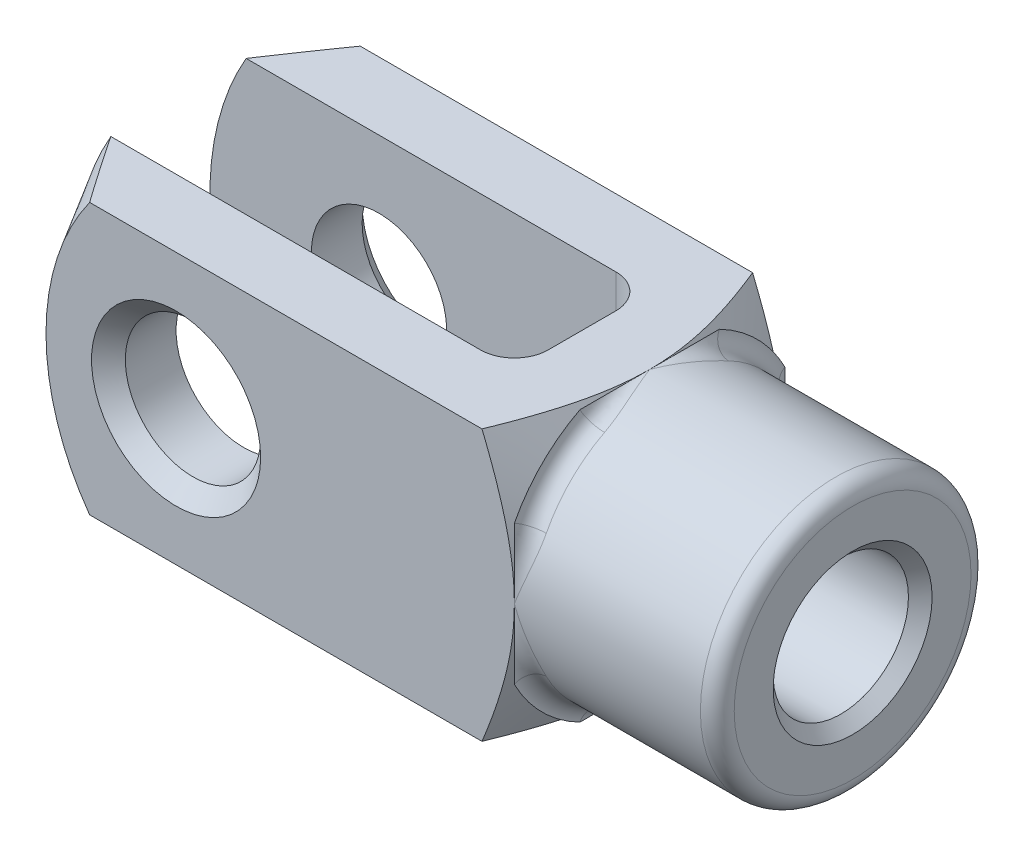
ISO-10303-21;
HEADER;
FILE_DESCRIPTION(('STEP AP214'),'2;1');
FILE_NAME('part.step','',(''),(''),'','','');
FILE_SCHEMA(('AUTOMOTIVE_DESIGN { 1 0 10303 214 1 1 1 1 }'));
ENDSEC;
DATA;
#1=APPLICATION_CONTEXT('core data for automotive mechanical design processes');
#2=APPLICATION_PROTOCOL_DEFINITION('international standard','automotive_design',2000,#1);
#3=PRODUCT_CONTEXT('',#1,'mechanical');
#4=PRODUCT('Part','Part','',(#3));
#5=PRODUCT_RELATED_PRODUCT_CATEGORY('part','',(#4));
#6=PRODUCT_DEFINITION_FORMATION('','',#4);
#7=PRODUCT_DEFINITION_CONTEXT('part definition',#1,'design');
#8=PRODUCT_DEFINITION('design','',#6,#7);
#9=PRODUCT_DEFINITION_SHAPE('','',#8);
#10=(LENGTH_UNIT() NAMED_UNIT(*) SI_UNIT(.MILLI.,.METRE.));
#11=(NAMED_UNIT(*) PLANE_ANGLE_UNIT() SI_UNIT($,.RADIAN.));
#12=(NAMED_UNIT(*) SI_UNIT($,.STERADIAN.) SOLID_ANGLE_UNIT());
#13=UNCERTAINTY_MEASURE_WITH_UNIT(LENGTH_MEASURE(1.E-05),#10,'distance_accuracy_value','');
#14=(GEOMETRIC_REPRESENTATION_CONTEXT(3) GLOBAL_UNCERTAINTY_ASSIGNED_CONTEXT((#13)) GLOBAL_UNIT_ASSIGNED_CONTEXT((#10,
#11,#12)) REPRESENTATION_CONTEXT('',''));
#15=CARTESIAN_POINT('',(0.,0.,0.));
#16=DIRECTION('',(0.,0.,1.));
#17=DIRECTION('',(1.,0.,0.));
#18=AXIS2_PLACEMENT_3D('',#15,#16,#17);
#19=CARTESIAN_POINT('',(-9.00000000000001,-4.,-0.99999999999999));
#20=DIRECTION('',(0.,-1.,0.));
#21=DIRECTION('',(0.,0.,-1.));
#22=AXIS2_PLACEMENT_3D('',#19,#20,#21);
#23=CYLINDRICAL_SURFACE('',#22,1.);
#24=DIRECTION('',(0.,1.,0.));
#25=VECTOR('',#24,1.);
#26=CARTESIAN_POINT('',(-8.00000000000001,-4.,-0.99999999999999));
#27=LINE('',#26,#25);
#28=CARTESIAN_POINT('',(-8.00000000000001,-1.73205080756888,-0.99999999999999));
#29=VERTEX_POINT('',#28);
#30=CARTESIAN_POINT('',(-8.00000000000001,-4.,-0.99999999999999));
#31=VERTEX_POINT('',#30);
#32=EDGE_CURVE('E616',#29,#31,#27,.F.);
#33=ORIENTED_EDGE('',*,*,#32,.F.);
#34=CARTESIAN_POINT('',(-8.00000000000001,-1.73205080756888,-0.99999999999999));
#35=CARTESIAN_POINT('',(-7.99999980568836,-1.71043880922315,-1.03745955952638));
#36=CARTESIAN_POINT('',(-8.002103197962,-1.68761503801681,-1.07416082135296));
#37=CARTESIAN_POINT('',(-8.01001340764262,-1.6399082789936,-1.14565643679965));
#38=CARTESIAN_POINT('',(-8.01581084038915,-1.61503064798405,-1.18045538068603));
#39=CARTESIAN_POINT('',(-8.03051235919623,-1.56380959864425,-1.24750155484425));
#40=CARTESIAN_POINT('',(-8.03937426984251,-1.53748996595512,-1.27977648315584));
#41=CARTESIAN_POINT('',(-8.05978521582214,-1.48334561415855,-1.34216028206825));
#42=CARTESIAN_POINT('',(-8.07133623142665,-1.45551979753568,-1.37226753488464));
#43=CARTESIAN_POINT('',(-8.11423276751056,-1.35935315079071,-1.47019811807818));
#44=CARTESIAN_POINT('',(-8.15092150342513,-1.2880193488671,-1.53282562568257));
#45=CARTESIAN_POINT('',(-8.233187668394,-1.14036373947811,-1.64568917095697));
#46=CARTESIAN_POINT('',(-8.27881758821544,-1.06401433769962,-1.69584785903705));
#47=CARTESIAN_POINT('',(-8.39566540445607,-0.876600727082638,-1.8020552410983));
#48=CARTESIAN_POINT('',(-8.46975815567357,-0.764009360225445,-1.85225042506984));
#49=CARTESIAN_POINT('',(-8.62397939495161,-0.535898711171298,-1.9306372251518));
#50=CARTESIAN_POINT('',(-8.70409993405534,-0.420383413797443,-1.95885728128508));
#51=CARTESIAN_POINT('',(-8.8546835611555,-0.205528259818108,-1.9919092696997));
#52=CARTESIAN_POINT('',(-8.92478225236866,-0.106374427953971,-1.99962510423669));
#53=CARTESIAN_POINT('',(-8.99655738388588,-0.0048685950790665,-1.99999555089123));
#54=CARTESIAN_POINT('',(-8.99827871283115,-0.00243426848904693,-1.99999999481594));
#55=CARTESIAN_POINT('',(-9.00000000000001,0.,-1.99999999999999));
#56=B_SPLINE_CURVE_WITH_KNOTS('',3,(#34,#35,#36,#37,#38,#39,#40,#41,#42,#43,#44,#45,#46,#47,#48,
#49,#50,#51,#52,#53,#54,#55),.UNSPECIFIED.,.F.,.F.,(4,2,2,2,2,2,2,2,2,2,4),(0.,
0.129592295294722,0.258856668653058,0.386408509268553,0.51405457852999,0.817592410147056,
1.1229686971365,1.55212503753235,1.98072504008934,2.34472916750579,2.35367344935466),.UNSPECIFIED.);
#57=CARTESIAN_POINT('',(-9.00000000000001,0.,-1.99999999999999));
#58=VERTEX_POINT('',#57);
#59=EDGE_CURVE('E672',#29,#58,#56,.T.);
#60=ORIENTED_EDGE('',*,*,#59,.T.);
#61=DIRECTION('',(0.,1.,0.));
#62=VECTOR('',#61,1.);
#63=CARTESIAN_POINT('',(-9.00000000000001,4.,-1.99999999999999));
#64=LINE('',#63,#62);
#65=CARTESIAN_POINT('',(-9.00000000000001,-4.,-1.99999999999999));
#66=VERTEX_POINT('',#65);
#67=EDGE_CURVE('E233',#66,#58,#64,.T.);
#68=ORIENTED_EDGE('',*,*,#67,.F.);
#69=CARTESIAN_POINT('',(-9.00000000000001,-4.,-0.99999999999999));
#70=DIRECTION('',(0.,-1.,0.));
#71=DIRECTION('',(0.,0.,-1.));
#72=AXIS2_PLACEMENT_3D('',#69,#70,#71);
#73=CIRCLE('',#72,1.);
#74=EDGE_CURVE('E248',#31,#66,#73,.F.);
#75=ORIENTED_EDGE('',*,*,#74,.F.);
#76=EDGE_LOOP('',(#33,#60,#68,#75));
#77=FACE_BOUND('',#76,.T.);
#78=ADVANCED_FACE('F39',(#77),#23,.F.);
#79=CARTESIAN_POINT('',(-8.00000000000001,-4.,-1.99999999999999));
#80=DIRECTION('',(1.,0.,0.));
#81=DIRECTION('',(0.,0.,-1.));
#82=AXIS2_PLACEMENT_3D('',#79,#80,#81);
#83=PLANE('',#82);
#84=CARTESIAN_POINT('',(-8.00000000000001,4.,-0.99999999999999));
#85=VERTEX_POINT('',#84);
#86=CARTESIAN_POINT('',(-8.00000000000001,1.73205080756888,-0.99999999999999));
#87=VERTEX_POINT('',#86);
#88=EDGE_CURVE('E613',#85,#87,#27,.F.);
#89=ORIENTED_EDGE('',*,*,#88,.T.);
#90=CARTESIAN_POINT('',(-8.00000000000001,0.,0.));
#91=DIRECTION('',(1.,0.,0.));
#92=DIRECTION('',(0.,0.,-1.));
#93=AXIS2_PLACEMENT_3D('',#90,#91,#92);
#94=CIRCLE('',#93,2.);
#95=CARTESIAN_POINT('',(-8.00000000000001,1.73205080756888,0.999999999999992));
#96=VERTEX_POINT('',#95);
#97=EDGE_CURVE('E799',#87,#96,#94,.T.);
#98=ORIENTED_EDGE('',*,*,#97,.T.);
#99=DIRECTION('',(0.,1.,0.));
#100=VECTOR('',#99,1.);
#101=CARTESIAN_POINT('',(-8.00000000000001,4.,0.999999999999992));
#102=LINE('',#101,#100);
#103=CARTESIAN_POINT('',(-8.00000000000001,4.,0.999999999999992));
#104=VERTEX_POINT('',#103);
#105=EDGE_CURVE('E210',#96,#104,#102,.T.);
#106=ORIENTED_EDGE('',*,*,#105,.T.);
#107=DIRECTION('',(0.,0.,-1.));
#108=VECTOR('',#107,1.);
#109=CARTESIAN_POINT('',(-8.00000000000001,4.,-1.99999999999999));
#110=LINE('',#109,#108);
#111=EDGE_CURVE('E711',#104,#85,#110,.T.);
#112=ORIENTED_EDGE('',*,*,#111,.T.);
#113=EDGE_LOOP('',(#89,#98,#106,#112));
#114=FACE_BOUND('',#113,.T.);
#115=ADVANCED_FACE('F696',(#114),#83,.F.);
#116=CARTESIAN_POINT('',(-9.00000000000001,-4.,0.999999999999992));
#117=DIRECTION('',(0.,-1.,0.));
#118=DIRECTION('',(0.,0.,-1.));
#119=AXIS2_PLACEMENT_3D('',#116,#117,#118);
#120=CYLINDRICAL_SURFACE('',#119,1.);
#121=ORIENTED_EDGE('',*,*,#105,.F.);
#122=CARTESIAN_POINT('',(-8.00000000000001,1.73205080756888,0.999999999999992));
#123=CARTESIAN_POINT('',(-7.99999980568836,1.71043880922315,1.03745955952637));
#124=CARTESIAN_POINT('',(-8.00210319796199,1.68761503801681,1.07416082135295));
#125=CARTESIAN_POINT('',(-8.01001340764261,1.63990827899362,1.14565643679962));
#126=CARTESIAN_POINT('',(-8.01581084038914,1.61503064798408,1.180455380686));
#127=CARTESIAN_POINT('',(-8.03051235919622,1.56380959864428,1.24750155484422));
#128=CARTESIAN_POINT('',(-8.0393742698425,1.53748996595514,1.27977648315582));
#129=CARTESIAN_POINT('',(-8.05978521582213,1.48334561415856,1.34216028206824));
#130=CARTESIAN_POINT('',(-8.07133623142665,1.45551979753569,1.37226753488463));
#131=CARTESIAN_POINT('',(-8.11423276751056,1.3593531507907,1.47019811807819));
#132=CARTESIAN_POINT('',(-8.15092150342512,1.28801934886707,1.53282562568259));
#133=CARTESIAN_POINT('',(-8.23318766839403,1.1403637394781,1.64568917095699));
#134=CARTESIAN_POINT('',(-8.2788175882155,1.06401433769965,1.69584785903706));
#135=CARTESIAN_POINT('',(-8.39566540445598,0.876600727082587,1.8020552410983));
#136=CARTESIAN_POINT('',(-8.46975815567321,0.764009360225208,1.85225042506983));
#137=CARTESIAN_POINT('',(-8.62397939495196,0.535898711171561,1.9306372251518));
#138=CARTESIAN_POINT('',(-8.70409993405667,0.420383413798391,1.95885728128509));
#139=CARTESIAN_POINT('',(-8.85468356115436,0.205528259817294,1.99190926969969));
#140=CARTESIAN_POINT('',(-8.9247822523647,0.106374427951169,1.99962510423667));
#141=CARTESIAN_POINT('',(-8.99655738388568,0.00486859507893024,1.99999555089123));
#142=CARTESIAN_POINT('',(-8.99827871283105,0.00243426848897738,1.99999999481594));
#143=CARTESIAN_POINT('',(-9.00000000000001,0.,2.));
#144=B_SPLINE_CURVE_WITH_KNOTS('',3,(#122,#123,#124,#125,#126,#127,#128,#129,#130,#131,#132,
#133,#134,#135,#136,#137,#138,#139,#140,#141,#142,#143),.UNSPECIFIED.,.F.,.F.,(4,2,2,2,2,2,2,2,
2,2,4),(0.,0.129592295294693,0.258856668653,0.386408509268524,0.51405457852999,0.81759241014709,
1.1229686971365,1.55212503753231,1.98072504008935,2.34472916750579,2.35367344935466),.UNSPECIFIED.);
#145=CARTESIAN_POINT('',(-9.00000000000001,0.,2.));
#146=VERTEX_POINT('',#145);
#147=EDGE_CURVE('E195',#96,#146,#144,.T.);
#148=ORIENTED_EDGE('',*,*,#147,.T.);
#149=DIRECTION('',(0.,1.,0.));
#150=VECTOR('',#149,1.);
#151=CARTESIAN_POINT('',(-9.00000000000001,-4.,1.99999999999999));
#152=LINE('',#151,#150);
#153=CARTESIAN_POINT('',(-9.00000000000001,4.,1.99999999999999));
#154=VERTEX_POINT('',#153);
#155=EDGE_CURVE('E209',#154,#146,#152,.F.);
#156=ORIENTED_EDGE('',*,*,#155,.F.);
#157=CARTESIAN_POINT('',(-9.00000000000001,4.,0.999999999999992));
#158=DIRECTION('',(0.,1.,0.));
#159=DIRECTION('',(0.,0.,1.));
#160=AXIS2_PLACEMENT_3D('',#157,#158,#159);
#161=CIRCLE('',#160,1.);
#162=EDGE_CURVE('E240',#104,#154,#161,.F.);
#163=ORIENTED_EDGE('',*,*,#162,.F.);
#164=EDGE_LOOP('',(#121,#148,#156,#163));
#165=FACE_BOUND('',#164,.T.);
#166=ADVANCED_FACE('F206',(#165),#120,.F.);
#167=CARTESIAN_POINT('',(-21.,-4.,-1.99999999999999));
#168=DIRECTION('',(0.,0.,-1.));
#169=DIRECTION('',(-1.,0.,0.));
#170=AXIS2_PLACEMENT_3D('',#167,#168,#169);
#171=PLANE('',#170);
#172=CARTESIAN_POINT('',(-16.,0.,-1.99999999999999));
#173=DIRECTION('',(0.,0.,-1.));
#174=DIRECTION('',(-1.,0.,0.));
#175=AXIS2_PLACEMENT_3D('',#172,#173,#174);
#176=CIRCLE('',#175,2.);
#177=CARTESIAN_POINT('',(-18.,0.,-1.99999999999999));
#178=VERTEX_POINT('',#177);
#179=EDGE_CURVE('E608',#178,#178,#176,.F.);
#180=ORIENTED_EDGE('',*,*,#179,.F.);
#181=EDGE_LOOP('',(#180));
#182=FACE_BOUND('',#181,.T.);
#183=CARTESIAN_POINT('',(-13.,0.,-1.99999999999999));
#184=DIRECTION('',(0.,0.,1.));
#185=DIRECTION('',(1.,0.,0.));
#186=AXIS2_PLACEMENT_3D('',#183,#184,#185);
#187=CIRCLE('',#186,8.);
#188=CARTESIAN_POINT('',(-19.9282032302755,4.,-1.99999999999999));
#189=VERTEX_POINT('',#188);
#190=CARTESIAN_POINT('',(-19.9282032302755,-4.,-1.99999999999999));
#191=VERTEX_POINT('',#190);
#192=EDGE_CURVE('E469',#189,#191,#187,.T.);
#193=ORIENTED_EDGE('',*,*,#192,.T.);
#194=DIRECTION('',(-1.,0.,0.));
#195=VECTOR('',#194,1.);
#196=CARTESIAN_POINT('',(-21.,-4.,-1.99999999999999));
#197=LINE('',#196,#195);
#198=EDGE_CURVE('E576',#66,#191,#197,.T.);
#199=ORIENTED_EDGE('',*,*,#198,.F.);
#200=ORIENTED_EDGE('',*,*,#67,.T.);
#201=CARTESIAN_POINT('',(-9.00000000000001,4.,-1.99999999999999));
#202=VERTEX_POINT('',#201);
#203=EDGE_CURVE('E229',#58,#202,#64,.T.);
#204=ORIENTED_EDGE('',*,*,#203,.T.);
#205=DIRECTION('',(-1.,0.,0.));
#206=VECTOR('',#205,1.);
#207=CARTESIAN_POINT('',(-21.,4.,-1.99999999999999));
#208=LINE('',#207,#206);
#209=EDGE_CURVE('E716',#202,#189,#208,.T.);
#210=ORIENTED_EDGE('',*,*,#209,.T.);
#211=EDGE_LOOP('',(#193,#199,#200,#204,#210));
#212=FACE_BOUND('',#211,.T.);
#213=ADVANCED_FACE('F708',(#182,#212),#171,.F.);
#214=CARTESIAN_POINT('',(-21.,-4.,1.99999999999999));
#215=DIRECTION('',(0.,0.,1.));
#216=DIRECTION('',(1.,0.,0.));
#217=AXIS2_PLACEMENT_3D('',#214,#215,#216);
#218=PLANE('',#217);
#219=CARTESIAN_POINT('',(-16.,0.,1.99999999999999));
#220=DIRECTION('',(0.,0.,1.));
#221=DIRECTION('',(1.,0.,0.));
#222=AXIS2_PLACEMENT_3D('',#219,#220,#221);
#223=CIRCLE('',#222,2.);
#224=CARTESIAN_POINT('',(-14.,0.,1.99999999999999));
#225=VERTEX_POINT('',#224);
#226=EDGE_CURVE('E605',#225,#225,#223,.F.);
#227=ORIENTED_EDGE('',*,*,#226,.F.);
#228=EDGE_LOOP('',(#227));
#229=FACE_BOUND('',#228,.T.);
#230=DIRECTION('',(1.,0.,0.));
#231=VECTOR('',#230,1.);
#232=CARTESIAN_POINT('',(-21.,-4.,1.99999999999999));
#233=LINE('',#232,#231);
#234=CARTESIAN_POINT('',(-19.9282032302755,-4.,1.99999999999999));
#235=VERTEX_POINT('',#234);
#236=CARTESIAN_POINT('',(-9.00000000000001,-4.,1.99999999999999));
#237=VERTEX_POINT('',#236);
#238=EDGE_CURVE('E710',#235,#237,#233,.T.);
#239=ORIENTED_EDGE('',*,*,#238,.F.);
#240=CARTESIAN_POINT('',(-13.,0.,1.99999999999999));
#241=DIRECTION('',(0.,0.,1.));
#242=DIRECTION('',(1.,0.,0.));
#243=AXIS2_PLACEMENT_3D('',#240,#241,#242);
#244=CIRCLE('',#243,8.);
#245=CARTESIAN_POINT('',(-19.9282032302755,4.,1.99999999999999));
#246=VERTEX_POINT('',#245);
#247=EDGE_CURVE('E667',#246,#235,#244,.T.);
#248=ORIENTED_EDGE('',*,*,#247,.F.);
#249=DIRECTION('',(1.,0.,0.));
#250=VECTOR('',#249,1.);
#251=CARTESIAN_POINT('',(-21.,4.,1.99999999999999));
#252=LINE('',#251,#250);
#253=EDGE_CURVE('E226',#246,#154,#252,.T.);
#254=ORIENTED_EDGE('',*,*,#253,.T.);
#255=ORIENTED_EDGE('',*,*,#155,.T.);
#256=EDGE_CURVE('E214',#146,#237,#152,.F.);
#257=ORIENTED_EDGE('',*,*,#256,.T.);
#258=EDGE_LOOP('',(#239,#248,#254,#255,#257));
#259=FACE_BOUND('',#258,.T.);
#260=ADVANCED_FACE('F223',(#229,#259),#218,.F.);
#261=CARTESIAN_POINT('',(-21.,-4.,4.));
#262=DIRECTION('',(0.,0.,1.));
#263=DIRECTION('',(1.,0.,0.));
#264=AXIS2_PLACEMENT_3D('',#261,#262,#263);
#265=PLANE('',#264);
#266=CARTESIAN_POINT('',(-16.,0.,4.));
#267=DIRECTION('',(0.,0.,1.));
#268=DIRECTION('',(1.,0.,0.));
#269=AXIS2_PLACEMENT_3D('',#266,#267,#268);
#270=CIRCLE('',#269,2.5);
#271=CARTESIAN_POINT('',(-13.5,0.,4.));
#272=VERTEX_POINT('',#271);
#273=EDGE_CURVE('E495',#272,#272,#270,.F.);
#274=ORIENTED_EDGE('',*,*,#273,.T.);
#275=EDGE_LOOP('',(#274));
#276=FACE_BOUND('',#275,.T.);
#277=DIRECTION('',(1.,0.,0.));
#278=VECTOR('',#277,1.);
#279=CARTESIAN_POINT('',(-21.,4.,4.));
#280=LINE('',#279,#278);
#281=CARTESIAN_POINT('',(-18.5550089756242,4.,4.));
#282=VERTEX_POINT('',#281);
#283=CARTESIAN_POINT('',(-6.95658524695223,4.00000000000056,4.));
#284=VERTEX_POINT('',#283);
#285=EDGE_CURVE('E595',#282,#284,#280,.T.);
#286=ORIENTED_EDGE('',*,*,#285,.F.);
#287=CARTESIAN_POINT('',(-13.,0.,4.));
#288=DIRECTION('',(0.,0.,1.));
#289=DIRECTION('',(1.,0.,0.));
#290=AXIS2_PLACEMENT_3D('',#287,#288,#289);
#291=CIRCLE('',#290,6.84529946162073);
#292=CARTESIAN_POINT('',(-18.5550089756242,-4.,4.));
#293=VERTEX_POINT('',#292);
#294=EDGE_CURVE('E63',#282,#293,#291,.T.);
#295=ORIENTED_EDGE('',*,*,#294,.T.);
#296=DIRECTION('',(1.,0.,0.));
#297=VECTOR('',#296,1.);
#298=CARTESIAN_POINT('',(-21.,-4.,4.));
#299=LINE('',#298,#297);
#300=CARTESIAN_POINT('',(-6.95658524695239,-4.,4.));
#301=VERTEX_POINT('',#300);
#302=EDGE_CURVE('E588',#293,#301,#299,.T.);
#303=ORIENTED_EDGE('',*,*,#302,.T.);
#304=CARTESIAN_POINT('',(-8.94234938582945,-8.16961741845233,4.));
#305=CARTESIAN_POINT('',(-8.84013861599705,-7.97247347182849,4.));
#306=CARTESIAN_POINT('',(-8.73846820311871,-7.77504679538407,4.));
#307=CARTESIAN_POINT('',(-8.53649463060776,-7.37948245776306,4.));
#308=CARTESIAN_POINT('',(-8.43619154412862,-7.18134475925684,4.));
#309=CARTESIAN_POINT('',(-8.23707690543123,-6.78388807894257,4.));
#310=CARTESIAN_POINT('',(-8.13826825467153,-6.58456764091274,4.));
#311=CARTESIAN_POINT('',(-7.94273059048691,-6.18491207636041,4.));
#312=CARTESIAN_POINT('',(-7.84600153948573,-5.98457696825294,4.));
#313=CARTESIAN_POINT('',(-7.64927747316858,-5.57029175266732,4.));
#314=CARTESIAN_POINT('',(-7.54944803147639,-5.3562627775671,4.));
#315=CARTESIAN_POINT('',(-7.35359812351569,-4.9264706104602,4.));
#316=CARTESIAN_POINT('',(-7.25757753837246,-4.71070747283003,4.));
#317=CARTESIAN_POINT('',(-7.07057782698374,-4.27709850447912,4.));
#318=CARTESIAN_POINT('',(-6.97959666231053,-4.05925355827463,4.));
#319=CARTESIAN_POINT('',(-6.80432812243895,-3.62089857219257,4.));
#320=CARTESIAN_POINT('',(-6.72003995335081,-3.40038885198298,4.));
#321=CARTESIAN_POINT('',(-6.54315501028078,-2.90795105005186,4.));
#322=CARTESIAN_POINT('',(-6.45271600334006,-2.63523575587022,4.));
#323=CARTESIAN_POINT('',(-6.29104025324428,-2.08399068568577,4.));
#324=CARTESIAN_POINT('',(-6.21980020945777,-1.80546191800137,4.));
#325=CARTESIAN_POINT('',(-6.13373644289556,-1.38680537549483,4.));
#326=CARTESIAN_POINT('',(-6.10869596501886,-1.24877095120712,4.));
#327=CARTESIAN_POINT('',(-6.06590008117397,-0.971589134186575,4.));
#328=CARTESIAN_POINT('',(-6.04814310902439,-0.832441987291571,4.));
#329=CARTESIAN_POINT('',(-6.0206494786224,-0.553427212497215,4.));
#330=CARTESIAN_POINT('',(-6.01090831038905,-0.413560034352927,4.));
#331=CARTESIAN_POINT('',(-5.99987791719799,-0.133491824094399,4.));
#332=CARTESIAN_POINT('',(-5.99858839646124,0.00670919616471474,4.));
#333=CARTESIAN_POINT('',(-6.00430563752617,0.276716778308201,4.));
#334=CARTESIAN_POINT('',(-6.01071472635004,0.406536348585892,4.));
#335=CARTESIAN_POINT('',(-6.03058035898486,0.665619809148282,4.));
#336=CARTESIAN_POINT('',(-6.04403688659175,0.794883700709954,4.));
#337=CARTESIAN_POINT('',(-6.09427714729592,1.18150322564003,4.));
#338=CARTESIAN_POINT('',(-6.14092964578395,1.43761724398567,4.));
#339=CARTESIAN_POINT('',(-6.22727900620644,1.82175416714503,4.));
#340=CARTESIAN_POINT('',(-6.25936078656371,1.95161053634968,4.));
#341=CARTESIAN_POINT('',(-6.32823306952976,2.21008121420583,4.));
#342=CARTESIAN_POINT('',(-6.36502361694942,2.33869551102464,4.));
#343=CARTESIAN_POINT('',(-6.44260140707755,2.59469437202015,4.));
#344=CARTESIAN_POINT('',(-6.48338847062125,2.7220789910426,4.));
#345=CARTESIAN_POINT('',(-6.5683395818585,2.97570465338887,4.));
#346=CARTESIAN_POINT('',(-6.61250345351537,3.10194575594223,4.));
#347=CARTESIAN_POINT('',(-6.75666765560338,3.49961626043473,4.));
#348=CARTESIAN_POINT('',(-6.86187369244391,3.76915804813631,4.));
#349=CARTESIAN_POINT('',(-7.08143955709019,4.30450751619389,4.));
#350=CARTESIAN_POINT('',(-7.19580186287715,4.57031416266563,4.));
#351=CARTESIAN_POINT('',(-7.43110140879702,5.09926397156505,4.));
#352=CARTESIAN_POINT('',(-7.5520442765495,5.36240461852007,4.));
#353=CARTESIAN_POINT('',(-7.79860587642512,5.88644022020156,4.));
#354=CARTESIAN_POINT('',(-7.92422411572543,6.14733540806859,4.));
#355=CARTESIAN_POINT('',(-8.1793250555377,6.66821131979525,4.));
#356=CARTESIAN_POINT('',(-8.3088183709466,6.92818683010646,4.));
#357=CARTESIAN_POINT('',(-8.57045607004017,7.44680454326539,4.));
#358=CARTESIAN_POINT('',(-8.70260051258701,7.70544671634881,4.));
#359=CARTESIAN_POINT('',(-8.9688688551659,8.22154496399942,4.));
#360=CARTESIAN_POINT('',(-9.10299173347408,8.47900156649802,4.));
#361=CARTESIAN_POINT('',(-9.37284852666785,8.99306960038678,4.));
#362=CARTESIAN_POINT('',(-9.5085824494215,9.24968102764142,4.));
#363=CARTESIAN_POINT('',(-9.87719730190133,9.94237342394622,4.));
#364=CARTESIAN_POINT('',(-10.1112943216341,10.3778069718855,4.));
#365=CARTESIAN_POINT('',(-10.5821300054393,11.2473201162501,4.));
#366=CARTESIAN_POINT('',(-10.8188690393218,11.681399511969,4.));
#367=CARTESIAN_POINT('',(-11.292890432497,12.5460299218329,4.));
#368=CARTESIAN_POINT('',(-11.5301619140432,12.9765869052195,4.));
#369=CARTESIAN_POINT('',(-12.0061126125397,13.8368333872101,4.));
#370=CARTESIAN_POINT('',(-12.2447916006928,14.2665230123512,4.));
#371=CARTESIAN_POINT('',(-12.4839744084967,14.6959299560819,4.));
#372=B_SPLINE_CURVE_WITH_KNOTS('',3,(#304,#305,#306,#307,#308,#309,#310,#311,#312,#313,#314,
#315,#316,#317,#318,#319,#320,#321,#322,#323,#324,#325,#326,#327,#328,#329,#330,#331,#332,#333,
#334,#335,#336,#337,#338,#339,#340,#341,#342,#343,#344,#345,#346,#347,#348,#349,#350,#351,#352,
#353,#354,#355,#356,#357,#358,#359,#360,#361,#362,#363,#364,#365,#366,#367,#368,#369,#370,#371),
.UNSPECIFIED.,.F.,.F.,(4,2,2,2,2,2,2,2,2,2,2,2,2,2,2,2,2,2,2,2,2,2,2,2,2,2,2,2,2,2,2,2,2,4),(0.,
0.666196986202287,1.3324294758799,1.99982211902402,2.66720269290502,3.37567174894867,
4.08411867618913,4.79227691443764,5.5003510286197,6.36186888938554,7.22323854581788,
7.64393916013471,8.06454926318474,8.48492255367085,8.90528113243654,9.29500972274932,
9.68473741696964,10.4644002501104,10.8656268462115,11.2668572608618,11.66806969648,
12.0692612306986,12.9370163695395,13.8050071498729,14.6737522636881,15.5424060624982,
16.4137083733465,17.2850300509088,18.1559164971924,19.0268071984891,20.5099092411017,
21.9932215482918,23.4680382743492,24.9426215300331),.UNSPECIFIED.);
#373=CARTESIAN_POINT('',(-6.,0.,4.));
#374=VERTEX_POINT('',#373);
#375=EDGE_CURVE('E541',#374,#301,#372,.F.);
#376=ORIENTED_EDGE('',*,*,#375,.F.);
#377=EDGE_CURVE('E548',#284,#374,#372,.F.);
#378=ORIENTED_EDGE('',*,*,#377,.F.);
#379=EDGE_LOOP('',(#286,#295,#303,#376,#378));
#380=FACE_BOUND('',#379,.T.);
#381=ADVANCED_FACE('F438',(#276,#380),#265,.T.);
#382=CARTESIAN_POINT('',(-21.,-4.,4.));
#383=DIRECTION('',(0.,-1.,0.));
#384=DIRECTION('',(0.,0.,-1.));
#385=AXIS2_PLACEMENT_3D('',#382,#383,#384);
#386=PLANE('',#385);
#387=ORIENTED_EDGE('',*,*,#198,.T.);
#388=CARTESIAN_POINT('',(-23.0929504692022,-4.,2.94792675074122));
#389=CARTESIAN_POINT('',(-22.8983216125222,-4.,2.63455642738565));
#390=CARTESIAN_POINT('',(-22.7031597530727,-4.,2.32151563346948));
#391=CARTESIAN_POINT('',(-22.311520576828,-4.,1.69624944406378));
#392=CARTESIAN_POINT('',(-22.1150432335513,-4.,1.38402406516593));
#393=CARTESIAN_POINT('',(-21.7202959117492,-4.,0.760185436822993));
#394=CARTESIAN_POINT('',(-21.5220240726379,-4.,0.448573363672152));
#395=CARTESIAN_POINT('',(-21.1235863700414,-4.,-0.173434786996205));
#396=CARTESIAN_POINT('',(-20.9234205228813,-4.,-0.483830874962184));
#397=CARTESIAN_POINT('',(-20.5123724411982,-4.,-1.11601031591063));
#398=CARTESIAN_POINT('',(-20.3013911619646,-4.,-1.43772935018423));
#399=CARTESIAN_POINT('',(-19.8762435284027,-4.,-2.07905590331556));
#400=CARTESIAN_POINT('',(-19.6620772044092,-4.,-2.39866344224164));
#401=CARTESIAN_POINT('',(-19.2297970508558,-4.,-3.03485600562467));
#402=CARTESIAN_POINT('',(-19.011686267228,-4.,-3.3514430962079));
#403=CARTESIAN_POINT('',(-18.5700661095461,-4.,-3.98082503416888));
#404=CARTESIAN_POINT('',(-18.3465570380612,-4.,-4.29362009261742));
#405=CARTESIAN_POINT('',(-18.0068038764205,-4.,-4.75730813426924));
#406=CARTESIAN_POINT('',(-17.8933497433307,-4.,-4.9102452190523));
#407=CARTESIAN_POINT('',(-17.6642826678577,-4.,-5.21449201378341));
#408=CARTESIAN_POINT('',(-17.5486697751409,-4.,-5.36580176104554));
#409=CARTESIAN_POINT('',(-17.3147031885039,-4.,-5.66663058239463));
#410=CARTESIAN_POINT('',(-17.1963458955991,-4.,-5.81614686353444));
#411=CARTESIAN_POINT('',(-16.9565116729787,-4.,-6.11265080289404));
#412=CARTESIAN_POINT('',(-16.8350349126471,-4.,-6.25963859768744));
#413=CARTESIAN_POINT('',(-16.5895358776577,-4.,-6.54886920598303));
#414=CARTESIAN_POINT('',(-16.4655531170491,-4.,-6.69114543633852));
#415=CARTESIAN_POINT('',(-16.2129134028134,-4.,-6.97157759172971));
#416=CARTESIAN_POINT('',(-16.0842552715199,-4.,-7.10973246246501));
#417=CARTESIAN_POINT('',(-15.8214132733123,-4.,-7.38010850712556));
#418=CARTESIAN_POINT('',(-15.6872425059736,-4.,-7.5123423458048));
#419=CARTESIAN_POINT('',(-15.4116202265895,-4.,-7.76893979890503));
#420=CARTESIAN_POINT('',(-15.270173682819,-4.,-7.8933086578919));
#421=CARTESIAN_POINT('',(-15.0484643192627,-4.,-8.07339062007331));
#422=CARTESIAN_POINT('',(-14.9715989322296,-4.,-8.13328381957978));
#423=CARTESIAN_POINT('',(-14.8150363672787,-4.,-8.24930338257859));
#424=CARTESIAN_POINT('',(-14.7353386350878,-4.,-8.30542900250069));
#425=CARTESIAN_POINT('',(-14.5728753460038,-4.,-8.41295698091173));
#426=CARTESIAN_POINT('',(-14.4901122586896,-4.,-8.46436303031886));
#427=CARTESIAN_POINT('',(-14.3212668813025,-4.,-8.56132770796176));
#428=CARTESIAN_POINT('',(-14.2351854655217,-4.,-8.60688786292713));
#429=CARTESIAN_POINT('',(-14.0116797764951,-4.,-8.71359992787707));
#430=CARTESIAN_POINT('',(-13.8717521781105,-4.,-8.76978895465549));
#431=CARTESIAN_POINT('',(-13.6565574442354,-4.,-8.83656070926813));
#432=CARTESIAN_POINT('',(-13.5839621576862,-4.,-8.85589648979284));
#433=CARTESIAN_POINT('',(-13.4373556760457,-4.,-8.88804853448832));
#434=CARTESIAN_POINT('',(-13.3633452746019,-4.,-8.90086834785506));
#435=CARTESIAN_POINT('',(-13.2136716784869,-4.,-8.91954218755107));
#436=CARTESIAN_POINT('',(-13.1379993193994,-4.,-8.92532352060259));
#437=CARTESIAN_POINT('',(-12.9864539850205,-4.,-8.92940634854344));
#438=CARTESIAN_POINT('',(-12.910581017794,-4.,-8.92770813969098));
#439=CARTESIAN_POINT('',(-12.759369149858,-4.,-8.91691100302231));
#440=CARTESIAN_POINT('',(-12.6840302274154,-4.,-8.90781237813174));
#441=CARTESIAN_POINT('',(-12.5345091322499,-4.,-8.88264290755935));
#442=CARTESIAN_POINT('',(-12.4603277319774,-4.,-8.86656759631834));
#443=CARTESIAN_POINT('',(-12.2131879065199,-4.,-8.80169319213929));
#444=CARTESIAN_POINT('',(-12.0439599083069,-4.,-8.738215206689));
#445=CARTESIAN_POINT('',(-11.7993020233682,-4.,-8.62410361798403));
#446=CARTESIAN_POINT('',(-11.7191216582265,-4.,-8.58281075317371));
#447=CARTESIAN_POINT('',(-11.5616394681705,-4.,-8.49501736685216));
#448=CARTESIAN_POINT('',(-11.4843373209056,-4.,-8.44851743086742));
#449=CARTESIAN_POINT('',(-11.3075554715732,-4.,-8.33532323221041));
#450=CARTESIAN_POINT('',(-11.2091222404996,-4.,-8.26700941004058));
#451=CARTESIAN_POINT('',(-11.0164757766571,-4.,-8.12463087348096));
#452=CARTESIAN_POINT('',(-10.9222646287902,-4.,-8.05056336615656));
#453=CARTESIAN_POINT('',(-10.7373734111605,-4.,-7.89785214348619));
#454=CARTESIAN_POINT('',(-10.646699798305,-4.,-7.8192006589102));
#455=CARTESIAN_POINT('',(-10.468525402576,-4.,-7.65837051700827));
#456=CARTESIAN_POINT('',(-10.3810252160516,-4.,-7.57619120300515));
#457=CARTESIAN_POINT('',(-10.1214846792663,-4.,-7.32438794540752));
#458=CARTESIAN_POINT('',(-9.95358306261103,-4.,-7.15050217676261));
#459=CARTESIAN_POINT('',(-9.62612406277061,-4.,-6.79547418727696));
#460=CARTESIAN_POINT('',(-9.46655862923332,-4.,-6.61433927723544));
#461=CARTESIAN_POINT('',(-9.19951142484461,-4.,-6.30070541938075));
#462=CARTESIAN_POINT('',(-9.09047764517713,-4.,-6.16952022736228));
#463=CARTESIAN_POINT('',(-8.8749762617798,-4.,-5.90501902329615));
#464=CARTESIAN_POINT('',(-8.76850916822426,-4.,-5.77170259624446));
#465=CARTESIAN_POINT('',(-8.55936285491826,-4.,-5.50542075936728));
#466=CARTESIAN_POINT('',(-8.45665059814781,-4.,-5.37248122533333));
#467=CARTESIAN_POINT('',(-8.25306566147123,-4.,-5.10526362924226));
#468=CARTESIAN_POINT('',(-8.15219243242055,-4.,-4.97098598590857));
#469=CARTESIAN_POINT('',(-8.05207324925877,-4.,-4.83615522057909));
#470=B_SPLINE_CURVE_WITH_KNOTS('',3,(#388,#389,#390,#391,#392,#393,#394,#395,#396,#397,#398,
#399,#400,#401,#402,#403,#404,#405,#406,#407,#408,#409,#410,#411,#412,#413,#414,#415,#416,#417,
#418,#419,#420,#421,#422,#423,#424,#425,#426,#427,#428,#429,#430,#431,#432,#433,#434,#435,#436,
#437,#438,#439,#440,#441,#442,#443,#444,#445,#446,#447,#448,#449,#450,#451,#452,#453,#454,#455,
#456,#457,#458,#459,#460,#461,#462,#463,#464,#465,#466,#467,#468,#469),.UNSPECIFIED.,.F.,.F.,(4,
2,2,2,2,2,2,2,2,2,2,2,2,2,2,2,2,2,2,2,2,2,2,2,2,2,2,2,2,2,2,2,2,2,2,2,2,2,2,2,4),(0.,
1.10667755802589,2.2133774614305,3.32139900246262,4.4294110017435,5.58358297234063,
6.73774395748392,7.8910488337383,9.04428921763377,9.6155486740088,10.1867950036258,
10.7588383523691,11.3308507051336,11.8969252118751,12.463143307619,13.0280859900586,
13.5926478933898,13.8848916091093,14.177192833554,14.4692634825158,14.7612576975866,
15.2117689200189,15.4369037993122,15.6619159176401,15.8892327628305,16.1165406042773,
16.343839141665,16.5712833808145,17.1099423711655,17.3804085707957,17.6508443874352,
18.0100232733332,18.3693776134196,18.7293597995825,19.0894092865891,19.8141420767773,
20.5381615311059,21.0498691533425,21.5616776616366,22.0656502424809,22.5694697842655),.UNSPECIFIED.);
#471=CARTESIAN_POINT('',(-18.5550089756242,-4.,-4.));
#472=VERTEX_POINT('',#471);
#473=EDGE_CURVE('E468',#191,#472,#470,.T.);
#474=ORIENTED_EDGE('',*,*,#473,.T.);
#475=DIRECTION('',(1.,0.,0.));
#476=VECTOR('',#475,1.);
#477=CARTESIAN_POINT('',(-21.,-4.,-4.));
#478=LINE('',#477,#476);
#479=CARTESIAN_POINT('',(-6.95658524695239,-4.,-4.));
#480=VERTEX_POINT('',#479);
#481=EDGE_CURVE('E573',#472,#480,#478,.T.);
#482=ORIENTED_EDGE('',*,*,#481,.T.);
#483=CARTESIAN_POINT('',(-8.94234938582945,-4.,-8.16961741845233));
#484=CARTESIAN_POINT('',(-8.84013861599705,-4.,-7.97247347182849));
#485=CARTESIAN_POINT('',(-8.73846820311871,-4.,-7.77504679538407));
#486=CARTESIAN_POINT('',(-8.53649463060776,-4.,-7.37948245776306));
#487=CARTESIAN_POINT('',(-8.43619154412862,-4.,-7.18134475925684));
#488=CARTESIAN_POINT('',(-8.23707690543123,-4.,-6.78388807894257));
#489=CARTESIAN_POINT('',(-8.13826825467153,-4.,-6.58456764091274));
#490=CARTESIAN_POINT('',(-7.94273059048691,-4.,-6.18491207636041));
#491=CARTESIAN_POINT('',(-7.84600153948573,-4.,-5.98457696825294));
#492=CARTESIAN_POINT('',(-7.64927747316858,-4.,-5.57029175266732));
#493=CARTESIAN_POINT('',(-7.54944803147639,-4.,-5.3562627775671));
#494=CARTESIAN_POINT('',(-7.35359812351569,-4.,-4.9264706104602));
#495=CARTESIAN_POINT('',(-7.25757753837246,-4.,-4.71070747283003));
#496=CARTESIAN_POINT('',(-7.07057782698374,-4.,-4.27709850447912));
#497=CARTESIAN_POINT('',(-6.97959666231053,-4.,-4.05925355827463));
#498=CARTESIAN_POINT('',(-6.80432812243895,-4.,-3.62089857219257));
#499=CARTESIAN_POINT('',(-6.72003995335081,-4.,-3.40038885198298));
#500=CARTESIAN_POINT('',(-6.54315501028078,-4.,-2.90795105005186));
#501=CARTESIAN_POINT('',(-6.45271600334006,-4.,-2.63523575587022));
#502=CARTESIAN_POINT('',(-6.29104025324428,-4.,-2.08399068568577));
#503=CARTESIAN_POINT('',(-6.21980020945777,-4.,-1.80546191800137));
#504=CARTESIAN_POINT('',(-6.13373644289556,-4.,-1.38680537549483));
#505=CARTESIAN_POINT('',(-6.10869596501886,-4.,-1.24877095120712));
#506=CARTESIAN_POINT('',(-6.06590008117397,-4.,-0.971589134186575));
#507=CARTESIAN_POINT('',(-6.04814310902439,-4.,-0.832441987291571));
#508=CARTESIAN_POINT('',(-6.0206494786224,-4.,-0.553427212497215));
#509=CARTESIAN_POINT('',(-6.01090831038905,-4.,-0.413560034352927));
#510=CARTESIAN_POINT('',(-5.99987791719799,-4.,-0.133491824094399));
#511=CARTESIAN_POINT('',(-5.99858839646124,-4.,0.00670919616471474));
#512=CARTESIAN_POINT('',(-6.00430563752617,-4.,0.276716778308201));
#513=CARTESIAN_POINT('',(-6.01071472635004,-4.,0.406536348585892));
#514=CARTESIAN_POINT('',(-6.03058035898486,-4.,0.665619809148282));
#515=CARTESIAN_POINT('',(-6.04403688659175,-4.,0.794883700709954));
#516=CARTESIAN_POINT('',(-6.09427714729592,-4.,1.18150322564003));
#517=CARTESIAN_POINT('',(-6.14092964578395,-4.,1.43761724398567));
#518=CARTESIAN_POINT('',(-6.22727900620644,-4.,1.82175416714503));
#519=CARTESIAN_POINT('',(-6.25936078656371,-4.,1.95161053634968));
#520=CARTESIAN_POINT('',(-6.32823306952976,-4.,2.21008121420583));
#521=CARTESIAN_POINT('',(-6.36502361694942,-4.,2.33869551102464));
#522=CARTESIAN_POINT('',(-6.44260140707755,-4.,2.59469437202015));
#523=CARTESIAN_POINT('',(-6.48338847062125,-4.,2.7220789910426));
#524=CARTESIAN_POINT('',(-6.5683395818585,-4.,2.97570465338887));
#525=CARTESIAN_POINT('',(-6.61250345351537,-4.,3.10194575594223));
#526=CARTESIAN_POINT('',(-6.75666765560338,-4.,3.49961626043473));
#527=CARTESIAN_POINT('',(-6.86187369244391,-4.,3.76915804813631));
#528=CARTESIAN_POINT('',(-7.08143955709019,-4.,4.30450751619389));
#529=CARTESIAN_POINT('',(-7.19580186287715,-4.,4.57031416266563));
#530=CARTESIAN_POINT('',(-7.43110140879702,-4.,5.09926397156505));
#531=CARTESIAN_POINT('',(-7.5520442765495,-4.,5.36240461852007));
#532=CARTESIAN_POINT('',(-7.79860587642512,-4.,5.88644022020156));
#533=CARTESIAN_POINT('',(-7.92422411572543,-4.,6.14733540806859));
#534=CARTESIAN_POINT('',(-8.1793250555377,-4.,6.66821131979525));
#535=CARTESIAN_POINT('',(-8.3088183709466,-4.,6.92818683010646));
#536=CARTESIAN_POINT('',(-8.57045607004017,-4.,7.44680454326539));
#537=CARTESIAN_POINT('',(-8.70260051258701,-4.,7.70544671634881));
#538=CARTESIAN_POINT('',(-8.9688688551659,-4.,8.22154496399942));
#539=CARTESIAN_POINT('',(-9.10299173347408,-4.,8.47900156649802));
#540=CARTESIAN_POINT('',(-9.37284852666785,-4.,8.99306960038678));
#541=CARTESIAN_POINT('',(-9.5085824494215,-4.,9.24968102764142));
#542=CARTESIAN_POINT('',(-9.87719730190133,-4.,9.94237342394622));
#543=CARTESIAN_POINT('',(-10.1112943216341,-4.,10.3778069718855));
#544=CARTESIAN_POINT('',(-10.5821300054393,-4.,11.2473201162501));
#545=CARTESIAN_POINT('',(-10.8188690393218,-4.,11.681399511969));
#546=CARTESIAN_POINT('',(-11.292890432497,-4.,12.5460299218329));
#547=CARTESIAN_POINT('',(-11.5301619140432,-4.,12.9765869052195));
#548=CARTESIAN_POINT('',(-12.0061126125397,-4.,13.8368333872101));
#549=CARTESIAN_POINT('',(-12.2447916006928,-4.,14.2665230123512));
#550=CARTESIAN_POINT('',(-12.4839744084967,-4.,14.6959299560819));
#551=B_SPLINE_CURVE_WITH_KNOTS('',3,(#483,#484,#485,#486,#487,#488,#489,#490,#491,#492,#493,
#494,#495,#496,#497,#498,#499,#500,#501,#502,#503,#504,#505,#506,#507,#508,#509,#510,#511,#512,
#513,#514,#515,#516,#517,#518,#519,#520,#521,#522,#523,#524,#525,#526,#527,#528,#529,#530,#531,
#532,#533,#534,#535,#536,#537,#538,#539,#540,#541,#542,#543,#544,#545,#546,#547,#548,#549,#550),
.UNSPECIFIED.,.F.,.F.,(4,2,2,2,2,2,2,2,2,2,2,2,2,2,2,2,2,2,2,2,2,2,2,2,2,2,2,2,2,2,2,2,2,4),(0.,
0.666196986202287,1.3324294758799,1.99982211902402,2.66720269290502,3.37567174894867,
4.08411867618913,4.79227691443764,5.5003510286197,6.36186888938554,7.22323854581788,
7.64393916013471,8.06454926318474,8.48492255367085,8.90528113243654,9.29500972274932,
9.68473741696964,10.4644002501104,10.8656268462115,11.2668572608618,11.66806969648,
12.0692612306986,12.9370163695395,13.8050071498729,14.6737522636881,15.5424060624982,
16.4137083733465,17.2850300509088,18.1559164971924,19.0268071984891,20.5099092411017,
21.9932215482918,23.4680382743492,24.9426215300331),.UNSPECIFIED.);
#552=CARTESIAN_POINT('',(-6.,-4.,0.));
#553=VERTEX_POINT('',#552);
#554=EDGE_CURVE('E650',#553,#480,#551,.F.);
#555=ORIENTED_EDGE('',*,*,#554,.F.);
#556=EDGE_CURVE('E452',#301,#553,#551,.F.);
#557=ORIENTED_EDGE('',*,*,#556,.F.);
#558=ORIENTED_EDGE('',*,*,#302,.F.);
#559=CARTESIAN_POINT('',(-8.05207324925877,-4.,4.83615522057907));
#560=CARTESIAN_POINT('',(-8.13342333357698,-4.,4.94572288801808));
#561=CARTESIAN_POINT('',(-8.21527761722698,-4.,5.05491708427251));
#562=CARTESIAN_POINT('',(-8.38015010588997,-4.,5.27243490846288));
#563=CARTESIAN_POINT('',(-8.46316839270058,-4.,5.38075847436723));
#564=CARTESIAN_POINT('',(-8.71447578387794,-4.,5.7045889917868));
#565=CARTESIAN_POINT('',(-8.88473597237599,-4.,5.91857436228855));
#566=CARTESIAN_POINT('',(-9.23384554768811,-4.,6.34301076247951));
#567=CARTESIAN_POINT('',(-9.41276275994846,-4.,6.55340659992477));
#568=CARTESIAN_POINT('',(-9.68822533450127,-4.,6.86257306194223));
#569=CARTESIAN_POINT('',(-9.78119711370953,-4.,6.96452642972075));
#570=CARTESIAN_POINT('',(-9.9699552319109,-4.,7.16578692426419));
#571=CARTESIAN_POINT('',(-10.0657412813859,-4.,7.26509432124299));
#572=CARTESIAN_POINT('',(-10.245300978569,-4.,7.44500576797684));
#573=CARTESIAN_POINT('',(-10.3285903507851,-4.,7.52609205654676));
#574=CARTESIAN_POINT('',(-10.4979253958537,-4.,7.68536280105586));
#575=CARTESIAN_POINT('',(-10.5839713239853,-4.,7.76354698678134));
#576=CARTESIAN_POINT('',(-10.7593003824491,-4.,7.91632000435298));
#577=CARTESIAN_POINT('',(-10.848585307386,-4.,7.99090678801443));
#578=CARTESIAN_POINT('',(-11.0308329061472,-4.,8.13545102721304));
#579=CARTESIAN_POINT('',(-11.1237951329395,-4.,8.20540904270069));
#580=CARTESIAN_POINT('',(-11.3005417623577,-4.,8.32993246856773));
#581=CARTESIAN_POINT('',(-11.3837709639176,-4.,8.38527712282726));
#582=CARTESIAN_POINT('',(-11.5536165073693,-4.,8.49046107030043));
#583=CARTESIAN_POINT('',(-11.640233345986,-4.,8.54029955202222));
#584=CARTESIAN_POINT('',(-11.9050553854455,-4.,8.67920212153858));
#585=CARTESIAN_POINT('',(-12.088980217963,-4.,8.75820846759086));
#586=CARTESIAN_POINT('',(-12.40964900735,-4.,8.85666978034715));
#587=CARTESIAN_POINT('',(-12.542993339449,-4.,8.88704568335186));
#588=CARTESIAN_POINT('',(-12.8129615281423,-4.,8.92453053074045));
#589=CARTESIAN_POINT('',(-12.9495824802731,-4.,8.93165936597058));
#590=CARTESIAN_POINT('',(-13.2219426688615,-4.,8.92156256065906));
#591=CARTESIAN_POINT('',(-13.357681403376,-4.,8.90432409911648));
#592=CARTESIAN_POINT('',(-13.6245025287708,-4.,8.84804271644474));
#593=CARTESIAN_POINT('',(-13.7555812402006,-4.,8.80898295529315));
#594=CARTESIAN_POINT('',(-13.9833446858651,-4.,8.72393377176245));
#595=CARTESIAN_POINT('',(-14.0813245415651,-4.,8.68128312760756));
#596=CARTESIAN_POINT('',(-14.2731654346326,-4.,8.58746979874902));
#597=CARTESIAN_POINT('',(-14.3670236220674,-4.,8.5363013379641));
#598=CARTESIAN_POINT('',(-14.551106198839,-4.,8.42705584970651));
#599=CARTESIAN_POINT('',(-14.6413138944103,-4.,8.36895103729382));
#600=CARTESIAN_POINT('',(-14.8180245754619,-4.,8.24746933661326));
#601=CARTESIAN_POINT('',(-14.9045289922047,-4.,8.18409451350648));
#602=CARTESIAN_POINT('',(-15.0752800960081,-4.,8.0523933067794));
#603=CARTESIAN_POINT('',(-15.1594885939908,-4.,7.98401772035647));
#604=CARTESIAN_POINT('',(-15.3250061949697,-4.,7.84383122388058));
#605=CARTESIAN_POINT('',(-15.406314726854,-4.,7.77201964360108));
#606=CARTESIAN_POINT('',(-15.6465934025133,-4.,7.55233767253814));
#607=CARTESIAN_POINT('',(-15.8017787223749,-4.,7.40032974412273));
#608=CARTESIAN_POINT('',(-16.1049834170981,-4.,7.08838616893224));
#609=CARTESIAN_POINT('',(-16.2529752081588,-4.,6.9284241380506));
#610=CARTESIAN_POINT('',(-16.5429270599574,-4.,6.60327597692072));
#611=CARTESIAN_POINT('',(-16.6848897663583,-4.,6.43809219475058));
#612=CARTESIAN_POINT('',(-16.9658693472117,-4.,6.10176213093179));
#613=CARTESIAN_POINT('',(-17.1048277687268,-4.,5.93056728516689));
#614=CARTESIAN_POINT('',(-17.3789410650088,-4.,5.58514186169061));
#615=CARTESIAN_POINT('',(-17.5140955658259,-4.,5.41091098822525));
#616=CARTESIAN_POINT('',(-17.7810247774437,-4.,5.06048516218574));
#617=CARTESIAN_POINT('',(-17.9128062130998,-4.,4.88429531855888));
#618=CARTESIAN_POINT('',(-18.1738439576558,-4.,4.53005274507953));
#619=CARTESIAN_POINT('',(-18.303100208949,-4.,4.35199997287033));
#620=CARTESIAN_POINT('',(-18.6422539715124,-4.,3.87901172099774));
#621=CARTESIAN_POINT('',(-18.8503648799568,-4.,3.58279586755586));
#622=CARTESIAN_POINT('',(-19.2623140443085,-4.,2.98740437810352));
#623=CARTESIAN_POINT('',(-19.4661521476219,-4.,2.68822863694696));
#624=CARTESIAN_POINT('',(-19.8706839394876,-4.,2.08736856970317));
#625=CARTESIAN_POINT('',(-20.0713746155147,-4.,1.78568221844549));
#626=CARTESIAN_POINT('',(-20.4701152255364,-4.,1.1805695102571));
#627=CARTESIAN_POINT('',(-20.668165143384,-4.,0.877143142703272));
#628=CARTESIAN_POINT('',(-21.0540263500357,-4.,0.281425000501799));
#629=CARTESIAN_POINT('',(-21.2419235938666,-4.,-0.010811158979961));
#630=CARTESIAN_POINT('',(-21.6160989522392,-4.,-0.596319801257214));
#631=CARTESIAN_POINT('',(-21.8023770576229,-4.,-0.889592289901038));
#632=CARTESIAN_POINT('',(-22.1733573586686,-4.,-1.47663649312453));
#633=CARTESIAN_POINT('',(-22.3580611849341,-4.,-1.77040717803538));
#634=CARTESIAN_POINT('',(-22.7263180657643,-4.,-2.3586631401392));
#635=CARTESIAN_POINT('',(-22.9098711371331,-4.,-2.65314840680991));
#636=CARTESIAN_POINT('',(-23.0929504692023,-4.,-2.94792675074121));
#637=B_SPLINE_CURVE_WITH_KNOTS('',3,(#559,#560,#561,#562,#563,#564,#565,#566,#567,#568,#569,
#570,#571,#572,#573,#574,#575,#576,#577,#578,#579,#580,#581,#582,#583,#584,#585,#586,#587,#588,
#589,#590,#591,#592,#593,#594,#595,#596,#597,#598,#599,#600,#601,#602,#603,#604,#605,#606,#607,
#608,#609,#610,#611,#612,#613,#614,#615,#616,#617,#618,#619,#620,#621,#622,#623,#624,#625,#626,
#627,#628,#629,#630,#631,#632,#633,#634,#635,#636),.UNSPECIFIED.,.F.,.F.,(4,2,2,2,2,2,2,2,2,2,2,
2,2,2,2,2,2,2,2,2,2,2,2,2,2,2,2,2,2,2,2,2,2,2,2,2,2,2,4),(0.,0.409396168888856,
0.818821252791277,1.63909308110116,2.46740405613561,2.8813005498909,3.29515461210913,
3.64382355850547,3.99252488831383,4.34142246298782,4.69027775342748,4.98992209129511,
5.28961053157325,5.886214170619,6.29478644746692,6.70300904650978,7.11144651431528,
7.52019961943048,7.84032595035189,8.16067025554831,8.48234377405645,8.80389182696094,
9.1291968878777,9.45456566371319,10.1058305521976,10.7594223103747,11.412724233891,
12.0741368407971,12.7356142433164,13.3956498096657,14.0557004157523,15.1416858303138,
16.2277099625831,17.3147169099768,18.4017305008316,19.4440130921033,20.4863015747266,
21.5273321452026,22.5683474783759),.UNSPECIFIED.);
#638=EDGE_CURVE('E460',#293,#235,#637,.T.);
#639=ORIENTED_EDGE('',*,*,#638,.T.);
#640=ORIENTED_EDGE('',*,*,#238,.T.);
#641=CARTESIAN_POINT('',(-9.00000000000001,-4.,0.999999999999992));
#642=DIRECTION('',(0.,-1.,0.));
#643=DIRECTION('',(0.,0.,-1.));
#644=AXIS2_PLACEMENT_3D('',#641,#642,#643);
#645=CIRCLE('',#644,1.);
#646=CARTESIAN_POINT('',(-8.00000000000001,-4.,0.999999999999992));
#647=VERTEX_POINT('',#646);
#648=EDGE_CURVE('E216',#237,#647,#645,.F.);
#649=ORIENTED_EDGE('',*,*,#648,.T.);
#650=DIRECTION('',(0.,0.,-1.));
#651=VECTOR('',#650,1.);
#652=CARTESIAN_POINT('',(-8.00000000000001,-4.,-1.99999999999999));
#653=LINE('',#652,#651);
#654=EDGE_CURVE('E609',#647,#31,#653,.T.);
#655=ORIENTED_EDGE('',*,*,#654,.T.);
#656=ORIENTED_EDGE('',*,*,#74,.T.);
#657=EDGE_LOOP('',(#387,#474,#482,#555,#557,#558,#639,#640,#649,#655,#656));
#658=FACE_BOUND('',#657,.T.);
#659=ADVANCED_FACE('F432',(#658),#386,.T.);
#660=CARTESIAN_POINT('',(-21.,-4.,-4.));
#661=DIRECTION('',(0.,0.,-1.));
#662=DIRECTION('',(-1.,0.,0.));
#663=AXIS2_PLACEMENT_3D('',#660,#661,#662);
#664=PLANE('',#663);
#665=CARTESIAN_POINT('',(-16.,0.,-4.));
#666=DIRECTION('',(0.,0.,-1.));
#667=DIRECTION('',(-1.,0.,0.));
#668=AXIS2_PLACEMENT_3D('',#665,#666,#667);
#669=CIRCLE('',#668,2.5);
#670=CARTESIAN_POINT('',(-18.5,0.,-4.));
#671=VERTEX_POINT('',#670);
#672=EDGE_CURVE('E415',#671,#671,#669,.F.);
#673=ORIENTED_EDGE('',*,*,#672,.T.);
#674=EDGE_LOOP('',(#673));
#675=FACE_BOUND('',#674,.T.);
#676=ORIENTED_EDGE('',*,*,#481,.F.);
#677=CARTESIAN_POINT('',(-13.,0.,-4.));
#678=DIRECTION('',(0.,0.,1.));
#679=DIRECTION('',(1.,0.,0.));
#680=AXIS2_PLACEMENT_3D('',#677,#678,#679);
#681=CIRCLE('',#680,6.84529946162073);
#682=CARTESIAN_POINT('',(-18.5550089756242,4.,-4.));
#683=VERTEX_POINT('',#682);
#684=EDGE_CURVE('E581',#683,#472,#681,.T.);
#685=ORIENTED_EDGE('',*,*,#684,.F.);
#686=DIRECTION('',(1.,0.,0.));
#687=VECTOR('',#686,1.);
#688=CARTESIAN_POINT('',(-21.,4.,-4.));
#689=LINE('',#688,#687);
#690=CARTESIAN_POINT('',(-6.95658524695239,4.,-4.));
#691=VERTEX_POINT('',#690);
#692=EDGE_CURVE('E587',#683,#691,#689,.T.);
#693=ORIENTED_EDGE('',*,*,#692,.T.);
#694=CARTESIAN_POINT('',(-8.94234938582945,-8.16961741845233,-4.));
#695=CARTESIAN_POINT('',(-8.84013861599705,-7.97247347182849,-4.));
#696=CARTESIAN_POINT('',(-8.73846820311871,-7.77504679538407,-4.));
#697=CARTESIAN_POINT('',(-8.53649463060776,-7.37948245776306,-4.));
#698=CARTESIAN_POINT('',(-8.43619154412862,-7.18134475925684,-4.));
#699=CARTESIAN_POINT('',(-8.23707690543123,-6.78388807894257,-4.));
#700=CARTESIAN_POINT('',(-8.13826825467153,-6.58456764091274,-4.));
#701=CARTESIAN_POINT('',(-7.94273059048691,-6.18491207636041,-4.));
#702=CARTESIAN_POINT('',(-7.84600153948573,-5.98457696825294,-4.));
#703=CARTESIAN_POINT('',(-7.64927747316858,-5.57029175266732,-4.));
#704=CARTESIAN_POINT('',(-7.54944803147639,-5.3562627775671,-4.));
#705=CARTESIAN_POINT('',(-7.35359812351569,-4.9264706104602,-4.));
#706=CARTESIAN_POINT('',(-7.25757753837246,-4.71070747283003,-4.));
#707=CARTESIAN_POINT('',(-7.07057782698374,-4.27709850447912,-4.));
#708=CARTESIAN_POINT('',(-6.97959666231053,-4.05925355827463,-4.));
#709=CARTESIAN_POINT('',(-6.80432812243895,-3.62089857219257,-4.));
#710=CARTESIAN_POINT('',(-6.72003995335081,-3.40038885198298,-4.));
#711=CARTESIAN_POINT('',(-6.54315501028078,-2.90795105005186,-4.));
#712=CARTESIAN_POINT('',(-6.45271600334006,-2.63523575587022,-4.));
#713=CARTESIAN_POINT('',(-6.29104025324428,-2.08399068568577,-4.));
#714=CARTESIAN_POINT('',(-6.21980020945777,-1.80546191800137,-4.));
#715=CARTESIAN_POINT('',(-6.13373644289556,-1.38680537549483,-4.));
#716=CARTESIAN_POINT('',(-6.10869596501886,-1.24877095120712,-4.));
#717=CARTESIAN_POINT('',(-6.06590008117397,-0.971589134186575,-4.));
#718=CARTESIAN_POINT('',(-6.04814310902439,-0.832441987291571,-4.));
#719=CARTESIAN_POINT('',(-6.0206494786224,-0.553427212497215,-4.));
#720=CARTESIAN_POINT('',(-6.01090831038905,-0.413560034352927,-4.));
#721=CARTESIAN_POINT('',(-5.99987791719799,-0.133491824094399,-4.));
#722=CARTESIAN_POINT('',(-5.99858839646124,0.00670919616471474,-4.));
#723=CARTESIAN_POINT('',(-6.00430563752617,0.276716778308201,-4.));
#724=CARTESIAN_POINT('',(-6.01071472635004,0.406536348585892,-4.));
#725=CARTESIAN_POINT('',(-6.03058035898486,0.665619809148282,-4.));
#726=CARTESIAN_POINT('',(-6.04403688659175,0.794883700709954,-4.));
#727=CARTESIAN_POINT('',(-6.09427714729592,1.18150322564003,-4.));
#728=CARTESIAN_POINT('',(-6.14092964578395,1.43761724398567,-4.));
#729=CARTESIAN_POINT('',(-6.22727900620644,1.82175416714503,-4.));
#730=CARTESIAN_POINT('',(-6.25936078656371,1.95161053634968,-4.));
#731=CARTESIAN_POINT('',(-6.32823306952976,2.21008121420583,-4.));
#732=CARTESIAN_POINT('',(-6.36502361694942,2.33869551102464,-4.));
#733=CARTESIAN_POINT('',(-6.44260140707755,2.59469437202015,-4.));
#734=CARTESIAN_POINT('',(-6.48338847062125,2.7220789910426,-4.));
#735=CARTESIAN_POINT('',(-6.5683395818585,2.97570465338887,-4.));
#736=CARTESIAN_POINT('',(-6.61250345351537,3.10194575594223,-4.));
#737=CARTESIAN_POINT('',(-6.75666765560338,3.49961626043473,-4.));
#738=CARTESIAN_POINT('',(-6.86187369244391,3.76915804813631,-4.));
#739=CARTESIAN_POINT('',(-7.08143955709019,4.30450751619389,-4.));
#740=CARTESIAN_POINT('',(-7.19580186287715,4.57031416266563,-4.));
#741=CARTESIAN_POINT('',(-7.43110140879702,5.09926397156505,-4.));
#742=CARTESIAN_POINT('',(-7.5520442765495,5.36240461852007,-4.));
#743=CARTESIAN_POINT('',(-7.79860587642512,5.88644022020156,-4.));
#744=CARTESIAN_POINT('',(-7.92422411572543,6.14733540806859,-4.));
#745=CARTESIAN_POINT('',(-8.1793250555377,6.66821131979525,-4.));
#746=CARTESIAN_POINT('',(-8.3088183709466,6.92818683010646,-4.));
#747=CARTESIAN_POINT('',(-8.57045607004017,7.44680454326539,-4.));
#748=CARTESIAN_POINT('',(-8.70260051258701,7.70544671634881,-4.));
#749=CARTESIAN_POINT('',(-8.9688688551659,8.22154496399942,-4.));
#750=CARTESIAN_POINT('',(-9.10299173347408,8.47900156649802,-4.));
#751=CARTESIAN_POINT('',(-9.37284852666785,8.99306960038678,-4.));
#752=CARTESIAN_POINT('',(-9.5085824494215,9.24968102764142,-4.));
#753=CARTESIAN_POINT('',(-9.87719730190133,9.94237342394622,-4.));
#754=CARTESIAN_POINT('',(-10.1112943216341,10.3778069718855,-4.));
#755=CARTESIAN_POINT('',(-10.5821300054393,11.2473201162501,-4.));
#756=CARTESIAN_POINT('',(-10.8188690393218,11.681399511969,-4.));
#757=CARTESIAN_POINT('',(-11.292890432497,12.5460299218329,-4.));
#758=CARTESIAN_POINT('',(-11.5301619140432,12.9765869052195,-4.));
#759=CARTESIAN_POINT('',(-12.0061126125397,13.8368333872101,-4.));
#760=CARTESIAN_POINT('',(-12.2447916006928,14.2665230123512,-4.));
#761=CARTESIAN_POINT('',(-12.4839744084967,14.6959299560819,-4.));
#762=B_SPLINE_CURVE_WITH_KNOTS('',3,(#694,#695,#696,#697,#698,#699,#700,#701,#702,#703,#704,
#705,#706,#707,#708,#709,#710,#711,#712,#713,#714,#715,#716,#717,#718,#719,#720,#721,#722,#723,
#724,#725,#726,#727,#728,#729,#730,#731,#732,#733,#734,#735,#736,#737,#738,#739,#740,#741,#742,
#743,#744,#745,#746,#747,#748,#749,#750,#751,#752,#753,#754,#755,#756,#757,#758,#759,#760,#761),
.UNSPECIFIED.,.F.,.F.,(4,2,2,2,2,2,2,2,2,2,2,2,2,2,2,2,2,2,2,2,2,2,2,2,2,2,2,2,2,2,2,2,2,4),(0.,
0.666196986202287,1.3324294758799,1.99982211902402,2.66720269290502,3.37567174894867,
4.08411867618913,4.79227691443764,5.5003510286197,6.36186888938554,7.22323854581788,
7.64393916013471,8.06454926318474,8.48492255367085,8.90528113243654,9.29500972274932,
9.68473741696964,10.4644002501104,10.8656268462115,11.2668572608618,11.66806969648,
12.0692612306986,12.9370163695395,13.8050071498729,14.6737522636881,15.5424060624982,
16.4137083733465,17.2850300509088,18.1559164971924,19.0268071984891,20.5099092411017,
21.9932215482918,23.4680382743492,24.9426215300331),.UNSPECIFIED.);
#763=CARTESIAN_POINT('',(-6.,0.,-4.));
#764=VERTEX_POINT('',#763);
#765=EDGE_CURVE('E523',#764,#691,#762,.T.);
#766=ORIENTED_EDGE('',*,*,#765,.F.);
#767=EDGE_CURVE('E585',#480,#764,#762,.T.);
#768=ORIENTED_EDGE('',*,*,#767,.F.);
#769=EDGE_LOOP('',(#676,#685,#693,#766,#768));
#770=FACE_BOUND('',#769,.T.);
#771=ADVANCED_FACE('F437',(#675,#770),#664,.T.);
#772=CARTESIAN_POINT('',(-21.,4.,4.));
#773=DIRECTION('',(0.,1.,0.));
#774=DIRECTION('',(0.,0.,1.));
#775=AXIS2_PLACEMENT_3D('',#772,#773,#774);
#776=PLANE('',#775);
#777=ORIENTED_EDGE('',*,*,#692,.F.);
#778=CARTESIAN_POINT('',(-8.05207324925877,4.,-4.83615522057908));
#779=CARTESIAN_POINT('',(-8.13342333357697,4.,-4.94572288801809));
#780=CARTESIAN_POINT('',(-8.21527761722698,4.,-5.05491708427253));
#781=CARTESIAN_POINT('',(-8.38015010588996,4.,-5.27243490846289));
#782=CARTESIAN_POINT('',(-8.46316839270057,4.,-5.38075847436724));
#783=CARTESIAN_POINT('',(-8.71447578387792,4.,-5.70458899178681));
#784=CARTESIAN_POINT('',(-8.88473597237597,4.,-5.91857436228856));
#785=CARTESIAN_POINT('',(-9.23384554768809,4.,-6.34301076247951));
#786=CARTESIAN_POINT('',(-9.41276275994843,4.,-6.55340659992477));
#787=CARTESIAN_POINT('',(-9.68822533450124,4.,-6.86257306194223));
#788=CARTESIAN_POINT('',(-9.78119711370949,4.,-6.96452642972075));
#789=CARTESIAN_POINT('',(-9.96995523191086,4.,-7.16578692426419));
#790=CARTESIAN_POINT('',(-10.0657412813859,4.,-7.26509432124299));
#791=CARTESIAN_POINT('',(-10.2453009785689,4.,-7.44500576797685));
#792=CARTESIAN_POINT('',(-10.3285903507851,4.,-7.52609205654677));
#793=CARTESIAN_POINT('',(-10.4979253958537,4.,-7.68536280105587));
#794=CARTESIAN_POINT('',(-10.5839713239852,4.,-7.76354698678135));
#795=CARTESIAN_POINT('',(-10.7593003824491,4.,-7.916320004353));
#796=CARTESIAN_POINT('',(-10.848585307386,4.,-7.99090678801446));
#797=CARTESIAN_POINT('',(-11.0308329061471,4.,-8.13545102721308));
#798=CARTESIAN_POINT('',(-11.1237951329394,4.,-8.20540904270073));
#799=CARTESIAN_POINT('',(-11.3005417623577,4.,-8.32993246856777));
#800=CARTESIAN_POINT('',(-11.3837709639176,4.,-8.3852771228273));
#801=CARTESIAN_POINT('',(-11.5536165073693,4.,-8.49046107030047));
#802=CARTESIAN_POINT('',(-11.640233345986,4.,-8.54029955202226));
#803=CARTESIAN_POINT('',(-11.9050553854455,4.,-8.67920212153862));
#804=CARTESIAN_POINT('',(-12.088980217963,4.,-8.7582084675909));
#805=CARTESIAN_POINT('',(-12.40964900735,4.,-8.8566697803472));
#806=CARTESIAN_POINT('',(-12.542993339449,4.,-8.88704568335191));
#807=CARTESIAN_POINT('',(-12.8129615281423,4.,-8.9245305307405));
#808=CARTESIAN_POINT('',(-12.9495824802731,4.,-8.93165936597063));
#809=CARTESIAN_POINT('',(-13.2219426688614,4.,-8.92156256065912));
#810=CARTESIAN_POINT('',(-13.3576814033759,4.,-8.90432409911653));
#811=CARTESIAN_POINT('',(-13.6245025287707,4.,-8.8480427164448));
#812=CARTESIAN_POINT('',(-13.7555812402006,4.,-8.80898295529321));
#813=CARTESIAN_POINT('',(-13.983344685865,4.,-8.72393377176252));
#814=CARTESIAN_POINT('',(-14.081324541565,4.,-8.68128312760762));
#815=CARTESIAN_POINT('',(-14.2731654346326,4.,-8.58746979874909));
#816=CARTESIAN_POINT('',(-14.3670236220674,4.,-8.53630133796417));
#817=CARTESIAN_POINT('',(-14.551106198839,4.,-8.42705584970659));
#818=CARTESIAN_POINT('',(-14.6413138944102,4.,-8.3689510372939));
#819=CARTESIAN_POINT('',(-14.8180245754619,4.,-8.24746933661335));
#820=CARTESIAN_POINT('',(-14.9045289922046,4.,-8.18409451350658));
#821=CARTESIAN_POINT('',(-15.075280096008,4.,-8.0523933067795));
#822=CARTESIAN_POINT('',(-15.1594885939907,4.,-7.98401772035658));
#823=CARTESIAN_POINT('',(-15.3250061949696,4.,-7.8438312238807));
#824=CARTESIAN_POINT('',(-15.4063147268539,4.,-7.7720196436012));
#825=CARTESIAN_POINT('',(-15.6465934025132,4.,-7.55233767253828));
#826=CARTESIAN_POINT('',(-15.8017787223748,4.,-7.40032974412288));
#827=CARTESIAN_POINT('',(-16.1049834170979,4.,-7.08838616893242));
#828=CARTESIAN_POINT('',(-16.2529752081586,4.,-6.9284241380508));
#829=CARTESIAN_POINT('',(-16.5429270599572,4.,-6.60327597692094));
#830=CARTESIAN_POINT('',(-16.6848897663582,4.,-6.43809219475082));
#831=CARTESIAN_POINT('',(-16.9658693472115,4.,-6.10176213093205));
#832=CARTESIAN_POINT('',(-17.1048277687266,4.,-5.93056728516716));
#833=CARTESIAN_POINT('',(-17.3789410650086,4.,-5.58514186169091));
#834=CARTESIAN_POINT('',(-17.5140955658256,4.,-5.41091098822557));
#835=CARTESIAN_POINT('',(-17.7810247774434,4.,-5.06048516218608));
#836=CARTESIAN_POINT('',(-17.9128062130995,4.,-4.88429531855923));
#837=CARTESIAN_POINT('',(-18.1738439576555,4.,-4.53005274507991));
#838=CARTESIAN_POINT('',(-18.3031002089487,4.,-4.35199997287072));
#839=CARTESIAN_POINT('',(-18.6422539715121,4.,-3.87901172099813));
#840=CARTESIAN_POINT('',(-18.8503648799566,4.,-3.58279586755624));
#841=CARTESIAN_POINT('',(-19.2623140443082,4.,-2.98740437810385));
#842=CARTESIAN_POINT('',(-19.4661521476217,4.,-2.68822863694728));
#843=CARTESIAN_POINT('',(-19.8706839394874,4.,-2.08736856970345));
#844=CARTESIAN_POINT('',(-20.0713746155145,4.,-1.78568221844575));
#845=CARTESIAN_POINT('',(-20.4701152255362,4.,-1.18056951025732));
#846=CARTESIAN_POINT('',(-20.6681651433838,4.,-0.877143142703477));
#847=CARTESIAN_POINT('',(-21.0540263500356,4.,-0.281425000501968));
#848=CARTESIAN_POINT('',(-21.2419235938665,4.,0.0108111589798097));
#849=CARTESIAN_POINT('',(-21.6160989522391,4.,0.596319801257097));
#850=CARTESIAN_POINT('',(-21.8023770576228,4.,0.889592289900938));
#851=CARTESIAN_POINT('',(-22.1733573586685,4.,1.47663649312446));
#852=CARTESIAN_POINT('',(-22.358061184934,4.,1.77040717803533));
#853=CARTESIAN_POINT('',(-22.7263180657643,4.,2.35866314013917));
#854=CARTESIAN_POINT('',(-22.9098711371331,4.,2.6531484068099));
#855=CARTESIAN_POINT('',(-23.0929504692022,4.,2.94792675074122));
#856=B_SPLINE_CURVE_WITH_KNOTS('',3,(#778,#779,#780,#781,#782,#783,#784,#785,#786,#787,#788,
#789,#790,#791,#792,#793,#794,#795,#796,#797,#798,#799,#800,#801,#802,#803,#804,#805,#806,#807,
#808,#809,#810,#811,#812,#813,#814,#815,#816,#817,#818,#819,#820,#821,#822,#823,#824,#825,#826,
#827,#828,#829,#830,#831,#832,#833,#834,#835,#836,#837,#838,#839,#840,#841,#842,#843,#844,#845,
#846,#847,#848,#849,#850,#851,#852,#853,#854,#855),.UNSPECIFIED.,.F.,.F.,(4,2,2,2,2,2,2,2,2,2,2,
2,2,2,2,2,2,2,2,2,2,2,2,2,2,2,2,2,2,2,2,2,2,2,2,2,2,2,4),(0.,0.409396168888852,
0.818821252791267,1.63909308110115,2.46740405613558,2.88130054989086,3.29515461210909,
3.64382355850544,3.99252488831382,4.34142246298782,4.69027775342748,4.98992209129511,
5.28961053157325,5.886214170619,6.29478644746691,6.70300904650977,7.11144651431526,
7.52019961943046,7.84032595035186,8.16067025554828,8.48234377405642,8.80389182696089,
9.12919688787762,9.45456566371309,10.1058305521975,10.7594223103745,11.4127242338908,
12.0741368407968,12.7356142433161,13.3956498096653,14.0557004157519,15.1416858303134,
16.2277099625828,17.3147169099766,18.4017305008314,19.4440130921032,20.4863015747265,
21.5273321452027,22.5683474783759),.UNSPECIFIED.);
#857=EDGE_CURVE('E494',#683,#189,#856,.T.);
#858=ORIENTED_EDGE('',*,*,#857,.T.);
#859=ORIENTED_EDGE('',*,*,#209,.F.);
#860=CARTESIAN_POINT('',(-9.00000000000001,4.,-0.99999999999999));
#861=DIRECTION('',(0.,1.,0.));
#862=DIRECTION('',(0.,0.,1.));
#863=AXIS2_PLACEMENT_3D('',#860,#861,#862);
#864=CIRCLE('',#863,1.);
#865=EDGE_CURVE('E245',#202,#85,#864,.F.);
#866=ORIENTED_EDGE('',*,*,#865,.T.);
#867=ORIENTED_EDGE('',*,*,#111,.F.);
#868=ORIENTED_EDGE('',*,*,#162,.T.);
#869=ORIENTED_EDGE('',*,*,#253,.F.);
#870=CARTESIAN_POINT('',(-23.0929504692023,4.,-2.94792675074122));
#871=CARTESIAN_POINT('',(-22.8983216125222,4.,-2.63455642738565));
#872=CARTESIAN_POINT('',(-22.7031597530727,4.,-2.32151563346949));
#873=CARTESIAN_POINT('',(-22.311520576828,4.,-1.6962494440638));
#874=CARTESIAN_POINT('',(-22.1150432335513,4.,-1.38402406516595));
#875=CARTESIAN_POINT('',(-21.7202959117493,4.,-0.760185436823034));
#876=CARTESIAN_POINT('',(-21.522024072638,4.,-0.448573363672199));
#877=CARTESIAN_POINT('',(-21.1235863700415,4.,0.173434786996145));
#878=CARTESIAN_POINT('',(-20.9234205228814,4.,0.48383087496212));
#879=CARTESIAN_POINT('',(-20.5123724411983,4.,1.11601031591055));
#880=CARTESIAN_POINT('',(-20.3013911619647,4.,1.43772935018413));
#881=CARTESIAN_POINT('',(-19.8762435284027,4.,2.07905590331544));
#882=CARTESIAN_POINT('',(-19.6620772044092,4.,2.39866344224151));
#883=CARTESIAN_POINT('',(-19.2297970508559,4.,3.03485600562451));
#884=CARTESIAN_POINT('',(-19.0116862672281,4.,3.35144309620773));
#885=CARTESIAN_POINT('',(-18.5700661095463,4.,3.98082503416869));
#886=CARTESIAN_POINT('',(-18.3465570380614,4.,4.29362009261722));
#887=CARTESIAN_POINT('',(-18.0068038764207,4.,4.75730813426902));
#888=CARTESIAN_POINT('',(-17.8933497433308,4.,4.91024521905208));
#889=CARTESIAN_POINT('',(-17.6642826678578,4.,5.21449201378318));
#890=CARTESIAN_POINT('',(-17.5486697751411,4.,5.3658017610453));
#891=CARTESIAN_POINT('',(-17.3147031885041,4.,5.66663058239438));
#892=CARTESIAN_POINT('',(-17.1963458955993,4.,5.81614686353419));
#893=CARTESIAN_POINT('',(-16.9565116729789,4.,6.11265080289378));
#894=CARTESIAN_POINT('',(-16.8350349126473,4.,6.25963859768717));
#895=CARTESIAN_POINT('',(-16.5895358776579,4.,6.54886920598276));
#896=CARTESIAN_POINT('',(-16.4655531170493,4.,6.69114543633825));
#897=CARTESIAN_POINT('',(-16.2129134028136,4.,6.97157759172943));
#898=CARTESIAN_POINT('',(-16.0842552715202,4.,7.10973246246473));
#899=CARTESIAN_POINT('',(-15.8214132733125,4.,7.38010850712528));
#900=CARTESIAN_POINT('',(-15.6872425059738,4.,7.51234234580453));
#901=CARTESIAN_POINT('',(-15.4116202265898,4.,7.76893979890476));
#902=CARTESIAN_POINT('',(-15.2701736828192,4.,7.89330865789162));
#903=CARTESIAN_POINT('',(-15.048464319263,4.,8.07339062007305));
#904=CARTESIAN_POINT('',(-14.9715989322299,4.,8.13328381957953));
#905=CARTESIAN_POINT('',(-14.815036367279,4.,8.24930338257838));
#906=CARTESIAN_POINT('',(-14.7353386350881,4.,8.30542900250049));
#907=CARTESIAN_POINT('',(-14.572875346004,4.,8.41295698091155));
#908=CARTESIAN_POINT('',(-14.4901122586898,4.,8.46436303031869));
#909=CARTESIAN_POINT('',(-14.3212668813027,4.,8.56132770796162));
#910=CARTESIAN_POINT('',(-14.2351854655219,4.,8.606887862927));
#911=CARTESIAN_POINT('',(-14.0116797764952,4.,8.71359992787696));
#912=CARTESIAN_POINT('',(-13.8717521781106,4.,8.76978895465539));
#913=CARTESIAN_POINT('',(-13.6565574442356,4.,8.83656070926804));
#914=CARTESIAN_POINT('',(-13.5839621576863,4.,8.85589648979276));
#915=CARTESIAN_POINT('',(-13.4373556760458,4.,8.88804853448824));
#916=CARTESIAN_POINT('',(-13.363345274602,4.,8.90086834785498));
#917=CARTESIAN_POINT('',(-13.213671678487,4.,8.91954218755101));
#918=CARTESIAN_POINT('',(-13.1379993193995,4.,8.92532352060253));
#919=CARTESIAN_POINT('',(-12.9864539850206,4.,8.92940634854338));
#920=CARTESIAN_POINT('',(-12.9105810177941,4.,8.92770813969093));
#921=CARTESIAN_POINT('',(-12.7593691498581,4.,8.91691100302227));
#922=CARTESIAN_POINT('',(-12.6840302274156,4.,8.9078123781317));
#923=CARTESIAN_POINT('',(-12.53450913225,4.,8.88264290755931));
#924=CARTESIAN_POINT('',(-12.4603277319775,4.,8.86656759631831));
#925=CARTESIAN_POINT('',(-12.21318790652,4.,8.80169319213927));
#926=CARTESIAN_POINT('',(-12.043959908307,4.,8.73821520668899));
#927=CARTESIAN_POINT('',(-11.7993020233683,4.,8.62410361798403));
#928=CARTESIAN_POINT('',(-11.7191216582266,4.,8.58281075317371));
#929=CARTESIAN_POINT('',(-11.5616394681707,4.,8.49501736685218));
#930=CARTESIAN_POINT('',(-11.4843373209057,4.,8.44851743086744));
#931=CARTESIAN_POINT('',(-11.3075554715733,4.,8.33532323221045));
#932=CARTESIAN_POINT('',(-11.2091222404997,4.,8.26700941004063));
#933=CARTESIAN_POINT('',(-11.0164757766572,4.,8.12463087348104));
#934=CARTESIAN_POINT('',(-10.9222646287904,4.,8.05056336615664));
#935=CARTESIAN_POINT('',(-10.7373734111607,4.,7.8978521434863));
#936=CARTESIAN_POINT('',(-10.6466997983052,4.,7.81920065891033));
#937=CARTESIAN_POINT('',(-10.4685254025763,4.,7.65837051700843));
#938=CARTESIAN_POINT('',(-10.3810252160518,4.,7.57619120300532));
#939=CARTESIAN_POINT('',(-10.1214846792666,4.,7.32438794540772));
#940=CARTESIAN_POINT('',(-9.95358306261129,4.,7.15050217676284));
#941=CARTESIAN_POINT('',(-9.6261240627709,4.,6.79547418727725));
#942=CARTESIAN_POINT('',(-9.46655862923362,4.,6.61433927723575));
#943=CARTESIAN_POINT('',(-9.1995114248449,4.,6.30070541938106));
#944=CARTESIAN_POINT('',(-9.09047764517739,4.,6.16952022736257));
#945=CARTESIAN_POINT('',(-8.87497626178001,4.,5.90501902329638));
#946=CARTESIAN_POINT('',(-8.76850916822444,4.,5.77170259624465));
#947=CARTESIAN_POINT('',(-8.55936285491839,4.,5.50542075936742));
#948=CARTESIAN_POINT('',(-8.45665059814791,4.,5.37248122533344));
#949=CARTESIAN_POINT('',(-8.25306566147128,4.,5.10526362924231));
#950=CARTESIAN_POINT('',(-8.15219243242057,4.,4.97098598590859));
#951=CARTESIAN_POINT('',(-8.05207324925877,4.,4.83615522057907));
#952=B_SPLINE_CURVE_WITH_KNOTS('',3,(#870,#871,#872,#873,#874,#875,#876,#877,#878,#879,#880,
#881,#882,#883,#884,#885,#886,#887,#888,#889,#890,#891,#892,#893,#894,#895,#896,#897,#898,#899,
#900,#901,#902,#903,#904,#905,#906,#907,#908,#909,#910,#911,#912,#913,#914,#915,#916,#917,#918,
#919,#920,#921,#922,#923,#924,#925,#926,#927,#928,#929,#930,#931,#932,#933,#934,#935,#936,#937,
#938,#939,#940,#941,#942,#943,#944,#945,#946,#947,#948,#949,#950,#951),.UNSPECIFIED.,.F.,.F.,(4,
2,2,2,2,2,2,2,2,2,2,2,2,2,2,2,2,2,2,2,2,2,2,2,2,2,2,2,2,2,2,2,2,2,2,2,2,2,2,2,4),(0.,
1.10667755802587,2.21337746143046,3.32139900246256,4.42941100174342,5.58358297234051,
6.73774395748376,7.89104883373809,9.04428921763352,9.61554867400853,10.1867950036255,
10.7588383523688,11.3308507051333,11.8969252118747,12.4631433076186,13.0280859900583,
13.5926478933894,13.884891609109,14.1771928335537,14.4692634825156,14.7612576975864,
15.2117689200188,15.4369037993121,15.6619159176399,15.8892327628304,16.1165406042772,
16.3438391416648,16.5712833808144,17.1099423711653,17.3804085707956,17.650844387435,
18.010023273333,18.3693776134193,18.7293597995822,19.0894092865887,19.8141420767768,
20.5381615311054,21.0498691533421,21.5616776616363,22.0656502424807,22.5694697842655),.UNSPECIFIED.);
#953=EDGE_CURVE('E487',#246,#282,#952,.T.);
#954=ORIENTED_EDGE('',*,*,#953,.T.);
#955=ORIENTED_EDGE('',*,*,#285,.T.);
#956=CARTESIAN_POINT('',(-8.94234938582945,4.,-8.16961741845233));
#957=CARTESIAN_POINT('',(-8.84013861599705,4.,-7.97247347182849));
#958=CARTESIAN_POINT('',(-8.73846820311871,4.,-7.77504679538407));
#959=CARTESIAN_POINT('',(-8.53649463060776,4.,-7.37948245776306));
#960=CARTESIAN_POINT('',(-8.43619154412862,4.,-7.18134475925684));
#961=CARTESIAN_POINT('',(-8.23707690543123,4.,-6.78388807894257));
#962=CARTESIAN_POINT('',(-8.13826825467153,4.,-6.58456764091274));
#963=CARTESIAN_POINT('',(-7.94273059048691,4.,-6.18491207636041));
#964=CARTESIAN_POINT('',(-7.84600153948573,4.,-5.98457696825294));
#965=CARTESIAN_POINT('',(-7.64927747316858,4.,-5.57029175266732));
#966=CARTESIAN_POINT('',(-7.54944803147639,4.,-5.3562627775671));
#967=CARTESIAN_POINT('',(-7.35359812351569,4.,-4.9264706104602));
#968=CARTESIAN_POINT('',(-7.25757753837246,4.,-4.71070747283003));
#969=CARTESIAN_POINT('',(-7.07057782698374,4.,-4.27709850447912));
#970=CARTESIAN_POINT('',(-6.97959666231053,4.,-4.05925355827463));
#971=CARTESIAN_POINT('',(-6.80432812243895,4.,-3.62089857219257));
#972=CARTESIAN_POINT('',(-6.72003995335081,4.,-3.40038885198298));
#973=CARTESIAN_POINT('',(-6.54315501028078,4.,-2.90795105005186));
#974=CARTESIAN_POINT('',(-6.45271600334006,4.,-2.63523575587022));
#975=CARTESIAN_POINT('',(-6.29104025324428,4.,-2.08399068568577));
#976=CARTESIAN_POINT('',(-6.21980020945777,4.,-1.80546191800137));
#977=CARTESIAN_POINT('',(-6.13373644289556,4.,-1.38680537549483));
#978=CARTESIAN_POINT('',(-6.10869596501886,4.,-1.24877095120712));
#979=CARTESIAN_POINT('',(-6.06590008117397,4.,-0.971589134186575));
#980=CARTESIAN_POINT('',(-6.04814310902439,4.,-0.832441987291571));
#981=CARTESIAN_POINT('',(-6.0206494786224,4.,-0.553427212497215));
#982=CARTESIAN_POINT('',(-6.01090831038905,4.,-0.413560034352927));
#983=CARTESIAN_POINT('',(-5.99987791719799,4.,-0.133491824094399));
#984=CARTESIAN_POINT('',(-5.99858839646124,4.,0.00670919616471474));
#985=CARTESIAN_POINT('',(-6.00430563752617,4.,0.276716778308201));
#986=CARTESIAN_POINT('',(-6.01071472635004,4.,0.406536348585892));
#987=CARTESIAN_POINT('',(-6.03058035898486,4.,0.665619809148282));
#988=CARTESIAN_POINT('',(-6.04403688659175,4.,0.794883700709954));
#989=CARTESIAN_POINT('',(-6.09427714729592,4.,1.18150322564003));
#990=CARTESIAN_POINT('',(-6.14092964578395,4.,1.43761724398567));
#991=CARTESIAN_POINT('',(-6.22727900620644,4.,1.82175416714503));
#992=CARTESIAN_POINT('',(-6.25936078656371,4.,1.95161053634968));
#993=CARTESIAN_POINT('',(-6.32823306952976,4.,2.21008121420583));
#994=CARTESIAN_POINT('',(-6.36502361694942,4.,2.33869551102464));
#995=CARTESIAN_POINT('',(-6.44260140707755,4.,2.59469437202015));
#996=CARTESIAN_POINT('',(-6.48338847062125,4.,2.7220789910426));
#997=CARTESIAN_POINT('',(-6.5683395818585,4.,2.97570465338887));
#998=CARTESIAN_POINT('',(-6.61250345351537,4.,3.10194575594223));
#999=CARTESIAN_POINT('',(-6.75666765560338,4.,3.49961626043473));
#1000=CARTESIAN_POINT('',(-6.86187369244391,4.,3.76915804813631));
#1001=CARTESIAN_POINT('',(-7.08143955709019,4.,4.30450751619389));
#1002=CARTESIAN_POINT('',(-7.19580186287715,4.,4.57031416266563));
#1003=CARTESIAN_POINT('',(-7.43110140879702,4.,5.09926397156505));
#1004=CARTESIAN_POINT('',(-7.5520442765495,4.,5.36240461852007));
#1005=CARTESIAN_POINT('',(-7.79860587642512,4.,5.88644022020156));
#1006=CARTESIAN_POINT('',(-7.92422411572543,4.,6.14733540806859));
#1007=CARTESIAN_POINT('',(-8.1793250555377,4.,6.66821131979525));
#1008=CARTESIAN_POINT('',(-8.3088183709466,4.,6.92818683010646));
#1009=CARTESIAN_POINT('',(-8.57045607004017,4.,7.44680454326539));
#1010=CARTESIAN_POINT('',(-8.70260051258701,4.,7.70544671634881));
#1011=CARTESIAN_POINT('',(-8.9688688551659,4.,8.22154496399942));
#1012=CARTESIAN_POINT('',(-9.10299173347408,4.,8.47900156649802));
#1013=CARTESIAN_POINT('',(-9.37284852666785,4.,8.99306960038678));
#1014=CARTESIAN_POINT('',(-9.5085824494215,4.,9.24968102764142));
#1015=CARTESIAN_POINT('',(-9.87719730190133,4.,9.94237342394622));
#1016=CARTESIAN_POINT('',(-10.1112943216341,4.,10.3778069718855));
#1017=CARTESIAN_POINT('',(-10.5821300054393,4.,11.2473201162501));
#1018=CARTESIAN_POINT('',(-10.8188690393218,4.,11.681399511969));
#1019=CARTESIAN_POINT('',(-11.292890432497,4.,12.5460299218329));
#1020=CARTESIAN_POINT('',(-11.5301619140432,4.,12.9765869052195));
#1021=CARTESIAN_POINT('',(-12.0061126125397,4.,13.8368333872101));
#1022=CARTESIAN_POINT('',(-12.2447916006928,4.,14.2665230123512));
#1023=CARTESIAN_POINT('',(-12.4839744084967,4.,14.6959299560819));
#1024=B_SPLINE_CURVE_WITH_KNOTS('',3,(#956,#957,#958,#959,#960,#961,#962,#963,#964,#965,#966,
#967,#968,#969,#970,#971,#972,#973,#974,#975,#976,#977,#978,#979,#980,#981,#982,#983,#984,#985,
#986,#987,#988,#989,#990,#991,#992,#993,#994,#995,#996,#997,#998,#999,#1000,#1001,#1002,#1003,
#1004,#1005,#1006,#1007,#1008,#1009,#1010,#1011,#1012,#1013,#1014,#1015,#1016,#1017,#1018,#1019,
#1020,#1021,#1022,#1023),.UNSPECIFIED.,.F.,.F.,(4,2,2,2,2,2,2,2,2,2,2,2,2,2,2,2,2,2,2,2,2,2,2,2,
2,2,2,2,2,2,2,2,2,4),(0.,0.666196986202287,1.3324294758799,1.99982211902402,2.66720269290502,
3.37567174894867,4.08411867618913,4.79227691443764,5.5003510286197,6.36186888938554,
7.22323854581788,7.64393916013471,8.06454926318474,8.48492255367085,8.90528113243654,
9.29500972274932,9.68473741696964,10.4644002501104,10.8656268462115,11.2668572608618,
11.66806969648,12.0692612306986,12.9370163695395,13.8050071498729,14.6737522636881,
15.5424060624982,16.4137083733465,17.2850300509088,18.1559164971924,19.0268071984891,
20.5099092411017,21.9932215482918,23.4680382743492,24.9426215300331),.UNSPECIFIED.);
#1025=CARTESIAN_POINT('',(-6.,4.,0.));
#1026=VERTEX_POINT('',#1025);
#1027=EDGE_CURVE('E515',#1026,#284,#1024,.T.);
#1028=ORIENTED_EDGE('',*,*,#1027,.F.);
#1029=EDGE_CURVE('E522',#691,#1026,#1024,.T.);
#1030=ORIENTED_EDGE('',*,*,#1029,.F.);
#1031=EDGE_LOOP('',(#777,#858,#859,#866,#867,#868,#869,#954,#955,#1028,#1030));
#1032=FACE_BOUND('',#1031,.T.);
#1033=ADVANCED_FACE('F272',(#1032),#776,.T.);
#1034=CARTESIAN_POINT('',(-6.,0.,0.));
#1035=DIRECTION('',(1.,0.,0.));
#1036=DIRECTION('',(0.,0.,-1.));
#1037=AXIS2_PLACEMENT_3D('',#1034,#1035,#1036);
#1038=CYLINDRICAL_SURFACE('',#1037,4.);
#1039=CARTESIAN_POINT('',(-0.5,0.,0.));
#1040=DIRECTION('',(1.,0.,0.));
#1041=DIRECTION('',(0.,0.,-1.));
#1042=AXIS2_PLACEMENT_3D('',#1039,#1040,#1041);
#1043=CIRCLE('',#1042,4.);
#1044=CARTESIAN_POINT('',(-0.5,0.,-4.));
#1045=VERTEX_POINT('',#1044);
#1046=EDGE_CURVE('E395',#1045,#1045,#1043,.F.);
#1047=ORIENTED_EDGE('',*,*,#1046,.T.);
#1048=EDGE_LOOP('',(#1047));
#1049=FACE_BOUND('',#1048,.T.);
#1050=CARTESIAN_POINT('',(-5.5,0.,0.));
#1051=DIRECTION('',(1.,0.,0.));
#1052=DIRECTION('',(0.,0.,-1.));
#1053=AXIS2_PLACEMENT_3D('',#1050,#1051,#1052);
#1054=CIRCLE('',#1053,4.);
#1055=CARTESIAN_POINT('',(-5.5,3.55555555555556,1.8324913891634));
#1056=VERTEX_POINT('',#1055);
#1057=CARTESIAN_POINT('',(-5.5,1.8324913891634,3.55555555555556));
#1058=VERTEX_POINT('',#1057);
#1059=EDGE_CURVE('E798',#1056,#1058,#1054,.T.);
#1060=ORIENTED_EDGE('',*,*,#1059,.T.);
#1061=CARTESIAN_POINT('',(-5.55071090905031,2.16952896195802,3.36052735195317));
#1062=CARTESIAN_POINT('',(-6.26235584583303,2.01117084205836,3.46276205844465));
#1063=CARTESIAN_POINT('',(-6.,2.44072008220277,4.));
#1064=CARTESIAN_POINT('',(-5.54007498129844,2.1394484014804,3.37995314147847));
#1065=CARTESIAN_POINT('',(-6.23033872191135,2.00690286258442,3.46358692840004));
#1066=CARTESIAN_POINT('',(-6.,2.40687945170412,4.));
#1067=CARTESIAN_POINT('',(-5.53143916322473,2.1087605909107,3.39918647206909));
#1068=CARTESIAN_POINT('',(-6.19963410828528,1.9976397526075,3.46792398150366));
#1069=CARTESIAN_POINT('',(-6.,2.37235566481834,4.));
#1070=CARTESIAN_POINT('',(-5.51758294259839,2.04649787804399,3.43702791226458));
#1071=CARTESIAN_POINT('',(-6.14328862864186,1.97166696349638,3.48137300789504));
#1072=CARTESIAN_POINT('',(-6.,2.3023101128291,4.));
#1073=CARTESIAN_POINT('',(-5.51235459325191,2.01492522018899,3.45563737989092));
#1074=CARTESIAN_POINT('',(-6.11732756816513,1.95527400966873,3.4902773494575));
#1075=CARTESIAN_POINT('',(-6.,2.26679087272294,4.));
#1076=CARTESIAN_POINT('',(-5.50092342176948,1.91977048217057,3.50995412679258));
#1077=CARTESIAN_POINT('',(-6.04870619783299,1.89984188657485,3.52023266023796));
#1078=CARTESIAN_POINT('',(-6.,2.15974179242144,4.));
#1079=CARTESIAN_POINT('',(-5.49879300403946,1.8551611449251,3.54453201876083));
#1080=CARTESIAN_POINT('',(-6.01041586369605,1.85296723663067,3.54540456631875));
#1081=CARTESIAN_POINT('',(-6.,2.08705628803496,4.));
#1082=CARTESIAN_POINT('',(-5.50228423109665,1.72854569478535,3.6078846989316));
#1083=CARTESIAN_POINT('',(-5.95154853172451,1.75172738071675,3.59648449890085));
#1084=CARTESIAN_POINT('',(-6.,1.94461390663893,4.));
#1085=CARTESIAN_POINT('',(-5.5074203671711,1.66663618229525,3.63688890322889));
#1086=CARTESIAN_POINT('',(-5.92906068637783,1.69835623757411,3.62223417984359));
#1087=CARTESIAN_POINT('',(-6.,1.87496570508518,4.));
#1088=CARTESIAN_POINT('',(-5.52292209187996,1.54184138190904,3.69152645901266));
#1089=CARTESIAN_POINT('',(-5.89434363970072,1.58616025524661,3.67285481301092));
#1090=CARTESIAN_POINT('',(-6.,1.73457155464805,4.));
#1091=CARTESIAN_POINT('',(-5.53329034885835,1.47895561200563,3.7171580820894));
#1092=CARTESIAN_POINT('',(-5.88153475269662,1.5271930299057,3.69793973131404));
#1093=CARTESIAN_POINT('',(-6.,1.66382506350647,4.));
#1094=CARTESIAN_POINT('',(-5.5705342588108,1.28839581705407,3.78926959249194));
#1095=CARTESIAN_POINT('',(-5.85508019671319,1.34787720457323,3.76859453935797));
#1096=CARTESIAN_POINT('',(-6.,1.44944529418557,4.));
#1097=CARTESIAN_POINT('',(-5.60348802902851,1.15968237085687,3.83053678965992));
#1098=CARTESIAN_POINT('',(-5.85080842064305,1.21753999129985,3.81321575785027));
#1099=CARTESIAN_POINT('',(-6.,1.3046426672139,4.));
#1100=CARTESIAN_POINT('',(-5.69023202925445,0.861579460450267,3.910018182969));
#1101=CARTESIAN_POINT('',(-5.86164764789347,0.915029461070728,3.89811073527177));
#1102=CARTESIAN_POINT('',(-6.,0.969276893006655,4.));
#1103=CARTESIAN_POINT('',(-5.74731135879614,0.691732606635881,3.94348083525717));
#1104=CARTESIAN_POINT('',(-5.88176240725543,0.734725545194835,3.93642694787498));
#1105=CARTESIAN_POINT('',(-6.,0.778199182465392,4.));
#1106=CARTESIAN_POINT('',(-5.86819522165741,0.35163930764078,3.9881883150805));
#1107=CARTESIAN_POINT('',(-5.93375193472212,0.376121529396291,3.98632694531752));
#1108=CARTESIAN_POINT('',(-6.,0.395594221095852,4.));
#1109=CARTESIAN_POINT('',(-5.93197785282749,0.181395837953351,3.99950326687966));
#1110=CARTESIAN_POINT('',(-5.96598146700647,0.192787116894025,3.99943468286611));
#1111=CARTESIAN_POINT('',(-6.,0.204070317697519,4.));
#1112=CARTESIAN_POINT('',(-5.99717160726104,0.00754239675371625,3.99999465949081));
#1113=CARTESIAN_POINT('',(-5.99858579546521,0.00801381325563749,3.99999413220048));
#1114=CARTESIAN_POINT('',(-6.,0.0084851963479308,4.));
#1115=CARTESIAN_POINT('',(-5.99858582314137,0.00377115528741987,3.99999999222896));
#1116=CARTESIAN_POINT('',(-5.99929290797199,0.00400684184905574,4.00000013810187));
#1117=CARTESIAN_POINT('',(-6.,0.00424254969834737,4.));
#1118=CARTESIAN_POINT('',(-6.,0.,4.));
#1119=CARTESIAN_POINT('',(-6.,0.,4.));
#1120=CARTESIAN_POINT('',(-6.,0.,4.));
#1121=(BOUNDED_SURFACE() B_SPLINE_SURFACE(3,2,((#1061,#1062,#1063),(#1064,#1065,#1066),(#1067,
#1068,#1069),(#1070,#1071,#1072),(#1073,#1074,#1075),(#1076,#1077,#1078),(#1079,#1080,#1081),
(#1082,#1083,#1084),(#1085,#1086,#1087),(#1088,#1089,#1090),(#1091,#1092,#1093),(#1094,#1095,
#1096),(#1097,#1098,#1099),(#1100,#1101,#1102),(#1103,#1104,#1105),(#1106,#1107,#1108),(#1109,
#1110,#1111),(#1112,#1113,#1114),(#1115,#1116,#1117),(#1118,#1119,#1120)),.UNSPECIFIED.,.F.,.F.,
.F.) B_SPLINE_SURFACE_WITH_KNOTS((4,2,2,2,2,2,2,2,2,4),(3,3),(0.,0.124834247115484,
0.249376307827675,0.496051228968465,0.727001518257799,0.958069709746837,1.42342989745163,
2.03041960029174,2.63548431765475,2.6489007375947),(0.,1.),
.UNSPECIFIED.) GEOMETRIC_REPRESENTATION_ITEM() RATIONAL_B_SPLINE_SURFACE(((1.,0.561844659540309,
1.),(1.,0.577230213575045,1.),(1.,0.592126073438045,1.),(1.,0.620911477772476,1.),(1.,
0.634803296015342,1.),(1.,0.674777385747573,1.),(1.,0.699454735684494,1.),(1.,0.74383741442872,
1.),(1.,0.763759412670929,1.),(1.,0.800813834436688,1.),(1.,0.817944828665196,1.),(1.,
0.8657077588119,1.),(1.,0.892416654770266,1.),(1.,0.943429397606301,1.),(1.,0.964527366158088,
1.),(1.,0.992635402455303,1.),(1.,0.999689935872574,1.),(1.,0.999996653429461,1.),(1.,
0.999999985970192,1.),(1.,1.,1.))) REPRESENTATION_ITEM('') SURFACE());
#1122=CARTESIAN_POINT('',(-5.55071090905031,2.16952896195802,3.36052735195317));
#1123=CARTESIAN_POINT('',(-5.54007498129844,2.1394484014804,3.37995314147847));
#1124=CARTESIAN_POINT('',(-5.53143916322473,2.1087605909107,3.39918647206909));
#1125=CARTESIAN_POINT('',(-5.51758294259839,2.04649787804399,3.43702791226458));
#1126=CARTESIAN_POINT('',(-5.51235459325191,2.01492522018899,3.45563737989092));
#1127=CARTESIAN_POINT('',(-5.50092342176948,1.91977048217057,3.50995412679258));
#1128=CARTESIAN_POINT('',(-5.49879300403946,1.8551611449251,3.54453201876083));
#1129=CARTESIAN_POINT('',(-5.50228423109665,1.72854569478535,3.6078846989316));
#1130=CARTESIAN_POINT('',(-5.5074203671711,1.66663618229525,3.63688890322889));
#1131=CARTESIAN_POINT('',(-5.52292209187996,1.54184138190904,3.69152645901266));
#1132=CARTESIAN_POINT('',(-5.53329034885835,1.47895561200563,3.7171580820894));
#1133=CARTESIAN_POINT('',(-5.5705342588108,1.28839581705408,3.78926959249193));
#1134=CARTESIAN_POINT('',(-5.60348802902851,1.15968237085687,3.83053678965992));
#1135=CARTESIAN_POINT('',(-5.69023202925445,0.861579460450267,3.910018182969));
#1136=CARTESIAN_POINT('',(-5.74731135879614,0.69173260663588,3.94348083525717));
#1137=CARTESIAN_POINT('',(-5.86819522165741,0.351639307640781,3.9881883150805));
#1138=CARTESIAN_POINT('',(-5.93197785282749,0.181395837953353,3.99950326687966));
#1139=CARTESIAN_POINT('',(-5.99717160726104,0.00754239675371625,3.99999465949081));
#1140=CARTESIAN_POINT('',(-5.99858582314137,0.00377115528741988,3.99999999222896));
#1141=CARTESIAN_POINT('',(-6.,0.,4.));
#1142=B_SPLINE_CURVE_WITH_KNOTS('',3,(#1122,#1123,#1124,#1125,#1126,#1127,#1128,#1129,#1130,
#1131,#1132,#1133,#1134,#1135,#1136,#1137,#1138,#1139,#1140,#1141),.UNSPECIFIED.,.F.,.F.,(4,2,2,
2,2,2,2,2,2,4),(0.,0.124834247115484,0.249376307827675,0.496051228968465,0.727001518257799,
0.958069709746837,1.42342989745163,2.03041960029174,2.63548431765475,2.6489007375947),.UNSPECIFIED.);
#1143=EDGE_CURVE('E380',#1058,#374,#1142,.T.);
#1144=ORIENTED_EDGE('',*,*,#1143,.T.);
#1145=CARTESIAN_POINT('',(-6.,-2.44072008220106,4.));
#1146=CARTESIAN_POINT('',(-6.26235584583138,-2.01117084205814,3.46276205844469));
#1147=CARTESIAN_POINT('',(-5.55071090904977,-2.1695289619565,3.36052735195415));
#1148=CARTESIAN_POINT('',(-6.,-2.40687945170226,4.));
#1149=CARTESIAN_POINT('',(-6.23033872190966,-2.00690286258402,3.46358692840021));
#1150=CARTESIAN_POINT('',(-5.54007498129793,-2.13944840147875,3.37995314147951));
#1151=CARTESIAN_POINT('',(-6.,-2.37235566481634,4.));
#1152=CARTESIAN_POINT('',(-6.19963410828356,-1.9976397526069,3.46792398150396));
#1153=CARTESIAN_POINT('',(-5.53143916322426,-2.10876059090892,3.3991864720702));
#1154=CARTESIAN_POINT('',(-6.,-2.30231011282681,4.));
#1155=CARTESIAN_POINT('',(-6.14328862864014,-1.9716669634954,3.48137300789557));
#1156=CARTESIAN_POINT('',(-5.51758294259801,-2.04649787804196,3.4370279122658));
#1157=CARTESIAN_POINT('',(-6.,-2.26679087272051,4.));
#1158=CARTESIAN_POINT('',(-6.11732756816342,-1.95527400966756,3.49027734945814));
#1159=CARTESIAN_POINT('',(-5.51235459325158,-2.01492522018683,3.45563737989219));
#1160=CARTESIAN_POINT('',(-6.,-2.15974179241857,4.));
#1161=CARTESIAN_POINT('',(-6.04870619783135,-1.89984188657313,3.52023266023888));
#1162=CARTESIAN_POINT('',(-5.50092342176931,-1.91977048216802,3.50995412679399));
#1163=CARTESIAN_POINT('',(-6.,-2.0870562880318,4.));
#1164=CARTESIAN_POINT('',(-6.01041586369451,-1.85296723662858,3.54540456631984));
#1165=CARTESIAN_POINT('',(-5.49879300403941,-1.85516114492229,3.5445320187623));
#1166=CARTESIAN_POINT('',(-6.,-1.9446139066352,4.));
#1167=CARTESIAN_POINT('',(-5.95154853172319,-1.75172738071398,3.5964844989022));
#1168=CARTESIAN_POINT('',(-5.50228423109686,-1.72854569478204,3.60788469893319));
#1169=CARTESIAN_POINT('',(-6.,-1.87496570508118,4.));
#1170=CARTESIAN_POINT('',(-5.92906068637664,-1.69835623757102,3.62223417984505));
#1171=CARTESIAN_POINT('',(-5.50742036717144,-1.6666361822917,3.63688890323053));
#1172=CARTESIAN_POINT('',(-6.,-1.73457155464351,4.));
#1173=CARTESIAN_POINT('',(-5.89434363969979,-1.58616025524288,3.67285481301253));
#1174=CARTESIAN_POINT('',(-5.52292209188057,-1.541841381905,3.69152645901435));
#1175=CARTESIAN_POINT('',(-6.,-1.66382506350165,4.));
#1176=CARTESIAN_POINT('',(-5.88153475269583,-1.52719302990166,3.69793973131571));
#1177=CARTESIAN_POINT('',(-5.5332903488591,-1.47895561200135,3.71715808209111));
#1178=CARTESIAN_POINT('',(-6.,-1.44944529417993,4.));
#1179=CARTESIAN_POINT('',(-5.85508019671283,-1.3478772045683,3.76859453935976));
#1180=CARTESIAN_POINT('',(-5.57053425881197,-1.28839581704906,3.78926959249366));
#1181=CARTESIAN_POINT('',(-6.,-1.30464266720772,4.));
#1182=CARTESIAN_POINT('',(-5.85080842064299,-1.21753999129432,3.81321575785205));
#1183=CARTESIAN_POINT('',(-5.60348802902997,-1.15968237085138,3.8305367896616));
#1184=CARTESIAN_POINT('',(-6.,-0.96927689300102,4.));
#1185=CARTESIAN_POINT('',(-5.86164764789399,-0.91502946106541,3.89811073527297));
#1186=CARTESIAN_POINT('',(-5.6902320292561,-0.861579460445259,3.91001818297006));
#1187=CARTESIAN_POINT('',(-6.,-0.778199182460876,4.));
#1188=CARTESIAN_POINT('',(-5.88176240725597,-0.734725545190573,3.93642694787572));
#1189=CARTESIAN_POINT('',(-5.74731135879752,-0.691732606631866,3.94348083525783));
#1190=CARTESIAN_POINT('',(-6.,-0.395594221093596,4.));
#1191=CARTESIAN_POINT('',(-5.93375193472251,-0.376121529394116,3.98632694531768));
#1192=CARTESIAN_POINT('',(-5.86819522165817,-0.351639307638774,3.98818831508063));
#1193=CARTESIAN_POINT('',(-6.,-0.204070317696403,4.));
#1194=CARTESIAN_POINT('',(-5.96598146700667,-0.19278711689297,3.99943468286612));
#1195=CARTESIAN_POINT('',(-5.93197785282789,-0.181395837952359,3.99950326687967));
#1196=CARTESIAN_POINT('',(-6.,-0.00848519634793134,4.));
#1197=CARTESIAN_POINT('',(-5.99858579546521,-0.00801381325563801,3.99999413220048));
#1198=CARTESIAN_POINT('',(-5.99717160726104,-0.00754239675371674,3.99999465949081));
#1199=CARTESIAN_POINT('',(-6.,-0.00424254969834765,4.));
#1200=CARTESIAN_POINT('',(-5.99929290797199,-0.00400684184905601,4.00000013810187));
#1201=CARTESIAN_POINT('',(-5.99858582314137,-0.00377115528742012,3.99999999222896));
#1202=CARTESIAN_POINT('',(-6.,0.,4.));
#1203=CARTESIAN_POINT('',(-6.,0.,4.));
#1204=CARTESIAN_POINT('',(-6.,0.,4.));
#1205=(BOUNDED_SURFACE() B_SPLINE_SURFACE(3,2,((#1145,#1146,#1147),(#1148,#1149,#1150),(#1151,
#1152,#1153),(#1154,#1155,#1156),(#1157,#1158,#1159),(#1160,#1161,#1162),(#1163,#1164,#1165),
(#1166,#1167,#1168),(#1169,#1170,#1171),(#1172,#1173,#1174),(#1175,#1176,#1177),(#1178,#1179,
#1180),(#1181,#1182,#1183),(#1184,#1185,#1186),(#1187,#1188,#1189),(#1190,#1191,#1192),(#1193,
#1194,#1195),(#1196,#1197,#1198),(#1199,#1200,#1201),(#1202,#1203,#1204)),.UNSPECIFIED.,.F.,.F.,
.F.) B_SPLINE_SURFACE_WITH_KNOTS((4,2,2,2,2,2,2,2,2,4),(3,3),(0.,0.124834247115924,
0.249376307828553,0.49605122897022,0.727001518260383,0.95806970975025,1.4234298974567,
2.03041960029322,2.63548431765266,2.64890073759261),(0.,1.),
.UNSPECIFIED.) GEOMETRIC_REPRESENTATION_ITEM() RATIONAL_B_SPLINE_SURFACE(((1.,0.561844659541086,
1.),(1.,0.57723021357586,1.),(1.,0.592126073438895,1.),(1.,0.620911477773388,1.),(1.,
0.63480329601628,1.),(1.,0.674777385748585,1.),(1.,0.699454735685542,1.),(1.,0.74383741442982,
1.),(1.,0.763759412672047,1.),(1.,0.800813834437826,1.),(1.,0.817944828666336,1.),(1.,
0.865707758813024,1.),(1.,0.892416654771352,1.),(1.,0.943429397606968,1.),(1.,0.964527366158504,
1.),(1.,0.992635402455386,1.),(1.,0.999689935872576,1.),(1.,0.999996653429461,1.),(1.,
0.999999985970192,1.),(1.,1.,1.))) REPRESENTATION_ITEM('') SURFACE());
#1206=CARTESIAN_POINT('',(-5.55071090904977,-2.1695289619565,3.36052735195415));
#1207=CARTESIAN_POINT('',(-5.54007498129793,-2.13944840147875,3.37995314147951));
#1208=CARTESIAN_POINT('',(-5.53143916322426,-2.10876059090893,3.3991864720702));
#1209=CARTESIAN_POINT('',(-5.51758294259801,-2.04649787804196,3.4370279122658));
#1210=CARTESIAN_POINT('',(-5.51235459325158,-2.01492522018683,3.45563737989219));
#1211=CARTESIAN_POINT('',(-5.50092342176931,-1.91977048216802,3.50995412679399));
#1212=CARTESIAN_POINT('',(-5.49879300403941,-1.85516114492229,3.5445320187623));
#1213=CARTESIAN_POINT('',(-5.50228423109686,-1.72854569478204,3.60788469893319));
#1214=CARTESIAN_POINT('',(-5.50742036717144,-1.6666361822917,3.63688890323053));
#1215=CARTESIAN_POINT('',(-5.52292209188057,-1.541841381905,3.69152645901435));
#1216=CARTESIAN_POINT('',(-5.5332903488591,-1.47895561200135,3.71715808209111));
#1217=CARTESIAN_POINT('',(-5.57053425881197,-1.28839581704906,3.78926959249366));
#1218=CARTESIAN_POINT('',(-5.60348802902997,-1.15968237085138,3.8305367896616));
#1219=CARTESIAN_POINT('',(-5.6902320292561,-0.861579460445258,3.91001818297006));
#1220=CARTESIAN_POINT('',(-5.74731135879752,-0.691732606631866,3.94348083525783));
#1221=CARTESIAN_POINT('',(-5.86819522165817,-0.351639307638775,3.98818831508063));
#1222=CARTESIAN_POINT('',(-5.93197785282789,-0.18139583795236,3.99950326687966));
#1223=CARTESIAN_POINT('',(-5.99717160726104,-0.00754239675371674,3.99999465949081));
#1224=CARTESIAN_POINT('',(-5.99858582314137,-0.00377115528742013,3.99999999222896));
#1225=CARTESIAN_POINT('',(-6.,0.,4.));
#1226=B_SPLINE_CURVE_WITH_KNOTS('',3,(#1206,#1207,#1208,#1209,#1210,#1211,#1212,#1213,#1214,
#1215,#1216,#1217,#1218,#1219,#1220,#1221,#1222,#1223,#1224,#1225),.UNSPECIFIED.,.F.,.F.,(4,2,2,
2,2,2,2,2,2,4),(0.,0.124834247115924,0.249376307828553,0.49605122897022,0.727001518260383,
0.95806970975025,1.4234298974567,2.03041960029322,2.63548431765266,2.64890073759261),.UNSPECIFIED.);
#1227=CARTESIAN_POINT('',(-5.5,-1.8324913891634,3.55555555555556));
#1228=VERTEX_POINT('',#1227);
#1229=EDGE_CURVE('E373',#374,#1228,#1226,.F.);
#1230=ORIENTED_EDGE('',*,*,#1229,.T.);
#1231=CARTESIAN_POINT('',(-5.5,0.,0.));
#1232=DIRECTION('',(1.,0.,0.));
#1233=DIRECTION('',(0.,0.,-1.));
#1234=AXIS2_PLACEMENT_3D('',#1231,#1232,#1233);
#1235=CIRCLE('',#1234,4.);
#1236=CARTESIAN_POINT('',(-5.5,-3.55555555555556,1.8324913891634));
#1237=VERTEX_POINT('',#1236);
#1238=EDGE_CURVE('E381',#1228,#1237,#1235,.T.);
#1239=ORIENTED_EDGE('',*,*,#1238,.T.);
#1240=CARTESIAN_POINT('',(-5.55071090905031,-3.36052735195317,2.16952896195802));
#1241=CARTESIAN_POINT('',(-6.26235584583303,-3.46276205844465,2.01117084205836));
#1242=CARTESIAN_POINT('',(-6.,-4.,2.44072008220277));
#1243=CARTESIAN_POINT('',(-5.54007498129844,-3.37995314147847,2.1394484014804));
#1244=CARTESIAN_POINT('',(-6.23033872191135,-3.46358692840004,2.00690286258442));
#1245=CARTESIAN_POINT('',(-6.,-4.,2.40687945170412));
#1246=CARTESIAN_POINT('',(-5.53143916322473,-3.39918647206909,2.1087605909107));
#1247=CARTESIAN_POINT('',(-6.19963410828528,-3.46792398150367,1.9976397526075));
#1248=CARTESIAN_POINT('',(-6.,-4.,2.37235566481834));
#1249=CARTESIAN_POINT('',(-5.51758294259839,-3.43702791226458,2.04649787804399));
#1250=CARTESIAN_POINT('',(-6.14328862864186,-3.48137300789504,1.97166696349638));
#1251=CARTESIAN_POINT('',(-6.,-4.,2.3023101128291));
#1252=CARTESIAN_POINT('',(-5.51235459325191,-3.45563737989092,2.01492522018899));
#1253=CARTESIAN_POINT('',(-6.11732756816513,-3.4902773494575,1.95527400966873));
#1254=CARTESIAN_POINT('',(-6.,-4.,2.26679087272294));
#1255=CARTESIAN_POINT('',(-5.50092342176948,-3.50995412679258,1.91977048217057));
#1256=CARTESIAN_POINT('',(-6.04870619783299,-3.52023266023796,1.89984188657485));
#1257=CARTESIAN_POINT('',(-6.,-4.,2.15974179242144));
#1258=CARTESIAN_POINT('',(-5.49879300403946,-3.54453201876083,1.8551611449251));
#1259=CARTESIAN_POINT('',(-6.01041586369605,-3.54540456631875,1.85296723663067));
#1260=CARTESIAN_POINT('',(-6.,-4.,2.08705628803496));
#1261=CARTESIAN_POINT('',(-5.50228423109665,-3.6078846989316,1.72854569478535));
#1262=CARTESIAN_POINT('',(-5.95154853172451,-3.59648449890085,1.75172738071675));
#1263=CARTESIAN_POINT('',(-6.,-4.,1.94461390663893));
#1264=CARTESIAN_POINT('',(-5.5074203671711,-3.63688890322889,1.66663618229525));
#1265=CARTESIAN_POINT('',(-5.92906068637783,-3.62223417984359,1.69835623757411));
#1266=CARTESIAN_POINT('',(-6.,-4.,1.87496570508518));
#1267=CARTESIAN_POINT('',(-5.52292209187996,-3.69152645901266,1.54184138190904));
#1268=CARTESIAN_POINT('',(-5.89434363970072,-3.67285481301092,1.58616025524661));
#1269=CARTESIAN_POINT('',(-6.,-4.,1.73457155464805));
#1270=CARTESIAN_POINT('',(-5.53329034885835,-3.7171580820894,1.47895561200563));
#1271=CARTESIAN_POINT('',(-5.88153475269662,-3.69793973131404,1.5271930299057));
#1272=CARTESIAN_POINT('',(-6.,-4.,1.66382506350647));
#1273=CARTESIAN_POINT('',(-5.5705342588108,-3.78926959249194,1.28839581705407));
#1274=CARTESIAN_POINT('',(-5.85508019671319,-3.76859453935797,1.34787720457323));
#1275=CARTESIAN_POINT('',(-6.,-4.,1.44944529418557));
#1276=CARTESIAN_POINT('',(-5.60348802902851,-3.83053678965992,1.15968237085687));
#1277=CARTESIAN_POINT('',(-5.85080842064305,-3.81321575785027,1.21753999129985));
#1278=CARTESIAN_POINT('',(-6.,-4.,1.3046426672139));
#1279=CARTESIAN_POINT('',(-5.69023202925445,-3.910018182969,0.861579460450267));
#1280=CARTESIAN_POINT('',(-5.86164764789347,-3.89811073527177,0.915029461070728));
#1281=CARTESIAN_POINT('',(-6.,-4.,0.969276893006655));
#1282=CARTESIAN_POINT('',(-5.74731135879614,-3.94348083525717,0.691732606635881));
#1283=CARTESIAN_POINT('',(-5.88176240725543,-3.93642694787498,0.734725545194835));
#1284=CARTESIAN_POINT('',(-6.,-4.,0.778199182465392));
#1285=CARTESIAN_POINT('',(-5.86819522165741,-3.9881883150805,0.35163930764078));
#1286=CARTESIAN_POINT('',(-5.93375193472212,-3.98632694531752,0.376121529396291));
#1287=CARTESIAN_POINT('',(-6.,-4.,0.395594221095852));
#1288=CARTESIAN_POINT('',(-5.93197785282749,-3.99950326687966,0.181395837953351));
#1289=CARTESIAN_POINT('',(-5.96598146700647,-3.99943468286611,0.192787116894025));
#1290=CARTESIAN_POINT('',(-6.,-4.,0.204070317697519));
#1291=CARTESIAN_POINT('',(-5.99717160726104,-3.99999465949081,0.00754239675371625));
#1292=CARTESIAN_POINT('',(-5.99858579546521,-3.99999413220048,0.00801381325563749));
#1293=CARTESIAN_POINT('',(-6.,-4.,0.0084851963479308));
#1294=CARTESIAN_POINT('',(-5.99858582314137,-3.99999999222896,0.00377115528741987));
#1295=CARTESIAN_POINT('',(-5.99929290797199,-4.00000013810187,0.00400684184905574));
#1296=CARTESIAN_POINT('',(-6.,-4.,0.00424254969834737));
#1297=CARTESIAN_POINT('',(-6.,-4.,0.));
#1298=CARTESIAN_POINT('',(-6.,-4.,0.));
#1299=CARTESIAN_POINT('',(-6.,-4.,0.));
#1300=(BOUNDED_SURFACE() B_SPLINE_SURFACE(3,2,((#1240,#1241,#1242),(#1243,#1244,#1245),(#1246,
#1247,#1248),(#1249,#1250,#1251),(#1252,#1253,#1254),(#1255,#1256,#1257),(#1258,#1259,#1260),
(#1261,#1262,#1263),(#1264,#1265,#1266),(#1267,#1268,#1269),(#1270,#1271,#1272),(#1273,#1274,
#1275),(#1276,#1277,#1278),(#1279,#1280,#1281),(#1282,#1283,#1284),(#1285,#1286,#1287),(#1288,
#1289,#1290),(#1291,#1292,#1293),(#1294,#1295,#1296),(#1297,#1298,#1299)),.UNSPECIFIED.,.F.,.F.,
.F.) B_SPLINE_SURFACE_WITH_KNOTS((4,2,2,2,2,2,2,2,2,4),(3,3),(0.,0.124834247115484,
0.249376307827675,0.496051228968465,0.727001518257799,0.958069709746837,1.42342989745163,
2.03041960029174,2.63548431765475,2.6489007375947),(0.,1.),
.UNSPECIFIED.) GEOMETRIC_REPRESENTATION_ITEM() RATIONAL_B_SPLINE_SURFACE(((1.,0.561844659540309,
1.),(1.,0.577230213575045,1.),(1.,0.592126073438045,1.),(1.,0.620911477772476,1.),(1.,
0.634803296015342,1.),(1.,0.674777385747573,1.),(1.,0.699454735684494,1.),(1.,0.74383741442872,
1.),(1.,0.763759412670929,1.),(1.,0.800813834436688,1.),(1.,0.817944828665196,1.),(1.,
0.8657077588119,1.),(1.,0.892416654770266,1.),(1.,0.943429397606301,1.),(1.,0.964527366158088,
1.),(1.,0.992635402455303,1.),(1.,0.999689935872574,1.),(1.,0.999996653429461,1.),(1.,
0.999999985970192,1.),(1.,1.,1.))) REPRESENTATION_ITEM('') SURFACE());
#1301=CARTESIAN_POINT('',(-5.55071090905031,-3.36052735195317,2.16952896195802));
#1302=CARTESIAN_POINT('',(-5.54007498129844,-3.37995314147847,2.1394484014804));
#1303=CARTESIAN_POINT('',(-5.53143916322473,-3.39918647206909,2.1087605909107));
#1304=CARTESIAN_POINT('',(-5.51758294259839,-3.43702791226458,2.04649787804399));
#1305=CARTESIAN_POINT('',(-5.51235459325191,-3.45563737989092,2.01492522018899));
#1306=CARTESIAN_POINT('',(-5.50092342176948,-3.50995412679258,1.91977048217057));
#1307=CARTESIAN_POINT('',(-5.49879300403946,-3.54453201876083,1.8551611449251));
#1308=CARTESIAN_POINT('',(-5.50228423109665,-3.6078846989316,1.72854569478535));
#1309=CARTESIAN_POINT('',(-5.5074203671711,-3.63688890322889,1.66663618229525));
#1310=CARTESIAN_POINT('',(-5.52292209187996,-3.69152645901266,1.54184138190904));
#1311=CARTESIAN_POINT('',(-5.53329034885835,-3.7171580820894,1.47895561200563));
#1312=CARTESIAN_POINT('',(-5.5705342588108,-3.78926959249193,1.28839581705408));
#1313=CARTESIAN_POINT('',(-5.60348802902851,-3.83053678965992,1.15968237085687));
#1314=CARTESIAN_POINT('',(-5.69023202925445,-3.910018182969,0.861579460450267));
#1315=CARTESIAN_POINT('',(-5.74731135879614,-3.94348083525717,0.69173260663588));
#1316=CARTESIAN_POINT('',(-5.86819522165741,-3.9881883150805,0.351639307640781));
#1317=CARTESIAN_POINT('',(-5.93197785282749,-3.99950326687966,0.181395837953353));
#1318=CARTESIAN_POINT('',(-5.99717160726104,-3.99999465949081,0.00754239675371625));
#1319=CARTESIAN_POINT('',(-5.99858582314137,-3.99999999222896,0.00377115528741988));
#1320=CARTESIAN_POINT('',(-6.,-4.,0.));
#1321=B_SPLINE_CURVE_WITH_KNOTS('',3,(#1301,#1302,#1303,#1304,#1305,#1306,#1307,#1308,#1309,
#1310,#1311,#1312,#1313,#1314,#1315,#1316,#1317,#1318,#1319,#1320),.UNSPECIFIED.,.F.,.F.,(4,2,2,
2,2,2,2,2,2,4),(0.,0.124834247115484,0.249376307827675,0.496051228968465,0.727001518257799,
0.958069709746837,1.42342989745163,2.03041960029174,2.63548431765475,2.6489007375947),.UNSPECIFIED.);
#1322=EDGE_CURVE('E366',#1237,#553,#1321,.T.);
#1323=ORIENTED_EDGE('',*,*,#1322,.T.);
#1324=CARTESIAN_POINT('',(-6.,-4.,-2.44072008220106));
#1325=CARTESIAN_POINT('',(-6.26235584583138,-3.46276205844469,-2.01117084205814));
#1326=CARTESIAN_POINT('',(-5.55071090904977,-3.36052735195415,-2.1695289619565));
#1327=CARTESIAN_POINT('',(-6.,-4.,-2.40687945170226));
#1328=CARTESIAN_POINT('',(-6.23033872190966,-3.46358692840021,-2.00690286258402));
#1329=CARTESIAN_POINT('',(-5.54007498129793,-3.37995314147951,-2.13944840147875));
#1330=CARTESIAN_POINT('',(-6.,-4.,-2.37235566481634));
#1331=CARTESIAN_POINT('',(-6.19963410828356,-3.46792398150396,-1.9976397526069));
#1332=CARTESIAN_POINT('',(-5.53143916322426,-3.3991864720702,-2.10876059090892));
#1333=CARTESIAN_POINT('',(-6.,-4.,-2.30231011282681));
#1334=CARTESIAN_POINT('',(-6.14328862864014,-3.48137300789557,-1.9716669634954));
#1335=CARTESIAN_POINT('',(-5.51758294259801,-3.4370279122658,-2.04649787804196));
#1336=CARTESIAN_POINT('',(-6.,-4.,-2.26679087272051));
#1337=CARTESIAN_POINT('',(-6.11732756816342,-3.49027734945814,-1.95527400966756));
#1338=CARTESIAN_POINT('',(-5.51235459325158,-3.45563737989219,-2.01492522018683));
#1339=CARTESIAN_POINT('',(-6.,-4.,-2.15974179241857));
#1340=CARTESIAN_POINT('',(-6.04870619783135,-3.52023266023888,-1.89984188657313));
#1341=CARTESIAN_POINT('',(-5.50092342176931,-3.50995412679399,-1.91977048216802));
#1342=CARTESIAN_POINT('',(-6.,-4.,-2.0870562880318));
#1343=CARTESIAN_POINT('',(-6.01041586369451,-3.54540456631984,-1.85296723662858));
#1344=CARTESIAN_POINT('',(-5.49879300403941,-3.5445320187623,-1.85516114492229));
#1345=CARTESIAN_POINT('',(-6.,-4.,-1.9446139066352));
#1346=CARTESIAN_POINT('',(-5.95154853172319,-3.5964844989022,-1.75172738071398));
#1347=CARTESIAN_POINT('',(-5.50228423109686,-3.60788469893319,-1.72854569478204));
#1348=CARTESIAN_POINT('',(-6.,-4.,-1.87496570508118));
#1349=CARTESIAN_POINT('',(-5.92906068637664,-3.62223417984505,-1.69835623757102));
#1350=CARTESIAN_POINT('',(-5.50742036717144,-3.63688890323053,-1.6666361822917));
#1351=CARTESIAN_POINT('',(-6.,-4.,-1.73457155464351));
#1352=CARTESIAN_POINT('',(-5.89434363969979,-3.67285481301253,-1.58616025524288));
#1353=CARTESIAN_POINT('',(-5.52292209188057,-3.69152645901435,-1.541841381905));
#1354=CARTESIAN_POINT('',(-6.,-4.,-1.66382506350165));
#1355=CARTESIAN_POINT('',(-5.88153475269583,-3.69793973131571,-1.52719302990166));
#1356=CARTESIAN_POINT('',(-5.5332903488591,-3.71715808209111,-1.47895561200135));
#1357=CARTESIAN_POINT('',(-6.,-4.,-1.44944529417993));
#1358=CARTESIAN_POINT('',(-5.85508019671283,-3.76859453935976,-1.3478772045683));
#1359=CARTESIAN_POINT('',(-5.57053425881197,-3.78926959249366,-1.28839581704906));
#1360=CARTESIAN_POINT('',(-6.,-4.,-1.30464266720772));
#1361=CARTESIAN_POINT('',(-5.85080842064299,-3.81321575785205,-1.21753999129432));
#1362=CARTESIAN_POINT('',(-5.60348802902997,-3.8305367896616,-1.15968237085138));
#1363=CARTESIAN_POINT('',(-6.,-4.,-0.96927689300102));
#1364=CARTESIAN_POINT('',(-5.86164764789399,-3.89811073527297,-0.91502946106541));
#1365=CARTESIAN_POINT('',(-5.6902320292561,-3.91001818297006,-0.861579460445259));
#1366=CARTESIAN_POINT('',(-6.,-4.,-0.778199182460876));
#1367=CARTESIAN_POINT('',(-5.88176240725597,-3.93642694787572,-0.734725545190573));
#1368=CARTESIAN_POINT('',(-5.74731135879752,-3.94348083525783,-0.691732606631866));
#1369=CARTESIAN_POINT('',(-6.,-4.,-0.395594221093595));
#1370=CARTESIAN_POINT('',(-5.93375193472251,-3.98632694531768,-0.376121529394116));
#1371=CARTESIAN_POINT('',(-5.86819522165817,-3.98818831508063,-0.351639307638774));
#1372=CARTESIAN_POINT('',(-6.,-4.,-0.204070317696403));
#1373=CARTESIAN_POINT('',(-5.96598146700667,-3.99943468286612,-0.19278711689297));
#1374=CARTESIAN_POINT('',(-5.93197785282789,-3.99950326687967,-0.181395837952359));
#1375=CARTESIAN_POINT('',(-6.,-4.,-0.00848519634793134));
#1376=CARTESIAN_POINT('',(-5.99858579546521,-3.99999413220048,-0.00801381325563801));
#1377=CARTESIAN_POINT('',(-5.99717160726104,-3.99999465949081,-0.00754239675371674));
#1378=CARTESIAN_POINT('',(-6.,-4.,-0.00424254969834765));
#1379=CARTESIAN_POINT('',(-5.99929290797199,-4.00000013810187,-0.00400684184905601));
#1380=CARTESIAN_POINT('',(-5.99858582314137,-3.99999999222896,-0.00377115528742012));
#1381=CARTESIAN_POINT('',(-6.,-4.,0.));
#1382=CARTESIAN_POINT('',(-6.,-4.,0.));
#1383=CARTESIAN_POINT('',(-6.,-4.,0.));
#1384=(BOUNDED_SURFACE() B_SPLINE_SURFACE(3,2,((#1324,#1325,#1326),(#1327,#1328,#1329),(#1330,
#1331,#1332),(#1333,#1334,#1335),(#1336,#1337,#1338),(#1339,#1340,#1341),(#1342,#1343,#1344),
(#1345,#1346,#1347),(#1348,#1349,#1350),(#1351,#1352,#1353),(#1354,#1355,#1356),(#1357,#1358,
#1359),(#1360,#1361,#1362),(#1363,#1364,#1365),(#1366,#1367,#1368),(#1369,#1370,#1371),(#1372,
#1373,#1374),(#1375,#1376,#1377),(#1378,#1379,#1380),(#1381,#1382,#1383)),.UNSPECIFIED.,.F.,.F.,
.F.) B_SPLINE_SURFACE_WITH_KNOTS((4,2,2,2,2,2,2,2,2,4),(3,3),(0.,0.124834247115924,
0.249376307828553,0.49605122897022,0.727001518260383,0.958069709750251,1.4234298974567,
2.03041960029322,2.63548431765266,2.64890073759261),(0.,1.),
.UNSPECIFIED.) GEOMETRIC_REPRESENTATION_ITEM() RATIONAL_B_SPLINE_SURFACE(((1.,0.561844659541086,
1.),(1.,0.57723021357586,1.),(1.,0.592126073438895,1.),(1.,0.620911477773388,1.),(1.,
0.63480329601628,1.),(1.,0.674777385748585,1.),(1.,0.699454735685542,1.),(1.,0.74383741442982,
1.),(1.,0.763759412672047,1.),(1.,0.800813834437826,1.),(1.,0.817944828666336,1.),(1.,
0.865707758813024,1.),(1.,0.892416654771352,1.),(1.,0.943429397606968,1.),(1.,0.964527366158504,
1.),(1.,0.992635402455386,1.),(1.,0.999689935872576,1.),(1.,0.999996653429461,1.),(1.,
0.999999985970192,1.),(1.,1.,1.))) REPRESENTATION_ITEM('') SURFACE());
#1385=CARTESIAN_POINT('',(-5.55071090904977,-3.36052735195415,-2.1695289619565));
#1386=CARTESIAN_POINT('',(-5.54007498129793,-3.37995314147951,-2.13944840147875));
#1387=CARTESIAN_POINT('',(-5.53143916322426,-3.3991864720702,-2.10876059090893));
#1388=CARTESIAN_POINT('',(-5.51758294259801,-3.4370279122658,-2.04649787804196));
#1389=CARTESIAN_POINT('',(-5.51235459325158,-3.45563737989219,-2.01492522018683));
#1390=CARTESIAN_POINT('',(-5.50092342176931,-3.50995412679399,-1.91977048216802));
#1391=CARTESIAN_POINT('',(-5.49879300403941,-3.5445320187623,-1.85516114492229));
#1392=CARTESIAN_POINT('',(-5.50228423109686,-3.60788469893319,-1.72854569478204));
#1393=CARTESIAN_POINT('',(-5.50742036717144,-3.63688890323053,-1.6666361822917));
#1394=CARTESIAN_POINT('',(-5.52292209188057,-3.69152645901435,-1.541841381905));
#1395=CARTESIAN_POINT('',(-5.5332903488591,-3.71715808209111,-1.47895561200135));
#1396=CARTESIAN_POINT('',(-5.57053425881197,-3.78926959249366,-1.28839581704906));
#1397=CARTESIAN_POINT('',(-5.60348802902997,-3.8305367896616,-1.15968237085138));
#1398=CARTESIAN_POINT('',(-5.6902320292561,-3.91001818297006,-0.861579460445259));
#1399=CARTESIAN_POINT('',(-5.74731135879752,-3.94348083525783,-0.691732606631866));
#1400=CARTESIAN_POINT('',(-5.86819522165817,-3.98818831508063,-0.351639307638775));
#1401=CARTESIAN_POINT('',(-5.93197785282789,-3.99950326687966,-0.18139583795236));
#1402=CARTESIAN_POINT('',(-5.99717160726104,-3.99999465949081,-0.00754239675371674));
#1403=CARTESIAN_POINT('',(-5.99858582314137,-3.99999999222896,-0.00377115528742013));
#1404=CARTESIAN_POINT('',(-6.,-4.,0.));
#1405=B_SPLINE_CURVE_WITH_KNOTS('',3,(#1385,#1386,#1387,#1388,#1389,#1390,#1391,#1392,#1393,
#1394,#1395,#1396,#1397,#1398,#1399,#1400,#1401,#1402,#1403,#1404),.UNSPECIFIED.,.F.,.F.,(4,2,2,
2,2,2,2,2,2,4),(0.,0.124834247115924,0.249376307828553,0.49605122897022,0.727001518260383,
0.958069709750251,1.4234298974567,2.03041960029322,2.63548431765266,2.64890073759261),.UNSPECIFIED.);
#1406=CARTESIAN_POINT('',(-5.5,-3.55555555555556,-1.8324913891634));
#1407=VERTEX_POINT('',#1406);
#1408=EDGE_CURVE('E359',#553,#1407,#1405,.F.);
#1409=ORIENTED_EDGE('',*,*,#1408,.T.);
#1410=CARTESIAN_POINT('',(-5.5,0.,0.));
#1411=DIRECTION('',(1.,0.,0.));
#1412=DIRECTION('',(0.,0.,-1.));
#1413=AXIS2_PLACEMENT_3D('',#1410,#1411,#1412);
#1414=CIRCLE('',#1413,4.);
#1415=CARTESIAN_POINT('',(-5.5,-1.8324913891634,-3.55555555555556));
#1416=VERTEX_POINT('',#1415);
#1417=EDGE_CURVE('E794',#1407,#1416,#1414,.T.);
#1418=ORIENTED_EDGE('',*,*,#1417,.T.);
#1419=CARTESIAN_POINT('',(-5.55071090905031,-2.16952896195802,-3.36052735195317));
#1420=CARTESIAN_POINT('',(-6.26235584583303,-2.01117084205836,-3.46276205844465));
#1421=CARTESIAN_POINT('',(-6.,-2.44072008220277,-4.));
#1422=CARTESIAN_POINT('',(-5.54007498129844,-2.1394484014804,-3.37995314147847));
#1423=CARTESIAN_POINT('',(-6.23033872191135,-2.00690286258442,-3.46358692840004));
#1424=CARTESIAN_POINT('',(-6.,-2.40687945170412,-4.));
#1425=CARTESIAN_POINT('',(-5.53143916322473,-2.1087605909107,-3.39918647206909));
#1426=CARTESIAN_POINT('',(-6.19963410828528,-1.9976397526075,-3.46792398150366));
#1427=CARTESIAN_POINT('',(-6.,-2.37235566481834,-4.));
#1428=CARTESIAN_POINT('',(-5.51758294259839,-2.04649787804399,-3.43702791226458));
#1429=CARTESIAN_POINT('',(-6.14328862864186,-1.97166696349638,-3.48137300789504));
#1430=CARTESIAN_POINT('',(-6.,-2.3023101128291,-4.));
#1431=CARTESIAN_POINT('',(-5.51235459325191,-2.01492522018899,-3.45563737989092));
#1432=CARTESIAN_POINT('',(-6.11732756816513,-1.95527400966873,-3.4902773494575));
#1433=CARTESIAN_POINT('',(-6.,-2.26679087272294,-4.));
#1434=CARTESIAN_POINT('',(-5.50092342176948,-1.91977048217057,-3.50995412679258));
#1435=CARTESIAN_POINT('',(-6.04870619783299,-1.89984188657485,-3.52023266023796));
#1436=CARTESIAN_POINT('',(-6.,-2.15974179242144,-4.));
#1437=CARTESIAN_POINT('',(-5.49879300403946,-1.8551611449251,-3.54453201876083));
#1438=CARTESIAN_POINT('',(-6.01041586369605,-1.85296723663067,-3.54540456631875));
#1439=CARTESIAN_POINT('',(-6.,-2.08705628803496,-4.));
#1440=CARTESIAN_POINT('',(-5.50228423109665,-1.72854569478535,-3.6078846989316));
#1441=CARTESIAN_POINT('',(-5.95154853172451,-1.75172738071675,-3.59648449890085));
#1442=CARTESIAN_POINT('',(-6.,-1.94461390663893,-4.));
#1443=CARTESIAN_POINT('',(-5.5074203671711,-1.66663618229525,-3.63688890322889));
#1444=CARTESIAN_POINT('',(-5.92906068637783,-1.69835623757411,-3.62223417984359));
#1445=CARTESIAN_POINT('',(-6.,-1.87496570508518,-4.));
#1446=CARTESIAN_POINT('',(-5.52292209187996,-1.54184138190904,-3.69152645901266));
#1447=CARTESIAN_POINT('',(-5.89434363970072,-1.58616025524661,-3.67285481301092));
#1448=CARTESIAN_POINT('',(-6.,-1.73457155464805,-4.));
#1449=CARTESIAN_POINT('',(-5.53329034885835,-1.47895561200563,-3.7171580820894));
#1450=CARTESIAN_POINT('',(-5.88153475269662,-1.5271930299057,-3.69793973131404));
#1451=CARTESIAN_POINT('',(-6.,-1.66382506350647,-4.));
#1452=CARTESIAN_POINT('',(-5.5705342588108,-1.28839581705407,-3.78926959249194));
#1453=CARTESIAN_POINT('',(-5.85508019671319,-1.34787720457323,-3.76859453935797));
#1454=CARTESIAN_POINT('',(-6.,-1.44944529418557,-4.));
#1455=CARTESIAN_POINT('',(-5.60348802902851,-1.15968237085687,-3.83053678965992));
#1456=CARTESIAN_POINT('',(-5.85080842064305,-1.21753999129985,-3.81321575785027));
#1457=CARTESIAN_POINT('',(-6.,-1.3046426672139,-4.));
#1458=CARTESIAN_POINT('',(-5.69023202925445,-0.861579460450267,-3.910018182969));
#1459=CARTESIAN_POINT('',(-5.86164764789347,-0.915029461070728,-3.89811073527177));
#1460=CARTESIAN_POINT('',(-6.,-0.969276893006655,-4.));
#1461=CARTESIAN_POINT('',(-5.74731135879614,-0.691732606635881,-3.94348083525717));
#1462=CARTESIAN_POINT('',(-5.88176240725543,-0.734725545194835,-3.93642694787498));
#1463=CARTESIAN_POINT('',(-6.,-0.778199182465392,-4.));
#1464=CARTESIAN_POINT('',(-5.86819522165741,-0.35163930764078,-3.9881883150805));
#1465=CARTESIAN_POINT('',(-5.93375193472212,-0.376121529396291,-3.98632694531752));
#1466=CARTESIAN_POINT('',(-6.,-0.395594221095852,-4.));
#1467=CARTESIAN_POINT('',(-5.93197785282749,-0.181395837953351,-3.99950326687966));
#1468=CARTESIAN_POINT('',(-5.96598146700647,-0.192787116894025,-3.99943468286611));
#1469=CARTESIAN_POINT('',(-6.,-0.204070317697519,-4.));
#1470=CARTESIAN_POINT('',(-5.99717160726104,-0.00754239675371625,-3.99999465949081));
#1471=CARTESIAN_POINT('',(-5.99858579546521,-0.00801381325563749,-3.99999413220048));
#1472=CARTESIAN_POINT('',(-6.,-0.0084851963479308,-4.));
#1473=CARTESIAN_POINT('',(-5.99858582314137,-0.00377115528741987,-3.99999999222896));
#1474=CARTESIAN_POINT('',(-5.99929290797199,-0.00400684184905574,-4.00000013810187));
#1475=CARTESIAN_POINT('',(-6.,-0.00424254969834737,-4.));
#1476=CARTESIAN_POINT('',(-6.,0.,-4.));
#1477=CARTESIAN_POINT('',(-6.,0.,-4.));
#1478=CARTESIAN_POINT('',(-6.,0.,-4.));
#1479=(BOUNDED_SURFACE() B_SPLINE_SURFACE(3,2,((#1419,#1420,#1421),(#1422,#1423,#1424),(#1425,
#1426,#1427),(#1428,#1429,#1430),(#1431,#1432,#1433),(#1434,#1435,#1436),(#1437,#1438,#1439),
(#1440,#1441,#1442),(#1443,#1444,#1445),(#1446,#1447,#1448),(#1449,#1450,#1451),(#1452,#1453,
#1454),(#1455,#1456,#1457),(#1458,#1459,#1460),(#1461,#1462,#1463),(#1464,#1465,#1466),(#1467,
#1468,#1469),(#1470,#1471,#1472),(#1473,#1474,#1475),(#1476,#1477,#1478)),.UNSPECIFIED.,.F.,.F.,
.F.) B_SPLINE_SURFACE_WITH_KNOTS((4,2,2,2,2,2,2,2,2,4),(3,3),(0.,0.124834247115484,
0.249376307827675,0.496051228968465,0.727001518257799,0.958069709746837,1.42342989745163,
2.03041960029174,2.63548431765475,2.6489007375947),(0.,1.),
.UNSPECIFIED.) GEOMETRIC_REPRESENTATION_ITEM() RATIONAL_B_SPLINE_SURFACE(((1.,0.561844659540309,
1.),(1.,0.577230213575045,1.),(1.,0.592126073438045,1.),(1.,0.620911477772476,1.),(1.,
0.634803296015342,1.),(1.,0.674777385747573,1.),(1.,0.699454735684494,1.),(1.,0.74383741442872,
1.),(1.,0.763759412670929,1.),(1.,0.800813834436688,1.),(1.,0.817944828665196,1.),(1.,
0.8657077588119,1.),(1.,0.892416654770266,1.),(1.,0.943429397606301,1.),(1.,0.964527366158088,
1.),(1.,0.992635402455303,1.),(1.,0.999689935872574,1.),(1.,0.999996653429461,1.),(1.,
0.999999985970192,1.),(1.,1.,1.))) REPRESENTATION_ITEM('') SURFACE());
#1480=CARTESIAN_POINT('',(-5.55071090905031,-2.16952896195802,-3.36052735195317));
#1481=CARTESIAN_POINT('',(-5.54007498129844,-2.1394484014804,-3.37995314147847));
#1482=CARTESIAN_POINT('',(-5.53143916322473,-2.1087605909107,-3.39918647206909));
#1483=CARTESIAN_POINT('',(-5.51758294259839,-2.04649787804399,-3.43702791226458));
#1484=CARTESIAN_POINT('',(-5.51235459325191,-2.01492522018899,-3.45563737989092));
#1485=CARTESIAN_POINT('',(-5.50092342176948,-1.91977048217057,-3.50995412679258));
#1486=CARTESIAN_POINT('',(-5.49879300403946,-1.8551611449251,-3.54453201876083));
#1487=CARTESIAN_POINT('',(-5.50228423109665,-1.72854569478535,-3.6078846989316));
#1488=CARTESIAN_POINT('',(-5.5074203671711,-1.66663618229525,-3.63688890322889));
#1489=CARTESIAN_POINT('',(-5.52292209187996,-1.54184138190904,-3.69152645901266));
#1490=CARTESIAN_POINT('',(-5.53329034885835,-1.47895561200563,-3.7171580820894));
#1491=CARTESIAN_POINT('',(-5.5705342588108,-1.28839581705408,-3.78926959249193));
#1492=CARTESIAN_POINT('',(-5.60348802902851,-1.15968237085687,-3.83053678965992));
#1493=CARTESIAN_POINT('',(-5.69023202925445,-0.861579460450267,-3.910018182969));
#1494=CARTESIAN_POINT('',(-5.74731135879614,-0.69173260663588,-3.94348083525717));
#1495=CARTESIAN_POINT('',(-5.86819522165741,-0.351639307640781,-3.9881883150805));
#1496=CARTESIAN_POINT('',(-5.93197785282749,-0.181395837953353,-3.99950326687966));
#1497=CARTESIAN_POINT('',(-5.99717160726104,-0.00754239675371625,-3.99999465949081));
#1498=CARTESIAN_POINT('',(-5.99858582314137,-0.00377115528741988,-3.99999999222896));
#1499=CARTESIAN_POINT('',(-6.,0.,-4.));
#1500=B_SPLINE_CURVE_WITH_KNOTS('',3,(#1480,#1481,#1482,#1483,#1484,#1485,#1486,#1487,#1488,
#1489,#1490,#1491,#1492,#1493,#1494,#1495,#1496,#1497,#1498,#1499),.UNSPECIFIED.,.F.,.F.,(4,2,2,
2,2,2,2,2,2,4),(0.,0.124834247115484,0.249376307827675,0.496051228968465,0.727001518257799,
0.958069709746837,1.42342989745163,2.03041960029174,2.63548431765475,2.6489007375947),.UNSPECIFIED.);
#1501=EDGE_CURVE('E351',#1416,#764,#1500,.T.);
#1502=ORIENTED_EDGE('',*,*,#1501,.T.);
#1503=CARTESIAN_POINT('',(-6.,2.44072008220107,-4.));
#1504=CARTESIAN_POINT('',(-6.26235584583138,2.01117084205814,-3.46276205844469));
#1505=CARTESIAN_POINT('',(-5.55071090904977,2.1695289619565,-3.36052735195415));
#1506=CARTESIAN_POINT('',(-6.,2.40687945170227,-4.));
#1507=CARTESIAN_POINT('',(-6.23033872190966,2.00690286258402,-3.46358692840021));
#1508=CARTESIAN_POINT('',(-5.54007498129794,2.13944840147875,-3.37995314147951));
#1509=CARTESIAN_POINT('',(-6.,2.37235566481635,-4.));
#1510=CARTESIAN_POINT('',(-6.19963410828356,1.99763975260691,-3.46792398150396));
#1511=CARTESIAN_POINT('',(-5.53143916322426,2.10876059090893,-3.3991864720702));
#1512=CARTESIAN_POINT('',(-6.,2.30231011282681,-4.));
#1513=CARTESIAN_POINT('',(-6.14328862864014,1.9716669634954,-3.48137300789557));
#1514=CARTESIAN_POINT('',(-5.51758294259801,2.04649787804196,-3.4370279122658));
#1515=CARTESIAN_POINT('',(-6.,2.26679087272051,-4.));
#1516=CARTESIAN_POINT('',(-6.11732756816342,1.95527400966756,-3.49027734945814));
#1517=CARTESIAN_POINT('',(-5.51235459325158,2.01492522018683,-3.45563737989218));
#1518=CARTESIAN_POINT('',(-6.,2.15974179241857,-4.));
#1519=CARTESIAN_POINT('',(-6.04870619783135,1.89984188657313,-3.52023266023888));
#1520=CARTESIAN_POINT('',(-5.50092342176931,1.91977048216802,-3.50995412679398));
#1521=CARTESIAN_POINT('',(-6.,2.0870562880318,-4.));
#1522=CARTESIAN_POINT('',(-6.01041586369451,1.85296723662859,-3.54540456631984));
#1523=CARTESIAN_POINT('',(-5.49879300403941,1.85516114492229,-3.5445320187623));
#1524=CARTESIAN_POINT('',(-6.,1.94461390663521,-4.));
#1525=CARTESIAN_POINT('',(-5.95154853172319,1.75172738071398,-3.5964844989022));
#1526=CARTESIAN_POINT('',(-5.50228423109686,1.72854569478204,-3.60788469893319));
#1527=CARTESIAN_POINT('',(-6.,1.87496570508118,-4.));
#1528=CARTESIAN_POINT('',(-5.92906068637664,1.69835623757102,-3.62223417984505));
#1529=CARTESIAN_POINT('',(-5.50742036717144,1.6666361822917,-3.63688890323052));
#1530=CARTESIAN_POINT('',(-6.,1.73457155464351,-4.));
#1531=CARTESIAN_POINT('',(-5.89434363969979,1.58616025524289,-3.67285481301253));
#1532=CARTESIAN_POINT('',(-5.52292209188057,1.54184138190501,-3.69152645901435));
#1533=CARTESIAN_POINT('',(-6.,1.66382506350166,-4.));
#1534=CARTESIAN_POINT('',(-5.88153475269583,1.52719302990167,-3.69793973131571));
#1535=CARTESIAN_POINT('',(-5.5332903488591,1.47895561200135,-3.71715808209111));
#1536=CARTESIAN_POINT('',(-6.,1.44944529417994,-4.));
#1537=CARTESIAN_POINT('',(-5.85508019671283,1.34787720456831,-3.76859453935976));
#1538=CARTESIAN_POINT('',(-5.57053425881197,1.28839581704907,-3.78926959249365));
#1539=CARTESIAN_POINT('',(-6.,1.30464266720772,-4.));
#1540=CARTESIAN_POINT('',(-5.85080842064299,1.21753999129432,-3.81321575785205));
#1541=CARTESIAN_POINT('',(-5.60348802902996,1.15968237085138,-3.8305367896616));
#1542=CARTESIAN_POINT('',(-6.,0.969276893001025,-4.));
#1543=CARTESIAN_POINT('',(-5.86164764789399,0.915029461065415,-3.89811073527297));
#1544=CARTESIAN_POINT('',(-5.69023202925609,0.861579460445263,-3.91001818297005));
#1545=CARTESIAN_POINT('',(-6.,0.778199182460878,-4.));
#1546=CARTESIAN_POINT('',(-5.88176240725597,0.734725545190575,-3.93642694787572));
#1547=CARTESIAN_POINT('',(-5.74731135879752,0.691732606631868,-3.94348083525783));
#1548=CARTESIAN_POINT('',(-6.,0.395594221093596,-4.));
#1549=CARTESIAN_POINT('',(-5.93375193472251,0.376121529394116,-3.98632694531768));
#1550=CARTESIAN_POINT('',(-5.86819522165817,0.351639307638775,-3.98818831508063));
#1551=CARTESIAN_POINT('',(-6.,0.204070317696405,-4.));
#1552=CARTESIAN_POINT('',(-5.96598146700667,0.192787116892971,-3.99943468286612));
#1553=CARTESIAN_POINT('',(-5.93197785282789,0.18139583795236,-3.99950326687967));
#1554=CARTESIAN_POINT('',(-6.,0.00848519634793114,-4.));
#1555=CARTESIAN_POINT('',(-5.99858579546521,0.00801381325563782,-3.99999413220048));
#1556=CARTESIAN_POINT('',(-5.99717160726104,0.00754239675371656,-3.99999465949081));
#1557=CARTESIAN_POINT('',(-6.,0.00424254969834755,-4.));
#1558=CARTESIAN_POINT('',(-5.99929290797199,0.00400684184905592,-4.00000013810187));
#1559=CARTESIAN_POINT('',(-5.99858582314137,0.00377115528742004,-3.99999999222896));
#1560=CARTESIAN_POINT('',(-6.,0.,-4.));
#1561=CARTESIAN_POINT('',(-6.,0.,-4.));
#1562=CARTESIAN_POINT('',(-6.,0.,-4.));
#1563=(BOUNDED_SURFACE() B_SPLINE_SURFACE(3,2,((#1503,#1504,#1505),(#1506,#1507,#1508),(#1509,
#1510,#1511),(#1512,#1513,#1514),(#1515,#1516,#1517),(#1518,#1519,#1520),(#1521,#1522,#1523),
(#1524,#1525,#1526),(#1527,#1528,#1529),(#1530,#1531,#1532),(#1533,#1534,#1535),(#1536,#1537,
#1538),(#1539,#1540,#1541),(#1542,#1543,#1544),(#1545,#1546,#1547),(#1548,#1549,#1550),(#1551,
#1552,#1553),(#1554,#1555,#1556),(#1557,#1558,#1559),(#1560,#1561,#1562)),.UNSPECIFIED.,.F.,.F.,
.F.) B_SPLINE_SURFACE_WITH_KNOTS((4,2,2,2,2,2,2,2,2,4),(3,3),(0.,0.124834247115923,
0.249376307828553,0.496051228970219,0.727001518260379,0.958069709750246,1.42342989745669,
2.03041960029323,2.63548431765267,2.64890073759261),(0.,1.),
.UNSPECIFIED.) GEOMETRIC_REPRESENTATION_ITEM() RATIONAL_B_SPLINE_SURFACE(((1.,0.561844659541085,
1.),(1.,0.577230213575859,1.),(1.,0.592126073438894,1.),(1.,0.620911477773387,1.),(1.,
0.634803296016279,1.),(1.,0.674777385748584,1.),(1.,0.69945473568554,1.),(1.,0.743837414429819,
1.),(1.,0.763759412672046,1.),(1.,0.800813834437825,1.),(1.,0.817944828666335,1.),(1.,
0.865707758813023,1.),(1.,0.892416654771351,1.),(1.,0.943429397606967,1.),(1.,0.964527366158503,
1.),(1.,0.992635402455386,1.),(1.,0.999689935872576,1.),(1.,0.999996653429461,1.),(1.,
0.999999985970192,1.),(1.,1.,1.))) REPRESENTATION_ITEM('') SURFACE());
#1564=CARTESIAN_POINT('',(-5.55071090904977,2.1695289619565,-3.36052735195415));
#1565=CARTESIAN_POINT('',(-5.54007498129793,2.13944840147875,-3.37995314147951));
#1566=CARTESIAN_POINT('',(-5.53143916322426,2.10876059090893,-3.3991864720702));
#1567=CARTESIAN_POINT('',(-5.51758294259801,2.04649787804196,-3.4370279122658));
#1568=CARTESIAN_POINT('',(-5.51235459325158,2.01492522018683,-3.45563737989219));
#1569=CARTESIAN_POINT('',(-5.50092342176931,1.91977048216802,-3.50995412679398));
#1570=CARTESIAN_POINT('',(-5.49879300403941,1.85516114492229,-3.5445320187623));
#1571=CARTESIAN_POINT('',(-5.50228423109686,1.72854569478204,-3.60788469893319));
#1572=CARTESIAN_POINT('',(-5.50742036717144,1.6666361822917,-3.63688890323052));
#1573=CARTESIAN_POINT('',(-5.52292209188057,1.54184138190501,-3.69152645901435));
#1574=CARTESIAN_POINT('',(-5.5332903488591,1.47895561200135,-3.71715808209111));
#1575=CARTESIAN_POINT('',(-5.57053425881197,1.28839581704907,-3.78926959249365));
#1576=CARTESIAN_POINT('',(-5.60348802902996,1.15968237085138,-3.8305367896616));
#1577=CARTESIAN_POINT('',(-5.69023202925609,0.861579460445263,-3.91001818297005));
#1578=CARTESIAN_POINT('',(-5.74731135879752,0.691732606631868,-3.94348083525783));
#1579=CARTESIAN_POINT('',(-5.86819522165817,0.351639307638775,-3.98818831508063));
#1580=CARTESIAN_POINT('',(-5.93197785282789,0.181395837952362,-3.99950326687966));
#1581=CARTESIAN_POINT('',(-5.99717160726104,0.00754239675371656,-3.99999465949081));
#1582=CARTESIAN_POINT('',(-5.99858582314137,0.00377115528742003,-3.99999999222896));
#1583=CARTESIAN_POINT('',(-6.,0.,-4.));
#1584=B_SPLINE_CURVE_WITH_KNOTS('',3,(#1564,#1565,#1566,#1567,#1568,#1569,#1570,#1571,#1572,
#1573,#1574,#1575,#1576,#1577,#1578,#1579,#1580,#1581,#1582,#1583),.UNSPECIFIED.,.F.,.F.,(4,2,2,
2,2,2,2,2,2,4),(0.,0.124834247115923,0.249376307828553,0.496051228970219,0.727001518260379,
0.958069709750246,1.42342989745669,2.03041960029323,2.63548431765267,2.64890073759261),.UNSPECIFIED.);
#1585=CARTESIAN_POINT('',(-5.5,1.8324913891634,-3.55555555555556));
#1586=VERTEX_POINT('',#1585);
#1587=EDGE_CURVE('E338',#764,#1586,#1584,.F.);
#1588=ORIENTED_EDGE('',*,*,#1587,.T.);
#1589=CARTESIAN_POINT('',(-5.5,0.,0.));
#1590=DIRECTION('',(1.,0.,0.));
#1591=DIRECTION('',(0.,0.,-1.));
#1592=AXIS2_PLACEMENT_3D('',#1589,#1590,#1591);
#1593=CIRCLE('',#1592,4.);
#1594=CARTESIAN_POINT('',(-5.5,3.55555555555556,-1.8324913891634));
#1595=VERTEX_POINT('',#1594);
#1596=EDGE_CURVE('E260',#1586,#1595,#1593,.T.);
#1597=ORIENTED_EDGE('',*,*,#1596,.T.);
#1598=CARTESIAN_POINT('',(-5.55071090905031,3.36052735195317,-2.16952896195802));
#1599=CARTESIAN_POINT('',(-6.26235584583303,3.46276205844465,-2.01117084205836));
#1600=CARTESIAN_POINT('',(-6.,4.,-2.44072008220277));
#1601=CARTESIAN_POINT('',(-5.54007498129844,3.37995314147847,-2.1394484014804));
#1602=CARTESIAN_POINT('',(-6.23033872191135,3.46358692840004,-2.00690286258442));
#1603=CARTESIAN_POINT('',(-6.,4.,-2.40687945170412));
#1604=CARTESIAN_POINT('',(-5.53143916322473,3.39918647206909,-2.1087605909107));
#1605=CARTESIAN_POINT('',(-6.19963410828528,3.46792398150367,-1.9976397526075));
#1606=CARTESIAN_POINT('',(-6.,4.,-2.37235566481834));
#1607=CARTESIAN_POINT('',(-5.51758294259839,3.43702791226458,-2.04649787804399));
#1608=CARTESIAN_POINT('',(-6.14328862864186,3.48137300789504,-1.97166696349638));
#1609=CARTESIAN_POINT('',(-6.,4.,-2.3023101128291));
#1610=CARTESIAN_POINT('',(-5.51235459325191,3.45563737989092,-2.01492522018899));
#1611=CARTESIAN_POINT('',(-6.11732756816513,3.4902773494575,-1.95527400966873));
#1612=CARTESIAN_POINT('',(-6.,4.,-2.26679087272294));
#1613=CARTESIAN_POINT('',(-5.50092342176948,3.50995412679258,-1.91977048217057));
#1614=CARTESIAN_POINT('',(-6.04870619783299,3.52023266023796,-1.89984188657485));
#1615=CARTESIAN_POINT('',(-6.,4.,-2.15974179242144));
#1616=CARTESIAN_POINT('',(-5.49879300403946,3.54453201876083,-1.8551611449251));
#1617=CARTESIAN_POINT('',(-6.01041586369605,3.54540456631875,-1.85296723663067));
#1618=CARTESIAN_POINT('',(-6.,4.,-2.08705628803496));
#1619=CARTESIAN_POINT('',(-5.50228423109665,3.6078846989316,-1.72854569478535));
#1620=CARTESIAN_POINT('',(-5.95154853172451,3.59648449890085,-1.75172738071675));
#1621=CARTESIAN_POINT('',(-6.,4.,-1.94461390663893));
#1622=CARTESIAN_POINT('',(-5.5074203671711,3.63688890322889,-1.66663618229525));
#1623=CARTESIAN_POINT('',(-5.92906068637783,3.62223417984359,-1.69835623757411));
#1624=CARTESIAN_POINT('',(-6.,4.,-1.87496570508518));
#1625=CARTESIAN_POINT('',(-5.52292209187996,3.69152645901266,-1.54184138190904));
#1626=CARTESIAN_POINT('',(-5.89434363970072,3.67285481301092,-1.58616025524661));
#1627=CARTESIAN_POINT('',(-6.,4.,-1.73457155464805));
#1628=CARTESIAN_POINT('',(-5.53329034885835,3.7171580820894,-1.47895561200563));
#1629=CARTESIAN_POINT('',(-5.88153475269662,3.69793973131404,-1.5271930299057));
#1630=CARTESIAN_POINT('',(-6.,4.,-1.66382506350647));
#1631=CARTESIAN_POINT('',(-5.5705342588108,3.78926959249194,-1.28839581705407));
#1632=CARTESIAN_POINT('',(-5.85508019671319,3.76859453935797,-1.34787720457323));
#1633=CARTESIAN_POINT('',(-6.,4.,-1.44944529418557));
#1634=CARTESIAN_POINT('',(-5.60348802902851,3.83053678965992,-1.15968237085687));
#1635=CARTESIAN_POINT('',(-5.85080842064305,3.81321575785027,-1.21753999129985));
#1636=CARTESIAN_POINT('',(-6.,4.,-1.3046426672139));
#1637=CARTESIAN_POINT('',(-5.69023202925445,3.910018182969,-0.861579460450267));
#1638=CARTESIAN_POINT('',(-5.86164764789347,3.89811073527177,-0.915029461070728));
#1639=CARTESIAN_POINT('',(-6.,4.,-0.969276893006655));
#1640=CARTESIAN_POINT('',(-5.74731135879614,3.94348083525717,-0.691732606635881));
#1641=CARTESIAN_POINT('',(-5.88176240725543,3.93642694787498,-0.734725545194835));
#1642=CARTESIAN_POINT('',(-6.,4.,-0.778199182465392));
#1643=CARTESIAN_POINT('',(-5.86819522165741,3.9881883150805,-0.35163930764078));
#1644=CARTESIAN_POINT('',(-5.93375193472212,3.98632694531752,-0.376121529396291));
#1645=CARTESIAN_POINT('',(-6.,4.,-0.395594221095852));
#1646=CARTESIAN_POINT('',(-5.93197785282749,3.99950326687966,-0.181395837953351));
#1647=CARTESIAN_POINT('',(-5.96598146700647,3.99943468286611,-0.192787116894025));
#1648=CARTESIAN_POINT('',(-6.,4.,-0.204070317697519));
#1649=CARTESIAN_POINT('',(-5.99717160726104,3.99999465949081,-0.00754239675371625));
#1650=CARTESIAN_POINT('',(-5.99858579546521,3.99999413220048,-0.00801381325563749));
#1651=CARTESIAN_POINT('',(-6.,4.,-0.0084851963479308));
#1652=CARTESIAN_POINT('',(-5.99858582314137,3.99999999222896,-0.00377115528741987));
#1653=CARTESIAN_POINT('',(-5.99929290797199,4.00000013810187,-0.00400684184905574));
#1654=CARTESIAN_POINT('',(-6.,4.,-0.00424254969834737));
#1655=CARTESIAN_POINT('',(-6.,4.,0.));
#1656=CARTESIAN_POINT('',(-6.,4.,0.));
#1657=CARTESIAN_POINT('',(-6.,4.,0.));
#1658=(BOUNDED_SURFACE() B_SPLINE_SURFACE(3,2,((#1598,#1599,#1600),(#1601,#1602,#1603),(#1604,
#1605,#1606),(#1607,#1608,#1609),(#1610,#1611,#1612),(#1613,#1614,#1615),(#1616,#1617,#1618),
(#1619,#1620,#1621),(#1622,#1623,#1624),(#1625,#1626,#1627),(#1628,#1629,#1630),(#1631,#1632,
#1633),(#1634,#1635,#1636),(#1637,#1638,#1639),(#1640,#1641,#1642),(#1643,#1644,#1645),(#1646,
#1647,#1648),(#1649,#1650,#1651),(#1652,#1653,#1654),(#1655,#1656,#1657)),.UNSPECIFIED.,.F.,.F.,
.F.) B_SPLINE_SURFACE_WITH_KNOTS((4,2,2,2,2,2,2,2,2,4),(3,3),(0.,0.124834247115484,
0.249376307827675,0.496051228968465,0.727001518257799,0.958069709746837,1.42342989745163,
2.03041960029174,2.63548431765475,2.6489007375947),(0.,1.),
.UNSPECIFIED.) GEOMETRIC_REPRESENTATION_ITEM() RATIONAL_B_SPLINE_SURFACE(((1.,0.561844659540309,
1.),(1.,0.577230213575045,1.),(1.,0.592126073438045,1.),(1.,0.620911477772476,1.),(1.,
0.634803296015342,1.),(1.,0.674777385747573,1.),(1.,0.699454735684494,1.),(1.,0.74383741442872,
1.),(1.,0.763759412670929,1.),(1.,0.800813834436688,1.),(1.,0.817944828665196,1.),(1.,
0.8657077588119,1.),(1.,0.892416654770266,1.),(1.,0.943429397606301,1.),(1.,0.964527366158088,
1.),(1.,0.992635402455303,1.),(1.,0.999689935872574,1.),(1.,0.999996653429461,1.),(1.,
0.999999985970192,1.),(1.,1.,1.))) REPRESENTATION_ITEM('') SURFACE());
#1659=CARTESIAN_POINT('',(-5.55071090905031,3.36052735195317,-2.16952896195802));
#1660=CARTESIAN_POINT('',(-5.54007498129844,3.37995314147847,-2.1394484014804));
#1661=CARTESIAN_POINT('',(-5.53143916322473,3.39918647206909,-2.1087605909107));
#1662=CARTESIAN_POINT('',(-5.51758294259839,3.43702791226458,-2.04649787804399));
#1663=CARTESIAN_POINT('',(-5.51235459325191,3.45563737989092,-2.01492522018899));
#1664=CARTESIAN_POINT('',(-5.50092342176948,3.50995412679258,-1.91977048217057));
#1665=CARTESIAN_POINT('',(-5.49879300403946,3.54453201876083,-1.8551611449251));
#1666=CARTESIAN_POINT('',(-5.50228423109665,3.6078846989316,-1.72854569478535));
#1667=CARTESIAN_POINT('',(-5.5074203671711,3.63688890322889,-1.66663618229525));
#1668=CARTESIAN_POINT('',(-5.52292209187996,3.69152645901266,-1.54184138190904));
#1669=CARTESIAN_POINT('',(-5.53329034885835,3.7171580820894,-1.47895561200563));
#1670=CARTESIAN_POINT('',(-5.5705342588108,3.78926959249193,-1.28839581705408));
#1671=CARTESIAN_POINT('',(-5.60348802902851,3.83053678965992,-1.15968237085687));
#1672=CARTESIAN_POINT('',(-5.69023202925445,3.910018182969,-0.861579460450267));
#1673=CARTESIAN_POINT('',(-5.74731135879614,3.94348083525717,-0.69173260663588));
#1674=CARTESIAN_POINT('',(-5.86819522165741,3.9881883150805,-0.351639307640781));
#1675=CARTESIAN_POINT('',(-5.93197785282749,3.99950326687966,-0.181395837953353));
#1676=CARTESIAN_POINT('',(-5.99717160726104,3.99999465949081,-0.00754239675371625));
#1677=CARTESIAN_POINT('',(-5.99858582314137,3.99999999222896,-0.00377115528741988));
#1678=CARTESIAN_POINT('',(-6.,4.,0.));
#1679=B_SPLINE_CURVE_WITH_KNOTS('',3,(#1659,#1660,#1661,#1662,#1663,#1664,#1665,#1666,#1667,
#1668,#1669,#1670,#1671,#1672,#1673,#1674,#1675,#1676,#1677,#1678),.UNSPECIFIED.,.F.,.F.,(4,2,2,
2,2,2,2,2,2,4),(0.,0.124834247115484,0.249376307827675,0.496051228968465,0.727001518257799,
0.958069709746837,1.42342989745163,2.03041960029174,2.63548431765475,2.6489007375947),.UNSPECIFIED.);
#1680=EDGE_CURVE('E251',#1595,#1026,#1679,.T.);
#1681=ORIENTED_EDGE('',*,*,#1680,.T.);
#1682=CARTESIAN_POINT('',(-6.,4.,2.44072008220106));
#1683=CARTESIAN_POINT('',(-6.26235584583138,3.46276205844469,2.01117084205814));
#1684=CARTESIAN_POINT('',(-5.55071090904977,3.36052735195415,2.1695289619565));
#1685=CARTESIAN_POINT('',(-6.,4.,2.40687945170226));
#1686=CARTESIAN_POINT('',(-6.23033872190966,3.46358692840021,2.00690286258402));
#1687=CARTESIAN_POINT('',(-5.54007498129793,3.37995314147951,2.13944840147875));
#1688=CARTESIAN_POINT('',(-6.,4.,2.37235566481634));
#1689=CARTESIAN_POINT('',(-6.19963410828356,3.46792398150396,1.99763975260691));
#1690=CARTESIAN_POINT('',(-5.53143916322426,3.3991864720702,2.10876059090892));
#1691=CARTESIAN_POINT('',(-6.,4.,2.30231011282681));
#1692=CARTESIAN_POINT('',(-6.14328862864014,3.48137300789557,1.9716669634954));
#1693=CARTESIAN_POINT('',(-5.51758294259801,3.4370279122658,2.04649787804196));
#1694=CARTESIAN_POINT('',(-6.,4.,2.2667908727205));
#1695=CARTESIAN_POINT('',(-6.11732756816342,3.49027734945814,1.95527400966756));
#1696=CARTESIAN_POINT('',(-5.51235459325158,3.45563737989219,2.01492522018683));
#1697=CARTESIAN_POINT('',(-6.,4.,2.15974179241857));
#1698=CARTESIAN_POINT('',(-6.04870619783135,3.52023266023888,1.89984188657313));
#1699=CARTESIAN_POINT('',(-5.50092342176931,3.50995412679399,1.91977048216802));
#1700=CARTESIAN_POINT('',(-6.,4.,2.0870562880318));
#1701=CARTESIAN_POINT('',(-6.01041586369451,3.54540456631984,1.85296723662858));
#1702=CARTESIAN_POINT('',(-5.49879300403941,3.5445320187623,1.85516114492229));
#1703=CARTESIAN_POINT('',(-6.,4.,1.9446139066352));
#1704=CARTESIAN_POINT('',(-5.95154853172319,3.5964844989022,1.75172738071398));
#1705=CARTESIAN_POINT('',(-5.50228423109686,3.60788469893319,1.72854569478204));
#1706=CARTESIAN_POINT('',(-6.,4.,1.87496570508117));
#1707=CARTESIAN_POINT('',(-5.92906068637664,3.62223417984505,1.69835623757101));
#1708=CARTESIAN_POINT('',(-5.50742036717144,3.63688890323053,1.6666361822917));
#1709=CARTESIAN_POINT('',(-6.,4.,1.7345715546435));
#1710=CARTESIAN_POINT('',(-5.89434363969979,3.67285481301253,1.58616025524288));
#1711=CARTESIAN_POINT('',(-5.52292209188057,3.69152645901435,1.541841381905));
#1712=CARTESIAN_POINT('',(-6.,4.,1.66382506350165));
#1713=CARTESIAN_POINT('',(-5.88153475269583,3.69793973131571,1.52719302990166));
#1714=CARTESIAN_POINT('',(-5.5332903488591,3.71715808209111,1.47895561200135));
#1715=CARTESIAN_POINT('',(-6.,4.,1.44944529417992));
#1716=CARTESIAN_POINT('',(-5.85508019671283,3.76859453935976,1.3478772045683));
#1717=CARTESIAN_POINT('',(-5.57053425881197,3.78926959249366,1.28839581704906));
#1718=CARTESIAN_POINT('',(-6.,4.,1.30464266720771));
#1719=CARTESIAN_POINT('',(-5.85080842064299,3.81321575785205,1.21753999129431));
#1720=CARTESIAN_POINT('',(-5.60348802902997,3.8305367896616,1.15968237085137));
#1721=CARTESIAN_POINT('',(-6.,4.,0.969276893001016));
#1722=CARTESIAN_POINT('',(-5.86164764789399,3.89811073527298,0.915029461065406));
#1723=CARTESIAN_POINT('',(-5.6902320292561,3.91001818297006,0.861579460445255));
#1724=CARTESIAN_POINT('',(-6.,4.,0.778199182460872));
#1725=CARTESIAN_POINT('',(-5.88176240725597,3.93642694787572,0.734725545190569));
#1726=CARTESIAN_POINT('',(-5.74731135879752,3.94348083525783,0.691732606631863));
#1727=CARTESIAN_POINT('',(-6.,4.,0.395594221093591));
#1728=CARTESIAN_POINT('',(-5.93375193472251,3.98632694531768,0.376121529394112));
#1729=CARTESIAN_POINT('',(-5.86819522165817,3.98818831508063,0.351639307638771));
#1730=CARTESIAN_POINT('',(-6.,4.,0.204070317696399));
#1731=CARTESIAN_POINT('',(-5.96598146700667,3.99943468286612,0.192787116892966));
#1732=CARTESIAN_POINT('',(-5.93197785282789,3.99950326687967,0.181395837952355));
#1733=CARTESIAN_POINT('',(-6.,4.,0.00848519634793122));
#1734=CARTESIAN_POINT('',(-5.99858579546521,3.99999413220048,0.00801381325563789));
#1735=CARTESIAN_POINT('',(-5.99717160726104,3.99999465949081,0.00754239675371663));
#1736=CARTESIAN_POINT('',(-6.,4.,0.00424254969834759));
#1737=CARTESIAN_POINT('',(-5.99929290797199,4.00000013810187,0.00400684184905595));
#1738=CARTESIAN_POINT('',(-5.99858582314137,3.99999999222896,0.00377115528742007));
#1739=CARTESIAN_POINT('',(-6.,4.,0.));
#1740=CARTESIAN_POINT('',(-6.,4.,0.));
#1741=CARTESIAN_POINT('',(-6.,4.,0.));
#1742=(BOUNDED_SURFACE() B_SPLINE_SURFACE(3,2,((#1682,#1683,#1684),(#1685,#1686,#1687),(#1688,
#1689,#1690),(#1691,#1692,#1693),(#1694,#1695,#1696),(#1697,#1698,#1699),(#1700,#1701,#1702),
(#1703,#1704,#1705),(#1706,#1707,#1708),(#1709,#1710,#1711),(#1712,#1713,#1714),(#1715,#1716,
#1717),(#1718,#1719,#1720),(#1721,#1722,#1723),(#1724,#1725,#1726),(#1727,#1728,#1729),(#1730,
#1731,#1732),(#1733,#1734,#1735),(#1736,#1737,#1738),(#1739,#1740,#1741)),.UNSPECIFIED.,.F.,.F.,
.F.) B_SPLINE_SURFACE_WITH_KNOTS((4,2,2,2,2,2,2,2,2,4),(3,3),(0.,0.124834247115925,
0.249376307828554,0.496051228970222,0.727001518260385,0.958069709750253,1.4234298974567,
2.03041960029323,2.63548431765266,2.64890073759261),(0.,1.),
.UNSPECIFIED.) GEOMETRIC_REPRESENTATION_ITEM() RATIONAL_B_SPLINE_SURFACE(((1.,0.561844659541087,
1.),(1.,0.577230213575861,1.),(1.,0.592126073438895,1.),(1.,0.620911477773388,1.),(1.,
0.634803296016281,1.),(1.,0.674777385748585,1.),(1.,0.699454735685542,1.),(1.,0.743837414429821,
1.),(1.,0.763759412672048,1.),(1.,0.800813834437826,1.),(1.,0.817944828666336,1.),(1.,
0.865707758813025,1.),(1.,0.892416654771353,1.),(1.,0.943429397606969,1.),(1.,0.964527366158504,
1.),(1.,0.992635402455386,1.),(1.,0.999689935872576,1.),(1.,0.999996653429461,1.),(1.,
0.999999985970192,1.),(1.,1.,1.))) REPRESENTATION_ITEM('') SURFACE());
#1743=CARTESIAN_POINT('',(-5.55071090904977,3.36052735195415,2.1695289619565));
#1744=CARTESIAN_POINT('',(-5.54007498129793,3.37995314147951,2.13944840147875));
#1745=CARTESIAN_POINT('',(-5.53143916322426,3.3991864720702,2.10876059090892));
#1746=CARTESIAN_POINT('',(-5.51758294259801,3.4370279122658,2.04649787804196));
#1747=CARTESIAN_POINT('',(-5.51235459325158,3.45563737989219,2.01492522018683));
#1748=CARTESIAN_POINT('',(-5.50092342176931,3.50995412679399,1.91977048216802));
#1749=CARTESIAN_POINT('',(-5.49879300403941,3.5445320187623,1.85516114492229));
#1750=CARTESIAN_POINT('',(-5.50228423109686,3.60788469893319,1.72854569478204));
#1751=CARTESIAN_POINT('',(-5.50742036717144,3.63688890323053,1.6666361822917));
#1752=CARTESIAN_POINT('',(-5.52292209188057,3.69152645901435,1.541841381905));
#1753=CARTESIAN_POINT('',(-5.5332903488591,3.71715808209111,1.47895561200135));
#1754=CARTESIAN_POINT('',(-5.57053425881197,3.78926959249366,1.28839581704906));
#1755=CARTESIAN_POINT('',(-5.60348802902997,3.8305367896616,1.15968237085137));
#1756=CARTESIAN_POINT('',(-5.6902320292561,3.91001818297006,0.861579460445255));
#1757=CARTESIAN_POINT('',(-5.74731135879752,3.94348083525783,0.691732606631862));
#1758=CARTESIAN_POINT('',(-5.86819522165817,3.98818831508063,0.351639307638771));
#1759=CARTESIAN_POINT('',(-5.93197785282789,3.99950326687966,0.181395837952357));
#1760=CARTESIAN_POINT('',(-5.99717160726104,3.99999465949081,0.00754239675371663));
#1761=CARTESIAN_POINT('',(-5.99858582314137,3.99999999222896,0.00377115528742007));
#1762=CARTESIAN_POINT('',(-6.,4.,0.));
#1763=B_SPLINE_CURVE_WITH_KNOTS('',3,(#1743,#1744,#1745,#1746,#1747,#1748,#1749,#1750,#1751,
#1752,#1753,#1754,#1755,#1756,#1757,#1758,#1759,#1760,#1761,#1762),.UNSPECIFIED.,.F.,.F.,(4,2,2,
2,2,2,2,2,2,4),(0.,0.124834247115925,0.249376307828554,0.496051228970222,0.727001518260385,
0.958069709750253,1.4234298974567,2.03041960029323,2.63548431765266,2.64890073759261),.UNSPECIFIED.);
#1764=EDGE_CURVE('E344',#1026,#1056,#1763,.F.);
#1765=ORIENTED_EDGE('',*,*,#1764,.T.);
#1766=EDGE_LOOP('',(#1060,#1144,#1230,#1239,#1323,#1409,#1418,#1502,#1588,#1597,#1681,#1765));
#1767=FACE_BOUND('',#1766,.T.);
#1768=ADVANCED_FACE('F266',(#1049,#1767),#1038,.T.);
#1769=CARTESIAN_POINT('',(0.,4.,-4.));
#1770=DIRECTION('',(1.,0.,0.));
#1771=DIRECTION('',(0.,0.,-1.));
#1772=AXIS2_PLACEMENT_3D('',#1769,#1770,#1771);
#1773=PLANE('',#1772);
#1774=CARTESIAN_POINT('',(0.,0.,0.));
#1775=DIRECTION('',(1.,0.,0.));
#1776=DIRECTION('',(0.,0.,-1.));
#1777=AXIS2_PLACEMENT_3D('',#1774,#1775,#1776);
#1778=CIRCLE('',#1777,2.34999999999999);
#1779=CARTESIAN_POINT('',(0.,0.,-2.34999999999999));
#1780=VERTEX_POINT('',#1779);
#1781=EDGE_CURVE('E11',#1780,#1780,#1778,.F.);
#1782=ORIENTED_EDGE('',*,*,#1781,.T.);
#1783=EDGE_LOOP('',(#1782));
#1784=FACE_BOUND('',#1783,.T.);
#1785=CARTESIAN_POINT('',(0.,0.,0.));
#1786=DIRECTION('',(1.,0.,0.));
#1787=DIRECTION('',(0.,0.,-1.));
#1788=AXIS2_PLACEMENT_3D('',#1785,#1786,#1787);
#1789=CIRCLE('',#1788,3.5);
#1790=CARTESIAN_POINT('',(0.,0.,-3.5));
#1791=VERTEX_POINT('',#1790);
#1792=EDGE_CURVE('E408',#1791,#1791,#1789,.T.);
#1793=ORIENTED_EDGE('',*,*,#1792,.T.);
#1794=EDGE_LOOP('',(#1793));
#1795=FACE_BOUND('',#1794,.T.);
#1796=ADVANCED_FACE('F271',(#1784,#1795),#1773,.T.);
#1797=DIRECTION('',(0.,-1.,0.));
#1798=VECTOR('',#1797,1.);
#1799=CARTESIAN_POINT('',(-6.,-4.,-4.));
#1800=LINE('',#1799,#1798);
#1801=CARTESIAN_POINT('',(-5.99999999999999,-2.06155281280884,-4.));
#1802=VERTEX_POINT('',#1801);
#1803=EDGE_CURVE('E724',#764,#1802,#1800,.T.);
#1804=ORIENTED_EDGE('',*,*,#1803,.F.);
#1805=ORIENTED_EDGE('',*,*,#1501,.F.);
#1806=CARTESIAN_POINT('',(-5.49999999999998,-2.06155281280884,-4.00000000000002));
#1807=DIRECTION('',(0.,-0.888888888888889,0.458122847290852));
#1808=DIRECTION('',(0.,-0.458122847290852,-0.888888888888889));
#1809=AXIS2_PLACEMENT_3D('',#1806,#1807,#1808);
#1810=CIRCLE('',#1809,0.5);
#1811=EDGE_CURVE('E419',#1802,#1416,#1810,.F.);
#1812=ORIENTED_EDGE('',*,*,#1811,.F.);
#1813=EDGE_LOOP('',(#1804,#1805,#1812));
#1814=FACE_BOUND('',#1813,.T.);
#1815=ADVANCED_FACE('F290',(#1814),#1479,.F.);
#1816=CARTESIAN_POINT('',(-5.5,0.,0.));
#1817=DIRECTION('',(1.,0.,0.));
#1818=DIRECTION('',(0.,0.,-1.));
#1819=AXIS2_PLACEMENT_3D('',#1816,#1817,#1818);
#1820=TOROIDAL_SURFACE('',#1819,4.5,0.5);
#1821=ORIENTED_EDGE('',*,*,#1811,.T.);
#1822=ORIENTED_EDGE('',*,*,#1417,.F.);
#1823=CARTESIAN_POINT('',(-5.5,-4.,-2.06155281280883));
#1824=DIRECTION('',(0.,0.458122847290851,-0.888888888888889));
#1825=DIRECTION('',(0.,0.888888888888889,0.458122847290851));
#1826=AXIS2_PLACEMENT_3D('',#1823,#1824,#1825);
#1827=CIRCLE('',#1826,0.5);
#1828=CARTESIAN_POINT('',(-6.,-4.00000000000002,-2.06155281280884));
#1829=VERTEX_POINT('',#1828);
#1830=EDGE_CURVE('E416',#1829,#1407,#1827,.T.);
#1831=ORIENTED_EDGE('',*,*,#1830,.F.);
#1832=CARTESIAN_POINT('',(-6.,0.,0.));
#1833=DIRECTION('',(1.,0.,0.));
#1834=DIRECTION('',(0.,0.,-1.));
#1835=AXIS2_PLACEMENT_3D('',#1832,#1833,#1834);
#1836=CIRCLE('',#1835,4.5);
#1837=EDGE_CURVE('E399',#1802,#1829,#1836,.F.);
#1838=ORIENTED_EDGE('',*,*,#1837,.F.);
#1839=EDGE_LOOP('',(#1821,#1822,#1831,#1838));
#1840=FACE_BOUND('',#1839,.T.);
#1841=ADVANCED_FACE('F831',(#1840),#1820,.F.);
#1842=ORIENTED_EDGE('',*,*,#1408,.F.);
#1843=DIRECTION('',(0.,0.,1.));
#1844=VECTOR('',#1843,1.);
#1845=CARTESIAN_POINT('',(-6.,-4.,4.));
#1846=LINE('',#1845,#1844);
#1847=EDGE_CURVE('E723',#1829,#553,#1846,.T.);
#1848=ORIENTED_EDGE('',*,*,#1847,.F.);
#1849=ORIENTED_EDGE('',*,*,#1830,.T.);
#1850=EDGE_LOOP('',(#1842,#1848,#1849));
#1851=FACE_BOUND('',#1850,.T.);
#1852=ADVANCED_FACE('F281',(#1851),#1384,.F.);
#1853=CARTESIAN_POINT('',(-5.99999999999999,-4.00000000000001,2.06155281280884));
#1854=VERTEX_POINT('',#1853);
#1855=EDGE_CURVE('E612',#553,#1854,#1846,.T.);
#1856=ORIENTED_EDGE('',*,*,#1855,.F.);
#1857=ORIENTED_EDGE('',*,*,#1322,.F.);
#1858=CARTESIAN_POINT('',(-5.49999999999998,-4.00000000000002,2.06155281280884));
#1859=DIRECTION('',(0.,0.458122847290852,0.888888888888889));
#1860=DIRECTION('',(0.,-0.888888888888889,0.458122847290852));
#1861=AXIS2_PLACEMENT_3D('',#1858,#1859,#1860);
#1862=CIRCLE('',#1861,0.5);
#1863=EDGE_CURVE('E420',#1854,#1237,#1862,.F.);
#1864=ORIENTED_EDGE('',*,*,#1863,.F.);
#1865=EDGE_LOOP('',(#1856,#1857,#1864));
#1866=FACE_BOUND('',#1865,.T.);
#1867=ADVANCED_FACE('F304',(#1866),#1300,.F.);
#1868=CARTESIAN_POINT('',(-5.5,0.,0.));
#1869=DIRECTION('',(1.,0.,0.));
#1870=DIRECTION('',(0.,0.,-1.));
#1871=AXIS2_PLACEMENT_3D('',#1868,#1869,#1870);
#1872=TOROIDAL_SURFACE('',#1871,4.5,0.5);
#1873=ORIENTED_EDGE('',*,*,#1863,.T.);
#1874=ORIENTED_EDGE('',*,*,#1238,.F.);
#1875=CARTESIAN_POINT('',(-5.5,-2.06155281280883,4.));
#1876=DIRECTION('',(0.,-0.888888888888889,-0.458122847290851));
#1877=DIRECTION('',(0.,0.458122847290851,-0.888888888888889));
#1878=AXIS2_PLACEMENT_3D('',#1875,#1876,#1877);
#1879=CIRCLE('',#1878,0.5);
#1880=CARTESIAN_POINT('',(-6.,-2.06155281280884,4.00000000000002));
#1881=VERTEX_POINT('',#1880);
#1882=EDGE_CURVE('E1211',#1881,#1228,#1879,.T.);
#1883=ORIENTED_EDGE('',*,*,#1882,.F.);
#1884=CARTESIAN_POINT('',(-6.,0.,0.));
#1885=DIRECTION('',(1.,0.,0.));
#1886=DIRECTION('',(0.,0.,-1.));
#1887=AXIS2_PLACEMENT_3D('',#1884,#1885,#1886);
#1888=CIRCLE('',#1887,4.5);
#1889=EDGE_CURVE('E402',#1854,#1881,#1888,.F.);
#1890=ORIENTED_EDGE('',*,*,#1889,.F.);
#1891=EDGE_LOOP('',(#1873,#1874,#1883,#1890));
#1892=FACE_BOUND('',#1891,.T.);
#1893=ADVANCED_FACE('F1029',(#1892),#1872,.F.);
#1894=ORIENTED_EDGE('',*,*,#1229,.F.);
#1895=DIRECTION('',(0.,1.,0.));
#1896=VECTOR('',#1895,1.);
#1897=CARTESIAN_POINT('',(-6.,-4.,4.));
#1898=LINE('',#1897,#1896);
#1899=EDGE_CURVE('E604',#1881,#374,#1898,.T.);
#1900=ORIENTED_EDGE('',*,*,#1899,.F.);
#1901=ORIENTED_EDGE('',*,*,#1882,.T.);
#1902=EDGE_LOOP('',(#1894,#1900,#1901));
#1903=FACE_BOUND('',#1902,.T.);
#1904=ADVANCED_FACE('F297',(#1903),#1205,.F.);
#1905=CARTESIAN_POINT('',(-5.99999999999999,2.06155281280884,4.));
#1906=VERTEX_POINT('',#1905);
#1907=EDGE_CURVE('E592',#374,#1906,#1898,.T.);
#1908=ORIENTED_EDGE('',*,*,#1907,.F.);
#1909=ORIENTED_EDGE('',*,*,#1143,.F.);
#1910=CARTESIAN_POINT('',(-5.49999999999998,2.06155281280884,4.00000000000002));
#1911=DIRECTION('',(0.,0.888888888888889,-0.458122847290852));
#1912=DIRECTION('',(0.,0.458122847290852,0.888888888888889));
#1913=AXIS2_PLACEMENT_3D('',#1910,#1911,#1912);
#1914=CIRCLE('',#1913,0.5);
#1915=EDGE_CURVE('E1209',#1906,#1058,#1914,.F.);
#1916=ORIENTED_EDGE('',*,*,#1915,.F.);
#1917=EDGE_LOOP('',(#1908,#1909,#1916));
#1918=FACE_BOUND('',#1917,.T.);
#1919=ADVANCED_FACE('F318',(#1918),#1121,.F.);
#1920=CARTESIAN_POINT('',(-5.5,0.,0.));
#1921=DIRECTION('',(1.,0.,0.));
#1922=DIRECTION('',(0.,0.,-1.));
#1923=AXIS2_PLACEMENT_3D('',#1920,#1921,#1922);
#1924=TOROIDAL_SURFACE('',#1923,4.5,0.5);
#1925=ORIENTED_EDGE('',*,*,#1915,.T.);
#1926=ORIENTED_EDGE('',*,*,#1059,.F.);
#1927=CARTESIAN_POINT('',(-5.5,4.,2.06155281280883));
#1928=DIRECTION('',(0.,-0.458122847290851,0.888888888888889));
#1929=DIRECTION('',(0.,-0.888888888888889,-0.458122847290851));
#1930=AXIS2_PLACEMENT_3D('',#1927,#1928,#1929);
#1931=CIRCLE('',#1930,0.5);
#1932=CARTESIAN_POINT('',(-6.,4.00000000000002,2.06155281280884));
#1933=VERTEX_POINT('',#1932);
#1934=EDGE_CURVE('E753',#1933,#1056,#1931,.T.);
#1935=ORIENTED_EDGE('',*,*,#1934,.F.);
#1936=CARTESIAN_POINT('',(-6.,0.,0.));
#1937=DIRECTION('',(1.,0.,0.));
#1938=DIRECTION('',(0.,0.,-1.));
#1939=AXIS2_PLACEMENT_3D('',#1936,#1937,#1938);
#1940=CIRCLE('',#1939,4.5);
#1941=EDGE_CURVE('E405',#1906,#1933,#1940,.F.);
#1942=ORIENTED_EDGE('',*,*,#1941,.F.);
#1943=EDGE_LOOP('',(#1925,#1926,#1935,#1942));
#1944=FACE_BOUND('',#1943,.T.);
#1945=ADVANCED_FACE('F1050',(#1944),#1924,.F.);
#1946=ORIENTED_EDGE('',*,*,#1764,.F.);
#1947=DIRECTION('',(0.,0.,-1.));
#1948=VECTOR('',#1947,1.);
#1949=CARTESIAN_POINT('',(-6.,4.,4.));
#1950=LINE('',#1949,#1948);
#1951=EDGE_CURVE('E601',#1933,#1026,#1950,.T.);
#1952=ORIENTED_EDGE('',*,*,#1951,.F.);
#1953=ORIENTED_EDGE('',*,*,#1934,.T.);
#1954=EDGE_LOOP('',(#1946,#1952,#1953));
#1955=FACE_BOUND('',#1954,.T.);
#1956=ADVANCED_FACE('F311',(#1955),#1742,.F.);
#1957=CARTESIAN_POINT('',(-0.5,0.,0.));
#1958=DIRECTION('',(1.,0.,0.));
#1959=DIRECTION('',(0.,0.,-1.));
#1960=AXIS2_PLACEMENT_3D('',#1957,#1958,#1959);
#1961=TOROIDAL_SURFACE('',#1960,3.5,0.5);
#1962=ORIENTED_EDGE('',*,*,#1046,.F.);
#1963=EDGE_LOOP('',(#1962));
#1964=FACE_BOUND('',#1963,.T.);
#1965=ORIENTED_EDGE('',*,*,#1792,.F.);
#1966=EDGE_LOOP('',(#1965));
#1967=FACE_BOUND('',#1966,.T.);
#1968=ADVANCED_FACE('F778',(#1964,#1967),#1961,.T.);
#1969=CARTESIAN_POINT('',(-5.99999999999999,4.00000000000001,-2.06155281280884));
#1970=VERTEX_POINT('',#1969);
#1971=EDGE_CURVE('E727',#1026,#1970,#1950,.T.);
#1972=ORIENTED_EDGE('',*,*,#1971,.F.);
#1973=ORIENTED_EDGE('',*,*,#1680,.F.);
#1974=CARTESIAN_POINT('',(-5.49999999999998,4.00000000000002,-2.06155281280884));
#1975=DIRECTION('',(0.,-0.458122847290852,-0.888888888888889));
#1976=DIRECTION('',(0.,0.888888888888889,-0.458122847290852));
#1977=AXIS2_PLACEMENT_3D('',#1974,#1975,#1976);
#1978=CIRCLE('',#1977,0.5);
#1979=EDGE_CURVE('E748',#1970,#1595,#1978,.F.);
#1980=ORIENTED_EDGE('',*,*,#1979,.F.);
#1981=EDGE_LOOP('',(#1972,#1973,#1980));
#1982=FACE_BOUND('',#1981,.T.);
#1983=ADVANCED_FACE('F331',(#1982),#1658,.F.);
#1984=CARTESIAN_POINT('',(-5.5,0.,0.));
#1985=DIRECTION('',(1.,0.,0.));
#1986=DIRECTION('',(0.,0.,-1.));
#1987=AXIS2_PLACEMENT_3D('',#1984,#1985,#1986);
#1988=TOROIDAL_SURFACE('',#1987,4.5,0.5);
#1989=ORIENTED_EDGE('',*,*,#1979,.T.);
#1990=ORIENTED_EDGE('',*,*,#1596,.F.);
#1991=CARTESIAN_POINT('',(-5.5,2.06155281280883,-4.));
#1992=DIRECTION('',(0.,0.888888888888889,0.458122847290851));
#1993=DIRECTION('',(0.,-0.458122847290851,0.888888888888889));
#1994=AXIS2_PLACEMENT_3D('',#1991,#1992,#1993);
#1995=CIRCLE('',#1994,0.5);
#1996=CARTESIAN_POINT('',(-6.,2.06155281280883,-4.));
#1997=VERTEX_POINT('',#1996);
#1998=EDGE_CURVE('E741',#1997,#1586,#1995,.T.);
#1999=ORIENTED_EDGE('',*,*,#1998,.F.);
#2000=CARTESIAN_POINT('',(-6.,0.,0.));
#2001=DIRECTION('',(1.,0.,0.));
#2002=DIRECTION('',(0.,0.,-1.));
#2003=AXIS2_PLACEMENT_3D('',#2000,#2001,#2002);
#2004=CIRCLE('',#2003,4.5);
#2005=EDGE_CURVE('E412',#1970,#1997,#2004,.F.);
#2006=ORIENTED_EDGE('',*,*,#2005,.F.);
#2007=EDGE_LOOP('',(#1989,#1990,#1999,#2006));
#2008=FACE_BOUND('',#2007,.T.);
#2009=ADVANCED_FACE('F746',(#2008),#1988,.F.);
#2010=ORIENTED_EDGE('',*,*,#1587,.F.);
#2011=EDGE_CURVE('E726',#1997,#764,#1800,.T.);
#2012=ORIENTED_EDGE('',*,*,#2011,.F.);
#2013=ORIENTED_EDGE('',*,*,#1998,.T.);
#2014=EDGE_LOOP('',(#2010,#2012,#2013));
#2015=FACE_BOUND('',#2014,.T.);
#2016=ADVANCED_FACE('F325',(#2015),#1563,.F.);
#2017=CARTESIAN_POINT('',(-6.,-4.,0.));
#2018=DIRECTION('',(1.,0.,0.));
#2019=DIRECTION('',(0.,0.,-1.));
#2020=AXIS2_PLACEMENT_3D('',#2017,#2018,#2019);
#2021=PLANE('',#2020);
#2022=ORIENTED_EDGE('',*,*,#2005,.T.);
#2023=ORIENTED_EDGE('',*,*,#2011,.T.);
#2024=CARTESIAN_POINT('',(-6.,0.,0.));
#2025=DIRECTION('',(-1.,0.,0.));
#2026=DIRECTION('',(0.,0.,1.));
#2027=AXIS2_PLACEMENT_3D('',#2024,#2025,#2026);
#2028=CIRCLE('',#2027,4.);
#2029=EDGE_CURVE('E552',#1026,#764,#2028,.T.);
#2030=ORIENTED_EDGE('',*,*,#2029,.F.);
#2031=ORIENTED_EDGE('',*,*,#1971,.T.);
#2032=EDGE_LOOP('',(#2022,#2023,#2030,#2031));
#2033=FACE_BOUND('',#2032,.T.);
#2034=ADVANCED_FACE('F736',(#2033),#2021,.F.);
#2035=CARTESIAN_POINT('',(-6.,0.,0.));
#2036=DIRECTION('',(-1.,0.,0.));
#2037=DIRECTION('',(0.,0.,1.));
#2038=AXIS2_PLACEMENT_3D('',#2035,#2036,#2037);
#2039=CONICAL_SURFACE('',#2038,4.,1.0471975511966);
#2040=ORIENTED_EDGE('',*,*,#765,.T.);
#2041=ORIENTED_EDGE('',*,*,#1029,.T.);
#2042=ORIENTED_EDGE('',*,*,#2029,.T.);
#2043=EDGE_LOOP('',(#2040,#2041,#2042));
#2044=FACE_BOUND('',#2043,.T.);
#2045=ADVANCED_FACE('F663',(#2044),#2039,.T.);
#2046=ORIENTED_EDGE('',*,*,#1941,.T.);
#2047=ORIENTED_EDGE('',*,*,#1951,.T.);
#2048=EDGE_CURVE('E549',#374,#1026,#2028,.T.);
#2049=ORIENTED_EDGE('',*,*,#2048,.F.);
#2050=ORIENTED_EDGE('',*,*,#1907,.T.);
#2051=EDGE_LOOP('',(#2046,#2047,#2049,#2050));
#2052=FACE_BOUND('',#2051,.T.);
#2053=ADVANCED_FACE('F644',(#2052),#2021,.F.);
#2054=ORIENTED_EDGE('',*,*,#1027,.T.);
#2055=ORIENTED_EDGE('',*,*,#377,.T.);
#2056=ORIENTED_EDGE('',*,*,#2048,.T.);
#2057=EDGE_LOOP('',(#2054,#2055,#2056));
#2058=FACE_BOUND('',#2057,.T.);
#2059=ADVANCED_FACE('F535',(#2058),#2039,.T.);
#2060=ORIENTED_EDGE('',*,*,#1889,.T.);
#2061=ORIENTED_EDGE('',*,*,#1899,.T.);
#2062=EDGE_CURVE('E553',#553,#374,#2028,.T.);
#2063=ORIENTED_EDGE('',*,*,#2062,.F.);
#2064=ORIENTED_EDGE('',*,*,#1855,.T.);
#2065=EDGE_LOOP('',(#2060,#2061,#2063,#2064));
#2066=FACE_BOUND('',#2065,.T.);
#2067=ADVANCED_FACE('F533',(#2066),#2021,.F.);
#2068=ORIENTED_EDGE('',*,*,#556,.T.);
#2069=ORIENTED_EDGE('',*,*,#2062,.T.);
#2070=ORIENTED_EDGE('',*,*,#375,.T.);
#2071=EDGE_LOOP('',(#2068,#2069,#2070));
#2072=FACE_BOUND('',#2071,.T.);
#2073=ADVANCED_FACE('F528',(#2072),#2039,.T.);
#2074=ORIENTED_EDGE('',*,*,#767,.T.);
#2075=EDGE_CURVE('E559',#764,#553,#2028,.T.);
#2076=ORIENTED_EDGE('',*,*,#2075,.T.);
#2077=ORIENTED_EDGE('',*,*,#554,.T.);
#2078=EDGE_LOOP('',(#2074,#2076,#2077));
#2079=FACE_BOUND('',#2078,.T.);
#2080=ADVANCED_FACE('F532',(#2079),#2039,.T.);
#2081=ORIENTED_EDGE('',*,*,#1837,.T.);
#2082=ORIENTED_EDGE('',*,*,#1847,.T.);
#2083=ORIENTED_EDGE('',*,*,#2075,.F.);
#2084=ORIENTED_EDGE('',*,*,#1803,.T.);
#2085=EDGE_LOOP('',(#2081,#2082,#2083,#2084));
#2086=FACE_BOUND('',#2085,.T.);
#2087=ADVANCED_FACE('F536',(#2086),#2021,.F.);
#2088=CARTESIAN_POINT('',(-16.,0.,-4.));
#2089=DIRECTION('',(0.,0.,1.));
#2090=DIRECTION('',(1.,0.,0.));
#2091=AXIS2_PLACEMENT_3D('',#2088,#2089,#2090);
#2092=CYLINDRICAL_SURFACE('',#2091,2.);
#2093=CARTESIAN_POINT('',(-16.,0.,-3.5));
#2094=DIRECTION('',(0.,0.,-1.));
#2095=DIRECTION('',(-1.,0.,0.));
#2096=AXIS2_PLACEMENT_3D('',#2093,#2094,#2095);
#2097=CIRCLE('',#2096,2.);
#2098=CARTESIAN_POINT('',(-18.,0.,-3.5));
#2099=VERTEX_POINT('',#2098);
#2100=EDGE_CURVE('E1260',#2099,#2099,#2097,.T.);
#2101=ORIENTED_EDGE('',*,*,#2100,.T.);
#2102=EDGE_LOOP('',(#2101));
#2103=FACE_BOUND('',#2102,.T.);
#2104=ORIENTED_EDGE('',*,*,#179,.T.);
#2105=EDGE_LOOP('',(#2104));
#2106=FACE_BOUND('',#2105,.T.);
#2107=ADVANCED_FACE('F849',(#2103,#2106),#2092,.F.);
#2108=CARTESIAN_POINT('',(-16.,0.,3.5));
#2109=DIRECTION('',(0.,0.,1.));
#2110=DIRECTION('',(1.,0.,0.));
#2111=AXIS2_PLACEMENT_3D('',#2108,#2109,#2110);
#2112=CIRCLE('',#2111,2.);
#2113=CARTESIAN_POINT('',(-14.,0.,3.5));
#2114=VERTEX_POINT('',#2113);
#2115=EDGE_CURVE('E1262',#2114,#2114,#2112,.T.);
#2116=ORIENTED_EDGE('',*,*,#2115,.T.);
#2117=EDGE_LOOP('',(#2116));
#2118=FACE_BOUND('',#2117,.T.);
#2119=ORIENTED_EDGE('',*,*,#226,.T.);
#2120=EDGE_LOOP('',(#2119));
#2121=FACE_BOUND('',#2120,.T.);
#2122=ADVANCED_FACE('F274',(#2118,#2121),#2092,.F.);
#2123=CARTESIAN_POINT('',(-16.,0.,-4.));
#2124=DIRECTION('',(0.,0.,-1.));
#2125=DIRECTION('',(-1.,0.,0.));
#2126=AXIS2_PLACEMENT_3D('',#2123,#2124,#2125);
#2127=CONICAL_SURFACE('',#2126,2.5,0.785398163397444);
#2128=ORIENTED_EDGE('',*,*,#2100,.F.);
#2129=EDGE_LOOP('',(#2128));
#2130=FACE_BOUND('',#2129,.T.);
#2131=ORIENTED_EDGE('',*,*,#672,.F.);
#2132=EDGE_LOOP('',(#2131));
#2133=FACE_BOUND('',#2132,.T.);
#2134=ADVANCED_FACE('F689',(#2130,#2133),#2127,.F.);
#2135=ORIENTED_EDGE('',*,*,#203,.F.);
#2136=CARTESIAN_POINT('',(-8.00000000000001,1.73205080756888,-0.99999999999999));
#2137=CARTESIAN_POINT('',(-7.99999980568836,1.71043880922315,-1.03745955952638));
#2138=CARTESIAN_POINT('',(-8.002103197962,1.68761503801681,-1.07416082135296));
#2139=CARTESIAN_POINT('',(-8.01001340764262,1.6399082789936,-1.14565643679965));
#2140=CARTESIAN_POINT('',(-8.01581084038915,1.61503064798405,-1.18045538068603));
#2141=CARTESIAN_POINT('',(-8.03051235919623,1.56380959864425,-1.24750155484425));
#2142=CARTESIAN_POINT('',(-8.03937426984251,1.53748996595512,-1.27977648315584));
#2143=CARTESIAN_POINT('',(-8.05978521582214,1.48334561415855,-1.34216028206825));
#2144=CARTESIAN_POINT('',(-8.07133623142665,1.45551979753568,-1.37226753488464));
#2145=CARTESIAN_POINT('',(-8.11423276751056,1.35935315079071,-1.47019811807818));
#2146=CARTESIAN_POINT('',(-8.15092150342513,1.2880193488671,-1.53282562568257));
#2147=CARTESIAN_POINT('',(-8.233187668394,1.14036373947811,-1.64568917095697));
#2148=CARTESIAN_POINT('',(-8.27881758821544,1.06401433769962,-1.69584785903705));
#2149=CARTESIAN_POINT('',(-8.39566540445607,0.876600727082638,-1.8020552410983));
#2150=CARTESIAN_POINT('',(-8.46975815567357,0.764009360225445,-1.85225042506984));
#2151=CARTESIAN_POINT('',(-8.62397939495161,0.535898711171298,-1.9306372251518));
#2152=CARTESIAN_POINT('',(-8.70409993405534,0.420383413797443,-1.95885728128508));
#2153=CARTESIAN_POINT('',(-8.8546835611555,0.205528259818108,-1.9919092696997));
#2154=CARTESIAN_POINT('',(-8.92478225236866,0.106374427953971,-1.99962510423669));
#2155=CARTESIAN_POINT('',(-8.99655738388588,0.0048685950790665,-1.99999555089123));
#2156=CARTESIAN_POINT('',(-8.99827871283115,0.00243426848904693,-1.99999999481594));
#2157=CARTESIAN_POINT('',(-9.00000000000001,0.,-1.99999999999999));
#2158=B_SPLINE_CURVE_WITH_KNOTS('',3,(#2136,#2137,#2138,#2139,#2140,#2141,#2142,#2143,#2144,
#2145,#2146,#2147,#2148,#2149,#2150,#2151,#2152,#2153,#2154,#2155,#2156,#2157),.UNSPECIFIED.,
.F.,.F.,(4,2,2,2,2,2,2,2,2,2,4),(0.,0.129592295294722,0.258856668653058,0.386408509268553,
0.51405457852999,0.817592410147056,1.1229686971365,1.55212503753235,1.98072504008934,
2.34472916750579,2.35367344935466),.UNSPECIFIED.);
#2159=EDGE_CURVE('E681',#58,#87,#2158,.F.);
#2160=ORIENTED_EDGE('',*,*,#2159,.T.);
#2161=ORIENTED_EDGE('',*,*,#88,.F.);
#2162=ORIENTED_EDGE('',*,*,#865,.F.);
#2163=EDGE_LOOP('',(#2135,#2160,#2161,#2162));
#2164=FACE_BOUND('',#2163,.T.);
#2165=ADVANCED_FACE('F686',(#2164),#23,.F.);
#2166=CARTESIAN_POINT('',(-8.00000000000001,-1.73205080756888,0.999999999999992));
#2167=VERTEX_POINT('',#2166);
#2168=EDGE_CURVE('E221',#647,#2167,#102,.T.);
#2169=ORIENTED_EDGE('',*,*,#2168,.T.);
#2170=EDGE_CURVE('E55',#2167,#29,#94,.T.);
#2171=ORIENTED_EDGE('',*,*,#2170,.T.);
#2172=ORIENTED_EDGE('',*,*,#32,.T.);
#2173=ORIENTED_EDGE('',*,*,#654,.F.);
#2174=EDGE_LOOP('',(#2169,#2171,#2172,#2173));
#2175=FACE_BOUND('',#2174,.T.);
#2176=ADVANCED_FACE('F537',(#2175),#83,.F.);
#2177=ORIENTED_EDGE('',*,*,#256,.F.);
#2178=CARTESIAN_POINT('',(-8.00000000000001,-1.73205080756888,0.999999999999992));
#2179=CARTESIAN_POINT('',(-7.99999980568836,-1.71043880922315,1.03745955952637));
#2180=CARTESIAN_POINT('',(-8.00210319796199,-1.68761503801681,1.07416082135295));
#2181=CARTESIAN_POINT('',(-8.01001340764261,-1.63990827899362,1.14565643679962));
#2182=CARTESIAN_POINT('',(-8.01581084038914,-1.61503064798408,1.180455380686));
#2183=CARTESIAN_POINT('',(-8.03051235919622,-1.56380959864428,1.24750155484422));
#2184=CARTESIAN_POINT('',(-8.0393742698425,-1.53748996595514,1.27977648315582));
#2185=CARTESIAN_POINT('',(-8.05978521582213,-1.48334561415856,1.34216028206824));
#2186=CARTESIAN_POINT('',(-8.07133623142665,-1.45551979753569,1.37226753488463));
#2187=CARTESIAN_POINT('',(-8.11423276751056,-1.3593531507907,1.47019811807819));
#2188=CARTESIAN_POINT('',(-8.15092150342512,-1.28801934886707,1.53282562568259));
#2189=CARTESIAN_POINT('',(-8.23318766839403,-1.1403637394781,1.64568917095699));
#2190=CARTESIAN_POINT('',(-8.2788175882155,-1.06401433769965,1.69584785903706));
#2191=CARTESIAN_POINT('',(-8.39566540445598,-0.876600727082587,1.8020552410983));
#2192=CARTESIAN_POINT('',(-8.46975815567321,-0.764009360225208,1.85225042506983));
#2193=CARTESIAN_POINT('',(-8.62397939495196,-0.535898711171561,1.9306372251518));
#2194=CARTESIAN_POINT('',(-8.70409993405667,-0.420383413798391,1.95885728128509));
#2195=CARTESIAN_POINT('',(-8.85468356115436,-0.205528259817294,1.99190926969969));
#2196=CARTESIAN_POINT('',(-8.9247822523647,-0.106374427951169,1.99962510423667));
#2197=CARTESIAN_POINT('',(-8.99655738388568,-0.00486859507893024,1.99999555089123));
#2198=CARTESIAN_POINT('',(-8.99827871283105,-0.00243426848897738,1.99999999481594));
#2199=CARTESIAN_POINT('',(-9.00000000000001,0.,2.));
#2200=B_SPLINE_CURVE_WITH_KNOTS('',3,(#2178,#2179,#2180,#2181,#2182,#2183,#2184,#2185,#2186,
#2187,#2188,#2189,#2190,#2191,#2192,#2193,#2194,#2195,#2196,#2197,#2198,#2199),.UNSPECIFIED.,
.F.,.F.,(4,2,2,2,2,2,2,2,2,2,4),(0.,0.129592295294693,0.258856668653,0.386408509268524,
0.51405457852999,0.81759241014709,1.1229686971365,1.55212503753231,1.98072504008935,
2.34472916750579,2.35367344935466),.UNSPECIFIED.);
#2201=EDGE_CURVE('E192',#146,#2167,#2200,.F.);
#2202=ORIENTED_EDGE('',*,*,#2201,.T.);
#2203=ORIENTED_EDGE('',*,*,#2168,.F.);
#2204=ORIENTED_EDGE('',*,*,#648,.F.);
#2205=EDGE_LOOP('',(#2177,#2202,#2203,#2204));
#2206=FACE_BOUND('',#2205,.T.);
#2207=ADVANCED_FACE('F215',(#2206),#120,.F.);
#2208=CARTESIAN_POINT('',(-16.,0.,3.5));
#2209=DIRECTION('',(0.,0.,1.));
#2210=DIRECTION('',(1.,0.,0.));
#2211=AXIS2_PLACEMENT_3D('',#2208,#2209,#2210);
#2212=CONICAL_SURFACE('',#2211,2.,0.785398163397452);
#2213=ORIENTED_EDGE('',*,*,#273,.F.);
#2214=EDGE_LOOP('',(#2213));
#2215=FACE_BOUND('',#2214,.T.);
#2216=ORIENTED_EDGE('',*,*,#2115,.F.);
#2217=EDGE_LOOP('',(#2216));
#2218=FACE_BOUND('',#2217,.T.);
#2219=ADVANCED_FACE('F481',(#2215,#2218),#2212,.F.);
#2220=CARTESIAN_POINT('',(-13.,0.,4.));
#2221=DIRECTION('',(0.,0.,-1.));
#2222=DIRECTION('',(-1.,0.,0.));
#2223=AXIS2_PLACEMENT_3D('',#2220,#2221,#2222);
#2224=CONICAL_SURFACE('',#2223,6.84529946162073,0.523598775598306);
#2225=ORIENTED_EDGE('',*,*,#294,.F.);
#2226=ORIENTED_EDGE('',*,*,#953,.F.);
#2227=ORIENTED_EDGE('',*,*,#247,.T.);
#2228=ORIENTED_EDGE('',*,*,#638,.F.);
#2229=EDGE_LOOP('',(#2225,#2226,#2227,#2228));
#2230=FACE_BOUND('',#2229,.T.);
#2231=ADVANCED_FACE('F476',(#2230),#2224,.T.);
#2232=CARTESIAN_POINT('',(-13.,0.,-1.99999999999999));
#2233=DIRECTION('',(0.,0.,1.));
#2234=DIRECTION('',(1.,0.,0.));
#2235=AXIS2_PLACEMENT_3D('',#2232,#2233,#2234);
#2236=CONICAL_SURFACE('',#2235,8.,0.523598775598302);
#2237=ORIENTED_EDGE('',*,*,#192,.F.);
#2238=ORIENTED_EDGE('',*,*,#857,.F.);
#2239=ORIENTED_EDGE('',*,*,#684,.T.);
#2240=ORIENTED_EDGE('',*,*,#473,.F.);
#2241=EDGE_LOOP('',(#2237,#2238,#2239,#2240));
#2242=FACE_BOUND('',#2241,.T.);
#2243=ADVANCED_FACE('F480',(#2242),#2236,.T.);
#2244=CARTESIAN_POINT('',(-21.,0.,0.));
#2245=DIRECTION('',(1.,0.,0.));
#2246=DIRECTION('',(0.,0.,-1.));
#2247=AXIS2_PLACEMENT_3D('',#2244,#2245,#2246);
#2248=CYLINDRICAL_SURFACE('',#2247,2.);
#2249=CARTESIAN_POINT('',(-0.349999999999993,0.,0.));
#2250=DIRECTION('',(1.,0.,0.));
#2251=DIRECTION('',(0.,0.,-1.));
#2252=AXIS2_PLACEMENT_3D('',#2249,#2250,#2251);
#2253=CIRCLE('',#2252,2.);
#2254=CARTESIAN_POINT('',(-0.349999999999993,0.,-2.));
#2255=VERTEX_POINT('',#2254);
#2256=EDGE_CURVE('E48',#2255,#2255,#2253,.T.);
#2257=ORIENTED_EDGE('',*,*,#2256,.T.);
#2258=EDGE_LOOP('',(#2257));
#2259=FACE_BOUND('',#2258,.T.);
#2260=ORIENTED_EDGE('',*,*,#2170,.F.);
#2261=ORIENTED_EDGE('',*,*,#2201,.F.);
#2262=ORIENTED_EDGE('',*,*,#147,.F.);
#2263=ORIENTED_EDGE('',*,*,#97,.F.);
#2264=ORIENTED_EDGE('',*,*,#2159,.F.);
#2265=ORIENTED_EDGE('',*,*,#59,.F.);
#2266=EDGE_LOOP('',(#2260,#2261,#2262,#2263,#2264,#2265));
#2267=FACE_BOUND('',#2266,.T.);
#2268=ADVANCED_FACE('F194',(#2259,#2267),#2248,.F.);
#2269=CARTESIAN_POINT('',(-0.349999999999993,0.,0.));
#2270=DIRECTION('',(1.,0.,0.));
#2271=DIRECTION('',(0.,0.,-1.));
#2272=AXIS2_PLACEMENT_3D('',#2269,#2270,#2271);
#2273=CONICAL_SURFACE('',#2272,2.,0.785398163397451);
#2274=ORIENTED_EDGE('',*,*,#1781,.F.);
#2275=EDGE_LOOP('',(#2274));
#2276=FACE_BOUND('',#2275,.T.);
#2277=ORIENTED_EDGE('',*,*,#2256,.F.);
#2278=EDGE_LOOP('',(#2277));
#2279=FACE_BOUND('',#2278,.T.);
#2280=ADVANCED_FACE('F41',(#2276,#2279),#2273,.F.);
#2281=CLOSED_SHELL('',(#78,#115,#166,#213,#260,#381,#659,#771,#1033,#1768,#1796,#1815,#1841,
#1852,#1867,#1893,#1904,#1919,#1945,#1956,#1968,#1983,#2009,#2016,#2034,#2045,#2053,#2059,#2067,
#2073,#2080,#2087,#2107,#2122,#2134,#2165,#2176,#2207,#2219,#2231,#2243,#2268,#2280));
#2282=MANIFOLD_SOLID_BREP('B2',#2281);
#2283=ADVANCED_BREP_SHAPE_REPRESENTATION('',(#18,#2282),#14);
#2284=SHAPE_DEFINITION_REPRESENTATION(#9,#2283);
ENDSEC;
END-ISO-10303-21;
